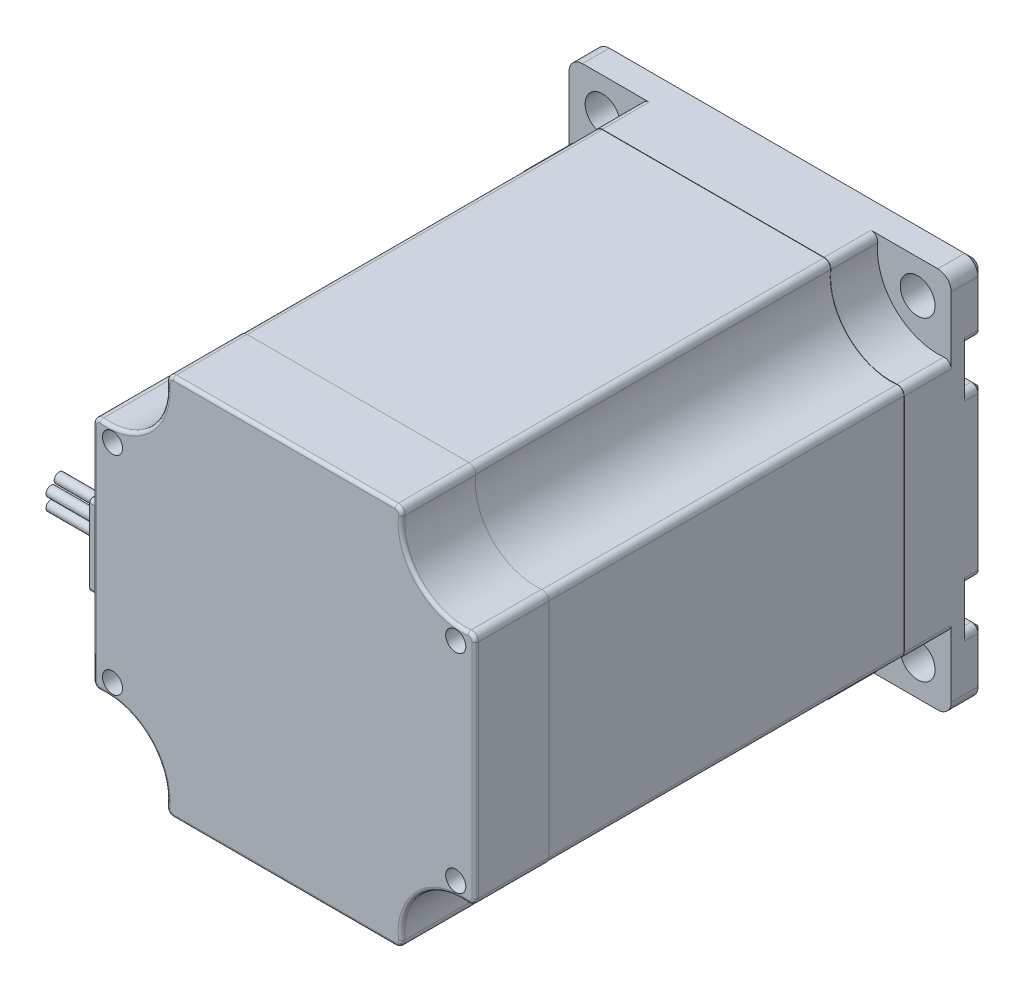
ISO-10303-21;
HEADER;
FILE_DESCRIPTION(('STEP AP214'),'2;1');
FILE_NAME('part.step','',(''),(''),'','','');
FILE_SCHEMA(('AUTOMOTIVE_DESIGN { 1 0 10303 214 1 1 1 1 }'));
ENDSEC;
DATA;
#1=APPLICATION_CONTEXT('core data for automotive mechanical design processes');
#2=APPLICATION_PROTOCOL_DEFINITION('international standard','automotive_design',2000,#1);
#3=PRODUCT_CONTEXT('',#1,'mechanical');
#4=PRODUCT('Part','Part','',(#3));
#5=PRODUCT_RELATED_PRODUCT_CATEGORY('part','',(#4));
#6=PRODUCT_DEFINITION_FORMATION('','',#4);
#7=PRODUCT_DEFINITION_CONTEXT('part definition',#1,'design');
#8=PRODUCT_DEFINITION('design','',#6,#7);
#9=PRODUCT_DEFINITION_SHAPE('','',#8);
#10=(LENGTH_UNIT() NAMED_UNIT(*) SI_UNIT(.MILLI.,.METRE.));
#11=(NAMED_UNIT(*) PLANE_ANGLE_UNIT() SI_UNIT($,.RADIAN.));
#12=(NAMED_UNIT(*) SI_UNIT($,.STERADIAN.) SOLID_ANGLE_UNIT());
#13=UNCERTAINTY_MEASURE_WITH_UNIT(LENGTH_MEASURE(1.E-05),#10,'distance_accuracy_value','');
#14=(GEOMETRIC_REPRESENTATION_CONTEXT(3) GLOBAL_UNCERTAINTY_ASSIGNED_CONTEXT((#13)) GLOBAL_UNIT_ASSIGNED_CONTEXT((#10,
#11,#12)) REPRESENTATION_CONTEXT('',''));
#15=CARTESIAN_POINT('',(0.,0.,0.));
#16=DIRECTION('',(0.,0.,1.));
#17=DIRECTION('',(1.,0.,0.));
#18=AXIS2_PLACEMENT_3D('',#15,#16,#17);
#19=CARTESIAN_POINT('',(0.,0.,12.3802561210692));
#20=DIRECTION('',(0.,0.,-1.));
#21=DIRECTION('',(-1.,0.,0.));
#22=AXIS2_PLACEMENT_3D('',#19,#20,#21);
#23=CYLINDRICAL_SURFACE('',#22,3.175);
#24=CARTESIAN_POINT('',(0.,0.,-0.610780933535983));
#25=DIRECTION('',(0.,0.,-1.));
#26=DIRECTION('',(-1.,0.,0.));
#27=AXIS2_PLACEMENT_3D('',#24,#25,#26);
#28=CIRCLE('',#27,3.175);
#29=CARTESIAN_POINT('',(-3.175,0.,-0.610780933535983));
#30=VERTEX_POINT('',#29);
#31=EDGE_CURVE('E1923',#30,#30,#28,.T.);
#32=ORIENTED_EDGE('',*,*,#31,.T.);
#33=EDGE_LOOP('',(#32));
#34=FACE_BOUND('',#33,.T.);
#35=DIRECTION('',(0.,0.,1.));
#36=VECTOR('',#35,1.);
#37=CARTESIAN_POINT('',(-2.31300670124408,2.175,-25.7328638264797));
#38=LINE('',#37,#36);
#39=CARTESIAN_POINT('',(-2.31300670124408,2.175,-20.5));
#40=VERTEX_POINT('',#39);
#41=CARTESIAN_POINT('',(-2.31300670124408,2.175,-6.));
#42=VERTEX_POINT('',#41);
#43=EDGE_CURVE('E727',#40,#42,#38,.T.);
#44=ORIENTED_EDGE('',*,*,#43,.F.);
#45=CARTESIAN_POINT('',(0.,0.,-20.5));
#46=DIRECTION('',(0.,0.,-1.));
#47=DIRECTION('',(-1.,0.,0.));
#48=AXIS2_PLACEMENT_3D('',#45,#46,#47);
#49=CIRCLE('',#48,3.175);
#50=CARTESIAN_POINT('',(2.31300670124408,2.175,-20.5));
#51=VERTEX_POINT('',#50);
#52=EDGE_CURVE('E4281',#40,#51,#49,.F.);
#53=ORIENTED_EDGE('',*,*,#52,.T.);
#54=DIRECTION('',(0.,0.,1.));
#55=VECTOR('',#54,1.);
#56=CARTESIAN_POINT('',(2.31300670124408,2.175,-25.7328638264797));
#57=LINE('',#56,#55);
#58=CARTESIAN_POINT('',(2.31300670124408,2.175,-6.));
#59=VERTEX_POINT('',#58);
#60=EDGE_CURVE('E745',#51,#59,#57,.T.);
#61=ORIENTED_EDGE('',*,*,#60,.T.);
#62=CARTESIAN_POINT('',(0.,0.,-6.));
#63=DIRECTION('',(0.,0.,-1.));
#64=DIRECTION('',(1.,0.,0.));
#65=AXIS2_PLACEMENT_3D('',#62,#63,#64);
#66=CIRCLE('',#65,3.175);
#67=EDGE_CURVE('E739',#42,#59,#66,.T.);
#68=ORIENTED_EDGE('',*,*,#67,.F.);
#69=EDGE_LOOP('',(#44,#53,#61,#68));
#70=FACE_BOUND('',#69,.T.);
#71=ADVANCED_FACE('F40',(#34,#70),#23,.T.);
#72=CARTESIAN_POINT('',(0.,0.,-21.));
#73=DIRECTION('',(0.,0.,-1.));
#74=DIRECTION('',(-1.,0.,0.));
#75=AXIS2_PLACEMENT_3D('',#72,#73,#74);
#76=PLANE('',#75);
#77=DIRECTION('',(-1.,0.,0.));
#78=VECTOR('',#77,1.);
#79=CARTESIAN_POINT('',(2.31300670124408,2.175,-21.));
#80=LINE('',#79,#78);
#81=CARTESIAN_POINT('',(1.89743148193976,2.175,-21.));
#82=VERTEX_POINT('',#81);
#83=CARTESIAN_POINT('',(-1.89743148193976,2.175,-21.));
#84=VERTEX_POINT('',#83);
#85=EDGE_CURVE('E744',#82,#84,#80,.T.);
#86=ORIENTED_EDGE('',*,*,#85,.F.);
#87=CARTESIAN_POINT('',(0.,0.,-21.));
#88=DIRECTION('',(0.,0.,-1.));
#89=DIRECTION('',(-1.,0.,0.));
#90=AXIS2_PLACEMENT_3D('',#87,#88,#89);
#91=CIRCLE('',#90,2.88632486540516);
#92=EDGE_CURVE('E1931',#82,#84,#91,.T.);
#93=ORIENTED_EDGE('',*,*,#92,.T.);
#94=EDGE_LOOP('',(#86,#93));
#95=FACE_BOUND('',#94,.T.);
#96=ADVANCED_FACE('F2024',(#95),#76,.T.);
#97=CARTESIAN_POINT('',(-26.5,-26.5,0.));
#98=DIRECTION('',(0.,0.,1.));
#99=DIRECTION('',(1.,0.,0.));
#100=AXIS2_PLACEMENT_3D('',#97,#98,#99);
#101=PLANE('',#100);
#102=CARTESIAN_POINT('',(0.,0.,0.));
#103=DIRECTION('',(0.,0.,1.));
#104=DIRECTION('',(1.,0.,0.));
#105=AXIS2_PLACEMENT_3D('',#102,#103,#104);
#106=CIRCLE('',#105,19.);
#107=CARTESIAN_POINT('',(19.,0.,0.));
#108=VERTEX_POINT('',#107);
#109=EDGE_CURVE('E1795',#108,#108,#106,.F.);
#110=ORIENTED_EDGE('',*,*,#109,.F.);
#111=EDGE_LOOP('',(#110));
#112=FACE_BOUND('',#111,.T.);
#113=DIRECTION('',(-1.,0.,0.));
#114=VECTOR('',#113,1.);
#115=CARTESIAN_POINT('',(-26.5,-11.4,0.));
#116=LINE('',#115,#114);
#117=CARTESIAN_POINT('',(-25.6,-11.4,0.));
#118=VERTEX_POINT('',#117);
#119=CARTESIAN_POINT('',(-27.5,-11.4,0.));
#120=VERTEX_POINT('',#119);
#121=EDGE_CURVE('E1701',#118,#120,#116,.T.);
#122=ORIENTED_EDGE('',*,*,#121,.T.);
#123=DIRECTION('',(0.,1.,0.));
#124=VECTOR('',#123,1.);
#125=CARTESIAN_POINT('',(-27.5,-26.5,0.));
#126=LINE('',#125,#124);
#127=CARTESIAN_POINT('',(-27.5,11.4,0.));
#128=VERTEX_POINT('',#127);
#129=EDGE_CURVE('E1704',#120,#128,#126,.T.);
#130=ORIENTED_EDGE('',*,*,#129,.T.);
#131=DIRECTION('',(1.,0.,0.));
#132=VECTOR('',#131,1.);
#133=CARTESIAN_POINT('',(-26.5,11.4,0.));
#134=LINE('',#133,#132);
#135=CARTESIAN_POINT('',(-25.6,11.4,0.));
#136=VERTEX_POINT('',#135);
#137=EDGE_CURVE('E1698',#128,#136,#134,.T.);
#138=ORIENTED_EDGE('',*,*,#137,.T.);
#139=CARTESIAN_POINT('',(-25.6,15.5,0.));
#140=DIRECTION('',(0.,0.,1.));
#141=DIRECTION('',(1.,0.,0.));
#142=AXIS2_PLACEMENT_3D('',#139,#140,#141);
#143=CIRCLE('',#142,4.09999999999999);
#144=CARTESIAN_POINT('',(-25.6,19.6,0.));
#145=VERTEX_POINT('',#144);
#146=EDGE_CURVE('E1692',#136,#145,#143,.T.);
#147=ORIENTED_EDGE('',*,*,#146,.T.);
#148=DIRECTION('',(-1.,0.,0.));
#149=VECTOR('',#148,1.);
#150=CARTESIAN_POINT('',(-26.5,19.6,0.));
#151=LINE('',#150,#149);
#152=CARTESIAN_POINT('',(-27.5,19.6,0.));
#153=VERTEX_POINT('',#152);
#154=EDGE_CURVE('E1686',#145,#153,#151,.T.);
#155=ORIENTED_EDGE('',*,*,#154,.T.);
#156=DIRECTION('',(0.,1.,0.));
#157=VECTOR('',#156,1.);
#158=CARTESIAN_POINT('',(-27.5,-26.5,0.));
#159=LINE('',#158,#157);
#160=CARTESIAN_POINT('',(-27.5,26.5,0.));
#161=VERTEX_POINT('',#160);
#162=EDGE_CURVE('E1680',#153,#161,#159,.T.);
#163=ORIENTED_EDGE('',*,*,#162,.T.);
#164=CARTESIAN_POINT('',(-26.5,26.5,0.));
#165=DIRECTION('',(0.,0.,1.));
#166=DIRECTION('',(1.,0.,0.));
#167=AXIS2_PLACEMENT_3D('',#164,#165,#166);
#168=CIRCLE('',#167,1.00000000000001);
#169=CARTESIAN_POINT('',(-26.5,27.5,0.));
#170=VERTEX_POINT('',#169);
#171=EDGE_CURVE('E1674',#161,#170,#168,.F.);
#172=ORIENTED_EDGE('',*,*,#171,.T.);
#173=DIRECTION('',(1.,0.,0.));
#174=VECTOR('',#173,1.);
#175=CARTESIAN_POINT('',(-26.5,27.5,0.));
#176=LINE('',#175,#174);
#177=CARTESIAN_POINT('',(26.5,27.5,0.));
#178=VERTEX_POINT('',#177);
#179=EDGE_CURVE('E1668',#170,#178,#176,.T.);
#180=ORIENTED_EDGE('',*,*,#179,.T.);
#181=CARTESIAN_POINT('',(26.5,26.5,0.));
#182=DIRECTION('',(0.,0.,1.));
#183=DIRECTION('',(1.,0.,0.));
#184=AXIS2_PLACEMENT_3D('',#181,#182,#183);
#185=CIRCLE('',#184,1.00000000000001);
#186=CARTESIAN_POINT('',(27.5,26.5,0.));
#187=VERTEX_POINT('',#186);
#188=EDGE_CURVE('E1662',#178,#187,#185,.F.);
#189=ORIENTED_EDGE('',*,*,#188,.T.);
#190=DIRECTION('',(0.,-1.,0.));
#191=VECTOR('',#190,1.);
#192=CARTESIAN_POINT('',(27.5,-26.5,0.));
#193=LINE('',#192,#191);
#194=CARTESIAN_POINT('',(27.5,19.6,0.));
#195=VERTEX_POINT('',#194);
#196=EDGE_CURVE('E1656',#187,#195,#193,.T.);
#197=ORIENTED_EDGE('',*,*,#196,.T.);
#198=DIRECTION('',(-1.,0.,0.));
#199=VECTOR('',#198,1.);
#200=CARTESIAN_POINT('',(25.6,19.6,0.));
#201=LINE('',#200,#199);
#202=CARTESIAN_POINT('',(25.6,19.6,0.));
#203=VERTEX_POINT('',#202);
#204=EDGE_CURVE('E1650',#195,#203,#201,.T.);
#205=ORIENTED_EDGE('',*,*,#204,.T.);
#206=CARTESIAN_POINT('',(25.6,15.5,0.));
#207=DIRECTION('',(0.,0.,1.));
#208=DIRECTION('',(1.,0.,0.));
#209=AXIS2_PLACEMENT_3D('',#206,#207,#208);
#210=CIRCLE('',#209,4.09999999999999);
#211=CARTESIAN_POINT('',(25.6,11.4,0.));
#212=VERTEX_POINT('',#211);
#213=EDGE_CURVE('E1644',#203,#212,#210,.T.);
#214=ORIENTED_EDGE('',*,*,#213,.T.);
#215=DIRECTION('',(1.,0.,0.));
#216=VECTOR('',#215,1.);
#217=CARTESIAN_POINT('',(27.5,11.4,0.));
#218=LINE('',#217,#216);
#219=CARTESIAN_POINT('',(27.5,11.4,0.));
#220=VERTEX_POINT('',#219);
#221=EDGE_CURVE('E1638',#212,#220,#218,.T.);
#222=ORIENTED_EDGE('',*,*,#221,.T.);
#223=DIRECTION('',(0.,-1.,0.));
#224=VECTOR('',#223,1.);
#225=CARTESIAN_POINT('',(27.5,-26.5,0.));
#226=LINE('',#225,#224);
#227=CARTESIAN_POINT('',(27.5,-11.4,0.));
#228=VERTEX_POINT('',#227);
#229=EDGE_CURVE('E1635',#220,#228,#226,.T.);
#230=ORIENTED_EDGE('',*,*,#229,.T.);
#231=DIRECTION('',(-1.,0.,0.));
#232=VECTOR('',#231,1.);
#233=CARTESIAN_POINT('',(-26.5,-11.4,0.));
#234=LINE('',#233,#232);
#235=CARTESIAN_POINT('',(25.6,-11.4,0.));
#236=VERTEX_POINT('',#235);
#237=EDGE_CURVE('E1641',#228,#236,#234,.T.);
#238=ORIENTED_EDGE('',*,*,#237,.T.);
#239=CARTESIAN_POINT('',(25.6,-15.5,0.));
#240=DIRECTION('',(0.,0.,1.));
#241=DIRECTION('',(1.,0.,0.));
#242=AXIS2_PLACEMENT_3D('',#239,#240,#241);
#243=CIRCLE('',#242,4.09999999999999);
#244=CARTESIAN_POINT('',(25.6,-19.6,0.));
#245=VERTEX_POINT('',#244);
#246=EDGE_CURVE('E1647',#236,#245,#243,.T.);
#247=ORIENTED_EDGE('',*,*,#246,.T.);
#248=DIRECTION('',(1.,0.,0.));
#249=VECTOR('',#248,1.);
#250=CARTESIAN_POINT('',(-26.5,-19.6,0.));
#251=LINE('',#250,#249);
#252=CARTESIAN_POINT('',(27.5,-19.6,0.));
#253=VERTEX_POINT('',#252);
#254=EDGE_CURVE('E1653',#245,#253,#251,.T.);
#255=ORIENTED_EDGE('',*,*,#254,.T.);
#256=DIRECTION('',(0.,-1.,0.));
#257=VECTOR('',#256,1.);
#258=CARTESIAN_POINT('',(27.5,-26.5,0.));
#259=LINE('',#258,#257);
#260=CARTESIAN_POINT('',(27.5,-26.5,0.));
#261=VERTEX_POINT('',#260);
#262=EDGE_CURVE('E1659',#253,#261,#259,.T.);
#263=ORIENTED_EDGE('',*,*,#262,.T.);
#264=CARTESIAN_POINT('',(26.5,-26.5,0.));
#265=DIRECTION('',(0.,0.,1.));
#266=DIRECTION('',(1.,0.,0.));
#267=AXIS2_PLACEMENT_3D('',#264,#265,#266);
#268=CIRCLE('',#267,1.00000000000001);
#269=CARTESIAN_POINT('',(26.5,-27.5,0.));
#270=VERTEX_POINT('',#269);
#271=EDGE_CURVE('E1665',#261,#270,#268,.F.);
#272=ORIENTED_EDGE('',*,*,#271,.T.);
#273=DIRECTION('',(-1.,0.,0.));
#274=VECTOR('',#273,1.);
#275=CARTESIAN_POINT('',(-26.5,-27.5,0.));
#276=LINE('',#275,#274);
#277=CARTESIAN_POINT('',(-26.5,-27.5,0.));
#278=VERTEX_POINT('',#277);
#279=EDGE_CURVE('E1671',#270,#278,#276,.T.);
#280=ORIENTED_EDGE('',*,*,#279,.T.);
#281=CARTESIAN_POINT('',(-26.5,-26.5,0.));
#282=DIRECTION('',(0.,0.,1.));
#283=DIRECTION('',(1.,0.,0.));
#284=AXIS2_PLACEMENT_3D('',#281,#282,#283);
#285=CIRCLE('',#284,1.00000000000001);
#286=CARTESIAN_POINT('',(-27.5,-26.5,0.));
#287=VERTEX_POINT('',#286);
#288=EDGE_CURVE('E1677',#278,#287,#285,.F.);
#289=ORIENTED_EDGE('',*,*,#288,.T.);
#290=DIRECTION('',(0.,1.,0.));
#291=VECTOR('',#290,1.);
#292=CARTESIAN_POINT('',(-27.5,-26.5,0.));
#293=LINE('',#292,#291);
#294=CARTESIAN_POINT('',(-27.5,-19.6,0.));
#295=VERTEX_POINT('',#294);
#296=EDGE_CURVE('E1683',#287,#295,#293,.T.);
#297=ORIENTED_EDGE('',*,*,#296,.T.);
#298=DIRECTION('',(1.,0.,0.));
#299=VECTOR('',#298,1.);
#300=CARTESIAN_POINT('',(-26.5,-19.6,0.));
#301=LINE('',#300,#299);
#302=CARTESIAN_POINT('',(-25.6,-19.6,0.));
#303=VERTEX_POINT('',#302);
#304=EDGE_CURVE('E1689',#295,#303,#301,.T.);
#305=ORIENTED_EDGE('',*,*,#304,.T.);
#306=CARTESIAN_POINT('',(-25.6,-15.5,0.));
#307=DIRECTION('',(0.,0.,1.));
#308=DIRECTION('',(1.,0.,0.));
#309=AXIS2_PLACEMENT_3D('',#306,#307,#308);
#310=CIRCLE('',#309,4.09999999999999);
#311=EDGE_CURVE('E1695',#303,#118,#310,.T.);
#312=ORIENTED_EDGE('',*,*,#311,.T.);
#313=EDGE_LOOP('',(#122,#130,#138,#147,#155,#163,#172,#180,#189,#197,#205,#214,#222,#230,#238,
#247,#255,#263,#272,#280,#289,#297,#305,#312));
#314=FACE_BOUND('',#313,.T.);
#315=CARTESIAN_POINT('',(-23.5,23.5,0.));
#316=DIRECTION('',(0.,0.,1.));
#317=DIRECTION('',(1.,0.,0.));
#318=AXIS2_PLACEMENT_3D('',#315,#316,#317);
#319=CIRCLE('',#318,2.6);
#320=CARTESIAN_POINT('',(-20.9,23.5,0.));
#321=VERTEX_POINT('',#320);
#322=EDGE_CURVE('E1365',#321,#321,#319,.T.);
#323=ORIENTED_EDGE('',*,*,#322,.T.);
#324=EDGE_LOOP('',(#323));
#325=FACE_BOUND('',#324,.T.);
#326=CARTESIAN_POINT('',(23.5,-23.5,0.));
#327=DIRECTION('',(0.,0.,1.));
#328=DIRECTION('',(1.,0.,0.));
#329=AXIS2_PLACEMENT_3D('',#326,#327,#328);
#330=CIRCLE('',#329,2.6);
#331=CARTESIAN_POINT('',(26.1,-23.5,0.));
#332=VERTEX_POINT('',#331);
#333=EDGE_CURVE('E1341',#332,#332,#330,.T.);
#334=ORIENTED_EDGE('',*,*,#333,.T.);
#335=EDGE_LOOP('',(#334));
#336=FACE_BOUND('',#335,.T.);
#337=CARTESIAN_POINT('',(-23.5,-23.5,0.));
#338=DIRECTION('',(0.,0.,1.));
#339=DIRECTION('',(1.,0.,0.));
#340=AXIS2_PLACEMENT_3D('',#337,#338,#339);
#341=CIRCLE('',#340,2.6);
#342=CARTESIAN_POINT('',(-20.9,-23.5,0.));
#343=VERTEX_POINT('',#342);
#344=EDGE_CURVE('E1358',#343,#343,#341,.T.);
#345=ORIENTED_EDGE('',*,*,#344,.T.);
#346=EDGE_LOOP('',(#345));
#347=FACE_BOUND('',#346,.T.);
#348=CARTESIAN_POINT('',(23.5,23.5,0.));
#349=DIRECTION('',(0.,0.,1.));
#350=DIRECTION('',(1.,0.,0.));
#351=AXIS2_PLACEMENT_3D('',#348,#349,#350);
#352=CIRCLE('',#351,2.6);
#353=CARTESIAN_POINT('',(26.1,23.5,0.));
#354=VERTEX_POINT('',#353);
#355=EDGE_CURVE('E1349',#354,#354,#352,.T.);
#356=ORIENTED_EDGE('',*,*,#355,.T.);
#357=EDGE_LOOP('',(#356));
#358=FACE_BOUND('',#357,.T.);
#359=ADVANCED_FACE('F2030',(#112,#314,#325,#336,#347,#358),#101,.F.);
#360=CARTESIAN_POINT('',(-28.5,26.5,76.));
#361=DIRECTION('',(1.,0.,0.));
#362=DIRECTION('',(0.,1.,0.));
#363=AXIS2_PLACEMENT_3D('',#360,#361,#362);
#364=PLANE('',#363);
#365=DIRECTION('',(0.,0.,-1.));
#366=VECTOR('',#365,1.);
#367=CARTESIAN_POINT('',(-28.5,11.4,76.));
#368=LINE('',#367,#366);
#369=CARTESIAN_POINT('',(-28.5,11.4,3.));
#370=VERTEX_POINT('',#369);
#371=CARTESIAN_POINT('',(-28.5,11.4,0.999999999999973));
#372=VERTEX_POINT('',#371);
#373=EDGE_CURVE('E856',#370,#372,#368,.T.);
#374=ORIENTED_EDGE('',*,*,#373,.T.);
#375=DIRECTION('',(0.,-1.,0.));
#376=VECTOR('',#375,1.);
#377=CARTESIAN_POINT('',(-28.5,26.5,0.999999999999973));
#378=LINE('',#377,#376);
#379=CARTESIAN_POINT('',(-28.5,-11.4,0.999999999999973));
#380=VERTEX_POINT('',#379);
#381=EDGE_CURVE('E1631',#372,#380,#378,.T.);
#382=ORIENTED_EDGE('',*,*,#381,.T.);
#383=DIRECTION('',(0.,0.,-1.));
#384=VECTOR('',#383,1.);
#385=CARTESIAN_POINT('',(-28.5,-11.4,76.));
#386=LINE('',#385,#384);
#387=CARTESIAN_POINT('',(-28.5,-11.4,3.));
#388=VERTEX_POINT('',#387);
#389=EDGE_CURVE('E809',#388,#380,#386,.T.);
#390=ORIENTED_EDGE('',*,*,#389,.F.);
#391=DIRECTION('',(0.,-1.,0.));
#392=VECTOR('',#391,1.);
#393=CARTESIAN_POINT('',(-28.5,26.5,3.));
#394=LINE('',#393,#392);
#395=CARTESIAN_POINT('',(-28.5,-19.6,3.));
#396=VERTEX_POINT('',#395);
#397=EDGE_CURVE('E844',#388,#396,#394,.T.);
#398=ORIENTED_EDGE('',*,*,#397,.T.);
#399=DIRECTION('',(0.,0.,-1.));
#400=VECTOR('',#399,1.);
#401=CARTESIAN_POINT('',(-28.5,-19.6,76.));
#402=LINE('',#401,#400);
#403=CARTESIAN_POINT('',(-28.5,-19.6,0.999999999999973));
#404=VERTEX_POINT('',#403);
#405=EDGE_CURVE('E841',#404,#396,#402,.F.);
#406=ORIENTED_EDGE('',*,*,#405,.F.);
#407=DIRECTION('',(0.,-1.,0.));
#408=VECTOR('',#407,1.);
#409=CARTESIAN_POINT('',(-28.5,26.5,0.999999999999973));
#410=LINE('',#409,#408);
#411=CARTESIAN_POINT('',(-28.5,-26.5,0.999999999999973));
#412=VERTEX_POINT('',#411);
#413=EDGE_CURVE('E1628',#404,#412,#410,.T.);
#414=ORIENTED_EDGE('',*,*,#413,.T.);
#415=DIRECTION('',(0.,0.,-1.));
#416=VECTOR('',#415,1.);
#417=CARTESIAN_POINT('',(-28.5,-26.5,76.));
#418=LINE('',#417,#416);
#419=CARTESIAN_POINT('',(-28.5,-26.5,5.));
#420=VERTEX_POINT('',#419);
#421=EDGE_CURVE('E1524',#420,#412,#418,.T.);
#422=ORIENTED_EDGE('',*,*,#421,.F.);
#423=DIRECTION('',(0.,-1.,0.));
#424=VECTOR('',#423,1.);
#425=CARTESIAN_POINT('',(-28.5,26.5,5.));
#426=LINE('',#425,#424);
#427=CARTESIAN_POINT('',(-28.4999999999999,-16.5501256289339,5.));
#428=VERTEX_POINT('',#427);
#429=EDGE_CURVE('E1559',#428,#420,#426,.T.);
#430=ORIENTED_EDGE('',*,*,#429,.F.);
#431=DIRECTION('',(0.,0.,1.));
#432=VECTOR('',#431,1.);
#433=CARTESIAN_POINT('',(-28.4999999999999,-16.5501256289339,5.));
#434=LINE('',#433,#432);
#435=CARTESIAN_POINT('',(-28.4999999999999,-16.5501256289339,12.));
#436=VERTEX_POINT('',#435);
#437=EDGE_CURVE('E1393',#428,#436,#434,.T.);
#438=ORIENTED_EDGE('',*,*,#437,.T.);
#439=DIRECTION('',(0.,-1.,0.));
#440=VECTOR('',#439,1.);
#441=CARTESIAN_POINT('',(-28.5,26.5,12.));
#442=LINE('',#441,#440);
#443=CARTESIAN_POINT('',(-28.5,16.5501256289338,12.));
#444=VERTEX_POINT('',#443);
#445=EDGE_CURVE('E1301',#444,#436,#442,.T.);
#446=ORIENTED_EDGE('',*,*,#445,.F.);
#447=DIRECTION('',(0.,0.,1.));
#448=VECTOR('',#447,1.);
#449=CARTESIAN_POINT('',(-28.5,16.5501256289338,5.));
#450=LINE('',#449,#448);
#451=CARTESIAN_POINT('',(-28.5,16.5501256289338,5.));
#452=VERTEX_POINT('',#451);
#453=EDGE_CURVE('E1499',#452,#444,#450,.T.);
#454=ORIENTED_EDGE('',*,*,#453,.F.);
#455=DIRECTION('',(0.,-1.,0.));
#456=VECTOR('',#455,1.);
#457=CARTESIAN_POINT('',(-28.5,26.5,5.));
#458=LINE('',#457,#456);
#459=CARTESIAN_POINT('',(-28.5,26.5,5.));
#460=VERTEX_POINT('',#459);
#461=EDGE_CURVE('E1556',#460,#452,#458,.T.);
#462=ORIENTED_EDGE('',*,*,#461,.F.);
#463=DIRECTION('',(0.,0.,-1.));
#464=VECTOR('',#463,1.);
#465=CARTESIAN_POINT('',(-28.5,26.5,76.));
#466=LINE('',#465,#464);
#467=CARTESIAN_POINT('',(-28.5,26.5,0.999999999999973));
#468=VERTEX_POINT('',#467);
#469=EDGE_CURVE('E1528',#460,#468,#466,.T.);
#470=ORIENTED_EDGE('',*,*,#469,.T.);
#471=DIRECTION('',(0.,-1.,0.));
#472=VECTOR('',#471,1.);
#473=CARTESIAN_POINT('',(-28.5,26.5,0.999999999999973));
#474=LINE('',#473,#472);
#475=CARTESIAN_POINT('',(-28.5,19.6,0.999999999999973));
#476=VERTEX_POINT('',#475);
#477=EDGE_CURVE('E1625',#468,#476,#474,.T.);
#478=ORIENTED_EDGE('',*,*,#477,.T.);
#479=DIRECTION('',(0.,0.,-1.));
#480=VECTOR('',#479,1.);
#481=CARTESIAN_POINT('',(-28.5,19.6,76.));
#482=LINE('',#481,#480);
#483=CARTESIAN_POINT('',(-28.5,19.6,3.));
#484=VERTEX_POINT('',#483);
#485=EDGE_CURVE('E888',#476,#484,#482,.F.);
#486=ORIENTED_EDGE('',*,*,#485,.T.);
#487=DIRECTION('',(0.,1.,0.));
#488=VECTOR('',#487,1.);
#489=CARTESIAN_POINT('',(-28.5,-26.5,3.));
#490=LINE('',#489,#488);
#491=EDGE_CURVE('E806',#370,#484,#490,.T.);
#492=ORIENTED_EDGE('',*,*,#491,.F.);
#493=EDGE_LOOP('',(#374,#382,#390,#398,#406,#414,#422,#430,#438,#446,#454,#462,#470,#478,#486,#492));
#494=FACE_BOUND('',#493,.T.);
#495=ADVANCED_FACE('F2400',(#494),#364,.F.);
#496=CARTESIAN_POINT('',(28.5,26.5,76.));
#497=DIRECTION('',(-1.,0.,0.));
#498=DIRECTION('',(0.,-1.,0.));
#499=AXIS2_PLACEMENT_3D('',#496,#497,#498);
#500=PLANE('',#499);
#501=DIRECTION('',(0.,0.,-1.));
#502=VECTOR('',#501,1.);
#503=CARTESIAN_POINT('',(28.5,-26.5,76.));
#504=LINE('',#503,#502);
#505=CARTESIAN_POINT('',(28.5,-26.5,5.));
#506=VERTEX_POINT('',#505);
#507=CARTESIAN_POINT('',(28.5,-26.5,0.999999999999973));
#508=VERTEX_POINT('',#507);
#509=EDGE_CURVE('E1544',#506,#508,#504,.T.);
#510=ORIENTED_EDGE('',*,*,#509,.T.);
#511=DIRECTION('',(0.,1.,0.));
#512=VECTOR('',#511,1.);
#513=CARTESIAN_POINT('',(28.5,26.5,0.999999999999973));
#514=LINE('',#513,#512);
#515=CARTESIAN_POINT('',(28.5,-19.6,0.999999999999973));
#516=VERTEX_POINT('',#515);
#517=EDGE_CURVE('E1762',#508,#516,#514,.T.);
#518=ORIENTED_EDGE('',*,*,#517,.T.);
#519=DIRECTION('',(0.,0.,-1.));
#520=VECTOR('',#519,1.);
#521=CARTESIAN_POINT('',(28.5,-19.6,76.));
#522=LINE('',#521,#520);
#523=CARTESIAN_POINT('',(28.5,-19.6,3.));
#524=VERTEX_POINT('',#523);
#525=EDGE_CURVE('E1587',#516,#524,#522,.F.);
#526=ORIENTED_EDGE('',*,*,#525,.T.);
#527=DIRECTION('',(0.,-1.,0.));
#528=VECTOR('',#527,1.);
#529=CARTESIAN_POINT('',(28.5,26.5,3.));
#530=LINE('',#529,#528);
#531=CARTESIAN_POINT('',(28.5,-11.4,3.));
#532=VERTEX_POINT('',#531);
#533=EDGE_CURVE('E1575',#532,#524,#530,.T.);
#534=ORIENTED_EDGE('',*,*,#533,.F.);
#535=DIRECTION('',(0.,0.,-1.));
#536=VECTOR('',#535,1.);
#537=CARTESIAN_POINT('',(28.5,-11.4,76.));
#538=LINE('',#537,#536);
#539=CARTESIAN_POINT('',(28.5,-11.4,0.999999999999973));
#540=VERTEX_POINT('',#539);
#541=EDGE_CURVE('E1583',#532,#540,#538,.T.);
#542=ORIENTED_EDGE('',*,*,#541,.T.);
#543=DIRECTION('',(0.,1.,0.));
#544=VECTOR('',#543,1.);
#545=CARTESIAN_POINT('',(28.5,26.5,0.999999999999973));
#546=LINE('',#545,#544);
#547=CARTESIAN_POINT('',(28.5,11.4,0.999999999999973));
#548=VERTEX_POINT('',#547);
#549=EDGE_CURVE('E1756',#540,#548,#546,.T.);
#550=ORIENTED_EDGE('',*,*,#549,.T.);
#551=DIRECTION('',(0.,0.,-1.));
#552=VECTOR('',#551,1.);
#553=CARTESIAN_POINT('',(28.5,11.4,3.));
#554=LINE('',#553,#552);
#555=CARTESIAN_POINT('',(28.5,11.4,3.));
#556=VERTEX_POINT('',#555);
#557=EDGE_CURVE('E1604',#548,#556,#554,.F.);
#558=ORIENTED_EDGE('',*,*,#557,.T.);
#559=DIRECTION('',(0.,-1.,0.));
#560=VECTOR('',#559,1.);
#561=CARTESIAN_POINT('',(28.5,26.5,3.));
#562=LINE('',#561,#560);
#563=CARTESIAN_POINT('',(28.5,19.6,3.));
#564=VERTEX_POINT('',#563);
#565=EDGE_CURVE('E1600',#564,#556,#562,.T.);
#566=ORIENTED_EDGE('',*,*,#565,.F.);
#567=DIRECTION('',(0.,0.,-1.));
#568=VECTOR('',#567,1.);
#569=CARTESIAN_POINT('',(28.5,19.6,0.));
#570=LINE('',#569,#568);
#571=CARTESIAN_POINT('',(28.5,19.6,0.999999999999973));
#572=VERTEX_POINT('',#571);
#573=EDGE_CURVE('E1607',#564,#572,#570,.T.);
#574=ORIENTED_EDGE('',*,*,#573,.T.);
#575=DIRECTION('',(0.,1.,0.));
#576=VECTOR('',#575,1.);
#577=CARTESIAN_POINT('',(28.5,26.5,0.999999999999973));
#578=LINE('',#577,#576);
#579=CARTESIAN_POINT('',(28.5,26.5,0.999999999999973));
#580=VERTEX_POINT('',#579);
#581=EDGE_CURVE('E1759',#572,#580,#578,.T.);
#582=ORIENTED_EDGE('',*,*,#581,.T.);
#583=DIRECTION('',(0.,0.,-1.));
#584=VECTOR('',#583,1.);
#585=CARTESIAN_POINT('',(28.5,26.5,76.));
#586=LINE('',#585,#584);
#587=CARTESIAN_POINT('',(28.5,26.5,5.));
#588=VERTEX_POINT('',#587);
#589=EDGE_CURVE('E1540',#588,#580,#586,.T.);
#590=ORIENTED_EDGE('',*,*,#589,.F.);
#591=DIRECTION('',(0.,1.,0.));
#592=VECTOR('',#591,1.);
#593=CARTESIAN_POINT('',(28.5,26.5,5.));
#594=LINE('',#593,#592);
#595=CARTESIAN_POINT('',(28.4999999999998,16.5501256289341,5.));
#596=VERTEX_POINT('',#595);
#597=EDGE_CURVE('E1477',#596,#588,#594,.T.);
#598=ORIENTED_EDGE('',*,*,#597,.F.);
#599=DIRECTION('',(0.,0.,1.));
#600=VECTOR('',#599,1.);
#601=CARTESIAN_POINT('',(28.4999999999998,16.5501256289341,5.));
#602=LINE('',#601,#600);
#603=CARTESIAN_POINT('',(28.5,16.5501256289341,12.));
#604=VERTEX_POINT('',#603);
#605=EDGE_CURVE('E1455',#596,#604,#602,.T.);
#606=ORIENTED_EDGE('',*,*,#605,.T.);
#607=DIRECTION('',(0.,1.,0.));
#608=VECTOR('',#607,1.);
#609=CARTESIAN_POINT('',(28.5,26.5,12.));
#610=LINE('',#609,#608);
#611=CARTESIAN_POINT('',(28.5,-16.5501256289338,12.));
#612=VERTEX_POINT('',#611);
#613=EDGE_CURVE('E1328',#612,#604,#610,.T.);
#614=ORIENTED_EDGE('',*,*,#613,.F.);
#615=DIRECTION('',(0.,0.,1.));
#616=VECTOR('',#615,1.);
#617=CARTESIAN_POINT('',(28.5,-16.5501256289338,5.));
#618=LINE('',#617,#616);
#619=CARTESIAN_POINT('',(28.5,-16.5501256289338,5.));
#620=VERTEX_POINT('',#619);
#621=EDGE_CURVE('E1378',#620,#612,#618,.T.);
#622=ORIENTED_EDGE('',*,*,#621,.F.);
#623=DIRECTION('',(0.,1.,0.));
#624=VECTOR('',#623,1.);
#625=CARTESIAN_POINT('',(28.5,26.5,5.));
#626=LINE('',#625,#624);
#627=EDGE_CURVE('E1565',#506,#620,#626,.T.);
#628=ORIENTED_EDGE('',*,*,#627,.F.);
#629=EDGE_LOOP('',(#510,#518,#526,#534,#542,#550,#558,#566,#574,#582,#590,#598,#606,#614,#622,#628));
#630=FACE_BOUND('',#629,.T.);
#631=ADVANCED_FACE('F2420',(#630),#500,.F.);
#632=CARTESIAN_POINT('',(-26.5,-28.5,76.));
#633=DIRECTION('',(0.,1.,0.));
#634=DIRECTION('',(0.,0.,1.));
#635=AXIS2_PLACEMENT_3D('',#632,#633,#634);
#636=PLANE('',#635);
#637=DIRECTION('',(0.,0.,-1.));
#638=VECTOR('',#637,1.);
#639=CARTESIAN_POINT('',(-26.5,-28.5,76.));
#640=LINE('',#639,#638);
#641=CARTESIAN_POINT('',(-26.5,-28.5,5.));
#642=VERTEX_POINT('',#641);
#643=CARTESIAN_POINT('',(-26.5,-28.5,0.999999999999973));
#644=VERTEX_POINT('',#643);
#645=EDGE_CURVE('E1552',#642,#644,#640,.T.);
#646=ORIENTED_EDGE('',*,*,#645,.T.);
#647=DIRECTION('',(1.,0.,0.));
#648=VECTOR('',#647,1.);
#649=CARTESIAN_POINT('',(-26.5,-28.5,0.999999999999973));
#650=LINE('',#649,#648);
#651=CARTESIAN_POINT('',(26.5,-28.5,0.999999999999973));
#652=VERTEX_POINT('',#651);
#653=EDGE_CURVE('E1744',#644,#652,#650,.T.);
#654=ORIENTED_EDGE('',*,*,#653,.T.);
#655=DIRECTION('',(0.,0.,-1.));
#656=VECTOR('',#655,1.);
#657=CARTESIAN_POINT('',(26.5,-28.5,76.));
#658=LINE('',#657,#656);
#659=CARTESIAN_POINT('',(26.5,-28.5,5.));
#660=VERTEX_POINT('',#659);
#661=EDGE_CURVE('E1548',#660,#652,#658,.T.);
#662=ORIENTED_EDGE('',*,*,#661,.F.);
#663=DIRECTION('',(1.,0.,0.));
#664=VECTOR('',#663,1.);
#665=CARTESIAN_POINT('',(-26.5,-28.5,5.));
#666=LINE('',#665,#664);
#667=CARTESIAN_POINT('',(16.5501256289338,-28.5,5.));
#668=VERTEX_POINT('',#667);
#669=EDGE_CURVE('E1483',#668,#660,#666,.T.);
#670=ORIENTED_EDGE('',*,*,#669,.F.);
#671=DIRECTION('',(0.,0.,1.));
#672=VECTOR('',#671,1.);
#673=CARTESIAN_POINT('',(16.5501256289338,-28.5,5.));
#674=LINE('',#673,#672);
#675=CARTESIAN_POINT('',(16.5501256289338,-28.5,12.));
#676=VERTEX_POINT('',#675);
#677=EDGE_CURVE('E1425',#668,#676,#674,.T.);
#678=ORIENTED_EDGE('',*,*,#677,.T.);
#679=DIRECTION('',(1.,0.,0.));
#680=VECTOR('',#679,1.);
#681=CARTESIAN_POINT('',(-26.5,-28.5,12.));
#682=LINE('',#681,#680);
#683=CARTESIAN_POINT('',(-16.5501256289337,-28.5000000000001,12.));
#684=VERTEX_POINT('',#683);
#685=EDGE_CURVE('E1304',#684,#676,#682,.T.);
#686=ORIENTED_EDGE('',*,*,#685,.F.);
#687=DIRECTION('',(0.,0.,1.));
#688=VECTOR('',#687,1.);
#689=CARTESIAN_POINT('',(-16.5501256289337,-28.5000000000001,5.));
#690=LINE('',#689,#688);
#691=CARTESIAN_POINT('',(-16.5501256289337,-28.5000000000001,5.));
#692=VERTEX_POINT('',#691);
#693=EDGE_CURVE('E1387',#692,#684,#690,.T.);
#694=ORIENTED_EDGE('',*,*,#693,.F.);
#695=DIRECTION('',(1.,0.,0.));
#696=VECTOR('',#695,1.);
#697=CARTESIAN_POINT('',(-26.5,-28.5,5.));
#698=LINE('',#697,#696);
#699=EDGE_CURVE('E1471',#642,#692,#698,.T.);
#700=ORIENTED_EDGE('',*,*,#699,.F.);
#701=EDGE_LOOP('',(#646,#654,#662,#670,#678,#686,#694,#700));
#702=FACE_BOUND('',#701,.T.);
#703=ADVANCED_FACE('F2428',(#702),#636,.F.);
#704=CARTESIAN_POINT('',(-26.5,28.5,76.));
#705=DIRECTION('',(0.,-1.,0.));
#706=DIRECTION('',(0.,0.,-1.));
#707=AXIS2_PLACEMENT_3D('',#704,#705,#706);
#708=PLANE('',#707);
#709=DIRECTION('',(0.,0.,-1.));
#710=VECTOR('',#709,1.);
#711=CARTESIAN_POINT('',(26.5,28.5,76.));
#712=LINE('',#711,#710);
#713=CARTESIAN_POINT('',(26.5,28.5,5.));
#714=VERTEX_POINT('',#713);
#715=CARTESIAN_POINT('',(26.5,28.5,0.999999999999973));
#716=VERTEX_POINT('',#715);
#717=EDGE_CURVE('E1536',#714,#716,#712,.T.);
#718=ORIENTED_EDGE('',*,*,#717,.T.);
#719=DIRECTION('',(-1.,0.,0.));
#720=VECTOR('',#719,1.);
#721=CARTESIAN_POINT('',(-26.5,28.5,0.999999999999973));
#722=LINE('',#721,#720);
#723=CARTESIAN_POINT('',(-26.5,28.5,0.999999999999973));
#724=VERTEX_POINT('',#723);
#725=EDGE_CURVE('E1747',#716,#724,#722,.T.);
#726=ORIENTED_EDGE('',*,*,#725,.T.);
#727=DIRECTION('',(0.,0.,-1.));
#728=VECTOR('',#727,1.);
#729=CARTESIAN_POINT('',(-26.5,28.5,76.));
#730=LINE('',#729,#728);
#731=CARTESIAN_POINT('',(-26.5,28.5,5.));
#732=VERTEX_POINT('',#731);
#733=EDGE_CURVE('E1532',#732,#724,#730,.T.);
#734=ORIENTED_EDGE('',*,*,#733,.F.);
#735=DIRECTION('',(-1.,0.,0.));
#736=VECTOR('',#735,1.);
#737=CARTESIAN_POINT('',(-26.5,28.5,5.));
#738=LINE('',#737,#736);
#739=CARTESIAN_POINT('',(-16.5501256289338,28.5,5.));
#740=VERTEX_POINT('',#739);
#741=EDGE_CURVE('E1521',#740,#732,#738,.T.);
#742=ORIENTED_EDGE('',*,*,#741,.F.);
#743=DIRECTION('',(0.,0.,1.));
#744=VECTOR('',#743,1.);
#745=CARTESIAN_POINT('',(-16.5501256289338,28.5,5.));
#746=LINE('',#745,#744);
#747=CARTESIAN_POINT('',(-16.5501256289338,28.5,12.));
#748=VERTEX_POINT('',#747);
#749=EDGE_CURVE('E1505',#740,#748,#746,.T.);
#750=ORIENTED_EDGE('',*,*,#749,.T.);
#751=DIRECTION('',(-1.,0.,0.));
#752=VECTOR('',#751,1.);
#753=CARTESIAN_POINT('',(-26.5,28.5,12.));
#754=LINE('',#753,#752);
#755=CARTESIAN_POINT('',(16.5501256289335,28.5,12.));
#756=VERTEX_POINT('',#755);
#757=EDGE_CURVE('E1325',#756,#748,#754,.T.);
#758=ORIENTED_EDGE('',*,*,#757,.F.);
#759=DIRECTION('',(0.,0.,1.));
#760=VECTOR('',#759,1.);
#761=CARTESIAN_POINT('',(16.5501256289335,28.5000000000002,5.));
#762=LINE('',#761,#760);
#763=CARTESIAN_POINT('',(16.5501256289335,28.5000000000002,5.));
#764=VERTEX_POINT('',#763);
#765=EDGE_CURVE('E1412',#764,#756,#762,.T.);
#766=ORIENTED_EDGE('',*,*,#765,.F.);
#767=DIRECTION('',(-1.,0.,0.));
#768=VECTOR('',#767,1.);
#769=CARTESIAN_POINT('',(-26.5,28.5,5.));
#770=LINE('',#769,#768);
#771=EDGE_CURVE('E1562',#714,#764,#770,.T.);
#772=ORIENTED_EDGE('',*,*,#771,.F.);
#773=EDGE_LOOP('',(#718,#726,#734,#742,#750,#758,#766,#772));
#774=FACE_BOUND('',#773,.T.);
#775=ADVANCED_FACE('F2412',(#774),#708,.F.);
#776=CARTESIAN_POINT('',(-27.5,16.5501256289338,5.));
#777=DIRECTION('',(0.,0.,1.));
#778=DIRECTION('',(1.,0.,0.));
#779=AXIS2_PLACEMENT_3D('',#776,#777,#778);
#780=CYLINDRICAL_SURFACE('',#779,1.);
#781=CARTESIAN_POINT('',(-27.5,16.5501256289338,12.));
#782=DIRECTION('',(0.,0.,1.));
#783=DIRECTION('',(1.,0.,0.));
#784=AXIS2_PLACEMENT_3D('',#781,#782,#783);
#785=CIRCLE('',#784,1.);
#786=CARTESIAN_POINT('',(-27.4,17.5451130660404,12.));
#787=VERTEX_POINT('',#786);
#788=EDGE_CURVE('E1310',#787,#444,#785,.T.);
#789=ORIENTED_EDGE('',*,*,#788,.F.);
#790=DIRECTION('',(0.,0.,1.));
#791=VECTOR('',#790,1.);
#792=CARTESIAN_POINT('',(-27.4,17.5451130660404,5.));
#793=LINE('',#792,#791);
#794=CARTESIAN_POINT('',(-27.4,17.5451130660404,5.));
#795=VERTEX_POINT('',#794);
#796=EDGE_CURVE('E1515',#795,#787,#793,.T.);
#797=ORIENTED_EDGE('',*,*,#796,.F.);
#798=CARTESIAN_POINT('',(-27.5,16.5501256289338,5.));
#799=DIRECTION('',(0.,0.,-1.));
#800=DIRECTION('',(1.,0.,0.));
#801=AXIS2_PLACEMENT_3D('',#798,#799,#800);
#802=CIRCLE('',#801,1.);
#803=EDGE_CURVE('E1486',#452,#795,#802,.T.);
#804=ORIENTED_EDGE('',*,*,#803,.F.);
#805=ORIENTED_EDGE('',*,*,#453,.T.);
#806=EDGE_LOOP('',(#789,#797,#804,#805));
#807=FACE_BOUND('',#806,.T.);
#808=ADVANCED_FACE('F2394',(#807),#780,.T.);
#809=CARTESIAN_POINT('',(-16.5501256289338,27.5,5.));
#810=DIRECTION('',(0.,0.,1.));
#811=DIRECTION('',(1.,0.,0.));
#812=AXIS2_PLACEMENT_3D('',#809,#810,#811);
#813=CYLINDRICAL_SURFACE('',#812,0.999999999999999);
#814=CARTESIAN_POINT('',(-16.5501256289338,27.5,12.));
#815=DIRECTION('',(0.,0.,1.));
#816=DIRECTION('',(1.,0.,0.));
#817=AXIS2_PLACEMENT_3D('',#814,#815,#816);
#818=CIRCLE('',#817,0.999999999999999);
#819=CARTESIAN_POINT('',(-17.5451130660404,27.4,12.));
#820=VERTEX_POINT('',#819);
#821=EDGE_CURVE('E1322',#748,#820,#818,.T.);
#822=ORIENTED_EDGE('',*,*,#821,.F.);
#823=ORIENTED_EDGE('',*,*,#749,.F.);
#824=CARTESIAN_POINT('',(-16.5501256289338,27.5,5.));
#825=DIRECTION('',(0.,0.,-1.));
#826=DIRECTION('',(-1.,0.,0.));
#827=AXIS2_PLACEMENT_3D('',#824,#825,#826);
#828=CIRCLE('',#827,0.999999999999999);
#829=CARTESIAN_POINT('',(-17.5451130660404,27.4,5.));
#830=VERTEX_POINT('',#829);
#831=EDGE_CURVE('E1494',#830,#740,#828,.T.);
#832=ORIENTED_EDGE('',*,*,#831,.F.);
#833=DIRECTION('',(0.,0.,1.));
#834=VECTOR('',#833,1.);
#835=CARTESIAN_POINT('',(-17.5451130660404,27.4,5.));
#836=LINE('',#835,#834);
#837=EDGE_CURVE('E1510',#830,#820,#836,.T.);
#838=ORIENTED_EDGE('',*,*,#837,.T.);
#839=EDGE_LOOP('',(#822,#823,#832,#838));
#840=FACE_BOUND('',#839,.T.);
#841=ADVANCED_FACE('F2387',(#840),#813,.T.);
#842=CARTESIAN_POINT('',(-26.5,26.5,5.));
#843=DIRECTION('',(0.,0.,1.));
#844=DIRECTION('',(1.,0.,0.));
#845=AXIS2_PLACEMENT_3D('',#842,#843,#844);
#846=CYLINDRICAL_SURFACE('',#845,9.);
#847=CARTESIAN_POINT('',(-26.5,26.5,12.));
#848=DIRECTION('',(0.,0.,1.));
#849=DIRECTION('',(1.,0.,0.));
#850=AXIS2_PLACEMENT_3D('',#847,#848,#849);
#851=CIRCLE('',#850,9.);
#852=EDGE_CURVE('E1319',#820,#787,#851,.F.);
#853=ORIENTED_EDGE('',*,*,#852,.F.);
#854=ORIENTED_EDGE('',*,*,#837,.F.);
#855=CARTESIAN_POINT('',(-26.5,26.5,5.));
#856=DIRECTION('',(0.,0.,1.));
#857=DIRECTION('',(-1.,0.,0.));
#858=AXIS2_PLACEMENT_3D('',#855,#856,#857);
#859=CIRCLE('',#858,9.);
#860=EDGE_CURVE('E1490',#795,#830,#859,.T.);
#861=ORIENTED_EDGE('',*,*,#860,.F.);
#862=ORIENTED_EDGE('',*,*,#796,.T.);
#863=EDGE_LOOP('',(#853,#854,#861,#862));
#864=FACE_BOUND('',#863,.T.);
#865=ADVANCED_FACE('F2390',(#864),#846,.F.);
#866=CARTESIAN_POINT('',(16.5501256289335,27.5000000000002,5.));
#867=DIRECTION('',(0.,0.,1.));
#868=DIRECTION('',(1.,0.,0.));
#869=AXIS2_PLACEMENT_3D('',#866,#867,#868);
#870=CYLINDRICAL_SURFACE('',#869,1.);
#871=CARTESIAN_POINT('',(16.5501256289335,27.5000000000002,12.));
#872=DIRECTION('',(0.,0.,1.));
#873=DIRECTION('',(1.,0.,0.));
#874=AXIS2_PLACEMENT_3D('',#871,#872,#873);
#875=CIRCLE('',#874,1.);
#876=CARTESIAN_POINT('',(17.5451130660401,27.4000000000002,12.));
#877=VERTEX_POINT('',#876);
#878=EDGE_CURVE('E1334',#877,#756,#875,.T.);
#879=ORIENTED_EDGE('',*,*,#878,.F.);
#880=DIRECTION('',(0.,0.,1.));
#881=VECTOR('',#880,1.);
#882=CARTESIAN_POINT('',(17.5451130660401,27.4000000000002,5.));
#883=LINE('',#882,#881);
#884=CARTESIAN_POINT('',(17.5451130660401,27.4000000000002,5.));
#885=VERTEX_POINT('',#884);
#886=EDGE_CURVE('E1465',#885,#877,#883,.T.);
#887=ORIENTED_EDGE('',*,*,#886,.F.);
#888=CARTESIAN_POINT('',(16.5501256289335,27.5000000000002,5.));
#889=DIRECTION('',(0.,0.,-1.));
#890=DIRECTION('',(0.,-1.,0.));
#891=AXIS2_PLACEMENT_3D('',#888,#889,#890);
#892=CIRCLE('',#891,1.);
#893=EDGE_CURVE('E1369',#764,#885,#892,.T.);
#894=ORIENTED_EDGE('',*,*,#893,.F.);
#895=ORIENTED_EDGE('',*,*,#765,.T.);
#896=EDGE_LOOP('',(#879,#887,#894,#895));
#897=FACE_BOUND('',#896,.T.);
#898=ADVANCED_FACE('F2378',(#897),#870,.T.);
#899=CARTESIAN_POINT('',(27.4999999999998,16.5501256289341,5.));
#900=DIRECTION('',(0.,0.,1.));
#901=DIRECTION('',(1.,0.,0.));
#902=AXIS2_PLACEMENT_3D('',#899,#900,#901);
#903=CYLINDRICAL_SURFACE('',#902,0.999999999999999);
#904=CARTESIAN_POINT('',(27.4999999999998,16.5501256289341,12.));
#905=DIRECTION('',(0.,0.,1.));
#906=DIRECTION('',(1.,0.,0.));
#907=AXIS2_PLACEMENT_3D('',#904,#905,#906);
#908=CIRCLE('',#907,0.999999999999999);
#909=CARTESIAN_POINT('',(27.3999999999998,17.5451130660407,12.));
#910=VERTEX_POINT('',#909);
#911=EDGE_CURVE('E1331',#604,#910,#908,.T.);
#912=ORIENTED_EDGE('',*,*,#911,.F.);
#913=ORIENTED_EDGE('',*,*,#605,.F.);
#914=CARTESIAN_POINT('',(27.4999999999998,16.5501256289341,5.));
#915=DIRECTION('',(0.,0.,-1.));
#916=DIRECTION('',(0.,1.,0.));
#917=AXIS2_PLACEMENT_3D('',#914,#915,#916);
#918=CIRCLE('',#917,0.999999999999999);
#919=CARTESIAN_POINT('',(27.3999999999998,17.5451130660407,5.));
#920=VERTEX_POINT('',#919);
#921=EDGE_CURVE('E1446',#920,#596,#918,.T.);
#922=ORIENTED_EDGE('',*,*,#921,.F.);
#923=DIRECTION('',(0.,0.,1.));
#924=VECTOR('',#923,1.);
#925=CARTESIAN_POINT('',(27.3999999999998,17.5451130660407,5.));
#926=LINE('',#925,#924);
#927=EDGE_CURVE('E1460',#920,#910,#926,.T.);
#928=ORIENTED_EDGE('',*,*,#927,.T.);
#929=EDGE_LOOP('',(#912,#913,#922,#928));
#930=FACE_BOUND('',#929,.T.);
#931=ADVANCED_FACE('F2369',(#930),#903,.T.);
#932=CARTESIAN_POINT('',(26.4999999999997,26.5000000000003,5.));
#933=DIRECTION('',(0.,0.,1.));
#934=DIRECTION('',(1.,0.,0.));
#935=AXIS2_PLACEMENT_3D('',#932,#933,#934);
#936=CYLINDRICAL_SURFACE('',#935,9.);
#937=CARTESIAN_POINT('',(26.4999999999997,26.5000000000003,12.));
#938=DIRECTION('',(0.,0.,1.));
#939=DIRECTION('',(1.,0.,0.));
#940=AXIS2_PLACEMENT_3D('',#937,#938,#939);
#941=CIRCLE('',#940,9.);
#942=EDGE_CURVE('E1337',#910,#877,#941,.F.);
#943=ORIENTED_EDGE('',*,*,#942,.F.);
#944=ORIENTED_EDGE('',*,*,#927,.F.);
#945=CARTESIAN_POINT('',(26.4999999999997,26.5000000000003,5.));
#946=DIRECTION('',(0.,0.,1.));
#947=DIRECTION('',(0.,1.,0.));
#948=AXIS2_PLACEMENT_3D('',#945,#946,#947);
#949=CIRCLE('',#948,9.);
#950=EDGE_CURVE('E1442',#885,#920,#949,.T.);
#951=ORIENTED_EDGE('',*,*,#950,.F.);
#952=ORIENTED_EDGE('',*,*,#886,.T.);
#953=EDGE_LOOP('',(#943,#944,#951,#952));
#954=FACE_BOUND('',#953,.T.);
#955=ADVANCED_FACE('F2374',(#954),#936,.F.);
#956=CARTESIAN_POINT('',(27.5,-16.5501256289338,5.));
#957=DIRECTION('',(0.,0.,1.));
#958=DIRECTION('',(1.,0.,0.));
#959=AXIS2_PLACEMENT_3D('',#956,#957,#958);
#960=CYLINDRICAL_SURFACE('',#959,1.);
#961=CARTESIAN_POINT('',(27.5,-16.5501256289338,12.));
#962=DIRECTION('',(0.,0.,1.));
#963=DIRECTION('',(1.,0.,0.));
#964=AXIS2_PLACEMENT_3D('',#961,#962,#963);
#965=CIRCLE('',#964,1.);
#966=CARTESIAN_POINT('',(27.4,-17.5451130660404,12.));
#967=VERTEX_POINT('',#966);
#968=EDGE_CURVE('E1316',#967,#612,#965,.T.);
#969=ORIENTED_EDGE('',*,*,#968,.F.);
#970=DIRECTION('',(0.,0.,1.));
#971=VECTOR('',#970,1.);
#972=CARTESIAN_POINT('',(27.4,-17.5451130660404,5.));
#973=LINE('',#972,#971);
#974=CARTESIAN_POINT('',(27.4,-17.5451130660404,5.));
#975=VERTEX_POINT('',#974);
#976=EDGE_CURVE('E1435',#975,#967,#973,.T.);
#977=ORIENTED_EDGE('',*,*,#976,.F.);
#978=CARTESIAN_POINT('',(27.5,-16.5501256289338,5.));
#979=DIRECTION('',(0.,0.,-1.));
#980=DIRECTION('',(-1.,0.,0.));
#981=AXIS2_PLACEMENT_3D('',#978,#979,#980);
#982=CIRCLE('',#981,1.);
#983=EDGE_CURVE('E1407',#620,#975,#982,.T.);
#984=ORIENTED_EDGE('',*,*,#983,.F.);
#985=ORIENTED_EDGE('',*,*,#621,.T.);
#986=EDGE_LOOP('',(#969,#977,#984,#985));
#987=FACE_BOUND('',#986,.T.);
#988=ADVANCED_FACE('F2358',(#987),#960,.T.);
#989=CARTESIAN_POINT('',(16.5501256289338,-27.5,5.));
#990=DIRECTION('',(0.,0.,1.));
#991=DIRECTION('',(1.,0.,0.));
#992=AXIS2_PLACEMENT_3D('',#989,#990,#991);
#993=CYLINDRICAL_SURFACE('',#992,0.999999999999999);
#994=CARTESIAN_POINT('',(16.5501256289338,-27.5,12.));
#995=DIRECTION('',(0.,0.,1.));
#996=DIRECTION('',(1.,0.,0.));
#997=AXIS2_PLACEMENT_3D('',#994,#995,#996);
#998=CIRCLE('',#997,0.999999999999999);
#999=CARTESIAN_POINT('',(17.5451130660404,-27.4,12.));
#1000=VERTEX_POINT('',#999);
#1001=EDGE_CURVE('E1307',#676,#1000,#998,.T.);
#1002=ORIENTED_EDGE('',*,*,#1001,.F.);
#1003=ORIENTED_EDGE('',*,*,#677,.F.);
#1004=CARTESIAN_POINT('',(16.5501256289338,-27.5,5.));
#1005=DIRECTION('',(0.,0.,-1.));
#1006=DIRECTION('',(1.,0.,0.));
#1007=AXIS2_PLACEMENT_3D('',#1004,#1005,#1006);
#1008=CIRCLE('',#1007,0.999999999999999);
#1009=CARTESIAN_POINT('',(17.5451130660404,-27.4,5.));
#1010=VERTEX_POINT('',#1009);
#1011=EDGE_CURVE('E1416',#1010,#668,#1008,.T.);
#1012=ORIENTED_EDGE('',*,*,#1011,.F.);
#1013=DIRECTION('',(0.,0.,1.));
#1014=VECTOR('',#1013,1.);
#1015=CARTESIAN_POINT('',(17.5451130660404,-27.4,5.));
#1016=LINE('',#1015,#1014);
#1017=EDGE_CURVE('E1430',#1010,#1000,#1016,.T.);
#1018=ORIENTED_EDGE('',*,*,#1017,.T.);
#1019=EDGE_LOOP('',(#1002,#1003,#1012,#1018));
#1020=FACE_BOUND('',#1019,.T.);
#1021=ADVANCED_FACE('F2348',(#1020),#993,.T.);
#1022=CARTESIAN_POINT('',(26.5,-26.5,5.));
#1023=DIRECTION('',(0.,0.,1.));
#1024=DIRECTION('',(1.,0.,0.));
#1025=AXIS2_PLACEMENT_3D('',#1022,#1023,#1024);
#1026=CYLINDRICAL_SURFACE('',#1025,9.);
#1027=CARTESIAN_POINT('',(26.5,-26.5,12.));
#1028=DIRECTION('',(0.,0.,1.));
#1029=DIRECTION('',(1.,0.,0.));
#1030=AXIS2_PLACEMENT_3D('',#1027,#1028,#1029);
#1031=CIRCLE('',#1030,9.);
#1032=EDGE_CURVE('E1313',#1000,#967,#1031,.F.);
#1033=ORIENTED_EDGE('',*,*,#1032,.F.);
#1034=ORIENTED_EDGE('',*,*,#1017,.F.);
#1035=CARTESIAN_POINT('',(26.5,-26.5,5.));
#1036=DIRECTION('',(0.,0.,1.));
#1037=DIRECTION('',(1.,0.,0.));
#1038=AXIS2_PLACEMENT_3D('',#1035,#1036,#1037);
#1039=CIRCLE('',#1038,9.);
#1040=EDGE_CURVE('E1411',#975,#1010,#1039,.T.);
#1041=ORIENTED_EDGE('',*,*,#1040,.F.);
#1042=ORIENTED_EDGE('',*,*,#976,.T.);
#1043=EDGE_LOOP('',(#1033,#1034,#1041,#1042));
#1044=FACE_BOUND('',#1043,.T.);
#1045=ADVANCED_FACE('F2353',(#1044),#1026,.F.);
#1046=CARTESIAN_POINT('',(-16.5501256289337,-27.5000000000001,5.));
#1047=DIRECTION('',(0.,0.,1.));
#1048=DIRECTION('',(1.,0.,0.));
#1049=AXIS2_PLACEMENT_3D('',#1046,#1047,#1048);
#1050=CYLINDRICAL_SURFACE('',#1049,1.);
#1051=CARTESIAN_POINT('',(-16.5501256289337,-27.5000000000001,12.));
#1052=DIRECTION('',(0.,0.,1.));
#1053=DIRECTION('',(1.,0.,0.));
#1054=AXIS2_PLACEMENT_3D('',#1051,#1052,#1053);
#1055=CIRCLE('',#1054,1.);
#1056=CARTESIAN_POINT('',(-17.5451130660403,-27.4000000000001,12.));
#1057=VERTEX_POINT('',#1056);
#1058=EDGE_CURVE('E1298',#1057,#684,#1055,.T.);
#1059=ORIENTED_EDGE('',*,*,#1058,.F.);
#1060=DIRECTION('',(0.,0.,1.));
#1061=VECTOR('',#1060,1.);
#1062=CARTESIAN_POINT('',(-17.5451130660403,-27.4000000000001,5.));
#1063=LINE('',#1062,#1061);
#1064=CARTESIAN_POINT('',(-17.5451130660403,-27.4000000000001,5.));
#1065=VERTEX_POINT('',#1064);
#1066=EDGE_CURVE('E1403',#1065,#1057,#1063,.T.);
#1067=ORIENTED_EDGE('',*,*,#1066,.F.);
#1068=CARTESIAN_POINT('',(-16.5501256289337,-27.5000000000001,5.));
#1069=DIRECTION('',(0.,0.,-1.));
#1070=DIRECTION('',(0.,1.,0.));
#1071=AXIS2_PLACEMENT_3D('',#1068,#1069,#1070);
#1072=CIRCLE('',#1071,1.);
#1073=EDGE_CURVE('E1373',#692,#1065,#1072,.T.);
#1074=ORIENTED_EDGE('',*,*,#1073,.F.);
#1075=ORIENTED_EDGE('',*,*,#693,.T.);
#1076=EDGE_LOOP('',(#1059,#1067,#1074,#1075));
#1077=FACE_BOUND('',#1076,.T.);
#1078=ADVANCED_FACE('F2337',(#1077),#1050,.T.);
#1079=CARTESIAN_POINT('',(-27.4999999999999,-16.5501256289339,5.));
#1080=DIRECTION('',(0.,0.,1.));
#1081=DIRECTION('',(1.,0.,0.));
#1082=AXIS2_PLACEMENT_3D('',#1079,#1080,#1081);
#1083=CYLINDRICAL_SURFACE('',#1082,0.999999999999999);
#1084=CARTESIAN_POINT('',(-27.4999999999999,-16.5501256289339,12.));
#1085=DIRECTION('',(0.,0.,1.));
#1086=DIRECTION('',(1.,0.,0.));
#1087=AXIS2_PLACEMENT_3D('',#1084,#1085,#1086);
#1088=CIRCLE('',#1087,0.999999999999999);
#1089=CARTESIAN_POINT('',(-27.3999999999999,-17.5451130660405,12.));
#1090=VERTEX_POINT('',#1089);
#1091=EDGE_CURVE('E1295',#436,#1090,#1088,.T.);
#1092=ORIENTED_EDGE('',*,*,#1091,.F.);
#1093=ORIENTED_EDGE('',*,*,#437,.F.);
#1094=CARTESIAN_POINT('',(-27.4999999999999,-16.5501256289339,5.));
#1095=DIRECTION('',(0.,0.,-1.));
#1096=DIRECTION('',(0.,-1.,0.));
#1097=AXIS2_PLACEMENT_3D('',#1094,#1095,#1096);
#1098=CIRCLE('',#1097,0.999999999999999);
#1099=CARTESIAN_POINT('',(-27.3999999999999,-17.5451130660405,5.));
#1100=VERTEX_POINT('',#1099);
#1101=EDGE_CURVE('E1382',#1100,#428,#1098,.T.);
#1102=ORIENTED_EDGE('',*,*,#1101,.F.);
#1103=DIRECTION('',(0.,0.,1.));
#1104=VECTOR('',#1103,1.);
#1105=CARTESIAN_POINT('',(-27.3999999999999,-17.5451130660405,5.));
#1106=LINE('',#1105,#1104);
#1107=EDGE_CURVE('E1398',#1100,#1090,#1106,.T.);
#1108=ORIENTED_EDGE('',*,*,#1107,.T.);
#1109=EDGE_LOOP('',(#1092,#1093,#1102,#1108));
#1110=FACE_BOUND('',#1109,.T.);
#1111=ADVANCED_FACE('F2328',(#1110),#1083,.T.);
#1112=CARTESIAN_POINT('',(-26.4999999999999,-26.5000000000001,5.));
#1113=DIRECTION('',(0.,0.,1.));
#1114=DIRECTION('',(1.,0.,0.));
#1115=AXIS2_PLACEMENT_3D('',#1112,#1113,#1114);
#1116=CYLINDRICAL_SURFACE('',#1115,9.);
#1117=CARTESIAN_POINT('',(-26.4999999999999,-26.5000000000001,12.));
#1118=DIRECTION('',(0.,0.,1.));
#1119=DIRECTION('',(1.,0.,0.));
#1120=AXIS2_PLACEMENT_3D('',#1117,#1118,#1119);
#1121=CIRCLE('',#1120,9.);
#1122=EDGE_CURVE('E1572',#1090,#1057,#1121,.F.);
#1123=ORIENTED_EDGE('',*,*,#1122,.F.);
#1124=ORIENTED_EDGE('',*,*,#1107,.F.);
#1125=CARTESIAN_POINT('',(-26.4999999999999,-26.5000000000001,5.));
#1126=DIRECTION('',(0.,0.,1.));
#1127=DIRECTION('',(0.,-1.,0.));
#1128=AXIS2_PLACEMENT_3D('',#1125,#1126,#1127);
#1129=CIRCLE('',#1128,9.);
#1130=EDGE_CURVE('E1377',#1065,#1100,#1129,.T.);
#1131=ORIENTED_EDGE('',*,*,#1130,.F.);
#1132=ORIENTED_EDGE('',*,*,#1066,.T.);
#1133=EDGE_LOOP('',(#1123,#1124,#1131,#1132));
#1134=FACE_BOUND('',#1133,.T.);
#1135=ADVANCED_FACE('F2332',(#1134),#1116,.F.);
#1136=CARTESIAN_POINT('',(-26.5,-26.5,76.));
#1137=DIRECTION('',(0.,0.,-1.));
#1138=DIRECTION('',(-1.,0.,0.));
#1139=AXIS2_PLACEMENT_3D('',#1136,#1137,#1138);
#1140=CYLINDRICAL_SURFACE('',#1139,2.);
#1141=ORIENTED_EDGE('',*,*,#421,.T.);
#1142=CARTESIAN_POINT('',(-26.5,-26.5,0.999999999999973));
#1143=DIRECTION('',(0.,0.,1.));
#1144=DIRECTION('',(1.,0.,0.));
#1145=AXIS2_PLACEMENT_3D('',#1142,#1143,#1144);
#1146=CIRCLE('',#1145,2.);
#1147=EDGE_CURVE('E1738',#412,#644,#1146,.T.);
#1148=ORIENTED_EDGE('',*,*,#1147,.T.);
#1149=ORIENTED_EDGE('',*,*,#645,.F.);
#1150=CARTESIAN_POINT('',(-26.5,-26.5,5.));
#1151=DIRECTION('',(0.,0.,1.));
#1152=DIRECTION('',(1.,0.,0.));
#1153=AXIS2_PLACEMENT_3D('',#1150,#1151,#1152);
#1154=CIRCLE('',#1153,2.);
#1155=EDGE_CURVE('E1391',#420,#642,#1154,.T.);
#1156=ORIENTED_EDGE('',*,*,#1155,.F.);
#1157=EDGE_LOOP('',(#1141,#1148,#1149,#1156));
#1158=FACE_BOUND('',#1157,.T.);
#1159=ADVANCED_FACE('F2423',(#1158),#1140,.T.);
#1160=CARTESIAN_POINT('',(26.5,-26.5,76.));
#1161=DIRECTION('',(0.,0.,-1.));
#1162=DIRECTION('',(-1.,0.,0.));
#1163=AXIS2_PLACEMENT_3D('',#1160,#1161,#1162);
#1164=CYLINDRICAL_SURFACE('',#1163,2.);
#1165=ORIENTED_EDGE('',*,*,#661,.T.);
#1166=CARTESIAN_POINT('',(26.5,-26.5,0.999999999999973));
#1167=DIRECTION('',(0.,0.,1.));
#1168=DIRECTION('',(1.,0.,0.));
#1169=AXIS2_PLACEMENT_3D('',#1166,#1167,#1168);
#1170=CIRCLE('',#1169,2.);
#1171=EDGE_CURVE('E1750',#652,#508,#1170,.T.);
#1172=ORIENTED_EDGE('',*,*,#1171,.T.);
#1173=ORIENTED_EDGE('',*,*,#509,.F.);
#1174=CARTESIAN_POINT('',(26.5,-26.5,5.));
#1175=DIRECTION('',(0.,0.,1.));
#1176=DIRECTION('',(1.,0.,0.));
#1177=AXIS2_PLACEMENT_3D('',#1174,#1175,#1176);
#1178=CIRCLE('',#1177,2.);
#1179=EDGE_CURVE('E1480',#660,#506,#1178,.T.);
#1180=ORIENTED_EDGE('',*,*,#1179,.F.);
#1181=EDGE_LOOP('',(#1165,#1172,#1173,#1180));
#1182=FACE_BOUND('',#1181,.T.);
#1183=ADVANCED_FACE('F2415',(#1182),#1164,.T.);
#1184=CARTESIAN_POINT('',(26.5,26.5,76.));
#1185=DIRECTION('',(0.,0.,-1.));
#1186=DIRECTION('',(-1.,0.,0.));
#1187=AXIS2_PLACEMENT_3D('',#1184,#1185,#1186);
#1188=CYLINDRICAL_SURFACE('',#1187,2.);
#1189=ORIENTED_EDGE('',*,*,#589,.T.);
#1190=CARTESIAN_POINT('',(26.5,26.5,0.999999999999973));
#1191=DIRECTION('',(0.,0.,1.));
#1192=DIRECTION('',(1.,0.,0.));
#1193=AXIS2_PLACEMENT_3D('',#1190,#1191,#1192);
#1194=CIRCLE('',#1193,2.);
#1195=EDGE_CURVE('E1753',#580,#716,#1194,.T.);
#1196=ORIENTED_EDGE('',*,*,#1195,.T.);
#1197=ORIENTED_EDGE('',*,*,#717,.F.);
#1198=CARTESIAN_POINT('',(26.5,26.5,5.));
#1199=DIRECTION('',(0.,0.,1.));
#1200=DIRECTION('',(1.,0.,0.));
#1201=AXIS2_PLACEMENT_3D('',#1198,#1199,#1200);
#1202=CIRCLE('',#1201,2.);
#1203=EDGE_CURVE('E1474',#588,#714,#1202,.T.);
#1204=ORIENTED_EDGE('',*,*,#1203,.F.);
#1205=EDGE_LOOP('',(#1189,#1196,#1197,#1204));
#1206=FACE_BOUND('',#1205,.T.);
#1207=ADVANCED_FACE('F2407',(#1206),#1188,.T.);
#1208=CARTESIAN_POINT('',(-26.5,26.5,76.));
#1209=DIRECTION('',(0.,0.,-1.));
#1210=DIRECTION('',(-1.,0.,0.));
#1211=AXIS2_PLACEMENT_3D('',#1208,#1209,#1210);
#1212=CYLINDRICAL_SURFACE('',#1211,2.);
#1213=ORIENTED_EDGE('',*,*,#733,.T.);
#1214=CARTESIAN_POINT('',(-26.5,26.5,0.999999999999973));
#1215=DIRECTION('',(0.,0.,1.));
#1216=DIRECTION('',(1.,0.,0.));
#1217=AXIS2_PLACEMENT_3D('',#1214,#1215,#1216);
#1218=CIRCLE('',#1217,2.);
#1219=EDGE_CURVE('E1741',#724,#468,#1218,.T.);
#1220=ORIENTED_EDGE('',*,*,#1219,.T.);
#1221=ORIENTED_EDGE('',*,*,#469,.F.);
#1222=CARTESIAN_POINT('',(-26.5,26.5,5.));
#1223=DIRECTION('',(0.,0.,1.));
#1224=DIRECTION('',(1.,0.,0.));
#1225=AXIS2_PLACEMENT_3D('',#1222,#1223,#1224);
#1226=CIRCLE('',#1225,2.);
#1227=EDGE_CURVE('E1503',#732,#460,#1226,.T.);
#1228=ORIENTED_EDGE('',*,*,#1227,.F.);
#1229=EDGE_LOOP('',(#1213,#1220,#1221,#1228));
#1230=FACE_BOUND('',#1229,.T.);
#1231=ADVANCED_FACE('F2381',(#1230),#1212,.T.);
#1232=CARTESIAN_POINT('',(-27.5,16.5501256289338,5.));
#1233=DIRECTION('',(0.,0.,1.));
#1234=DIRECTION('',(1.,0.,0.));
#1235=AXIS2_PLACEMENT_3D('',#1232,#1233,#1234);
#1236=PLANE('',#1235);
#1237=CARTESIAN_POINT('',(-23.5,23.5,5.));
#1238=DIRECTION('',(0.,0.,1.));
#1239=DIRECTION('',(1.,0.,0.));
#1240=AXIS2_PLACEMENT_3D('',#1237,#1238,#1239);
#1241=CIRCLE('',#1240,2.6);
#1242=CARTESIAN_POINT('',(-20.9,23.5,5.));
#1243=VERTEX_POINT('',#1242);
#1244=EDGE_CURVE('E1353',#1243,#1243,#1241,.T.);
#1245=ORIENTED_EDGE('',*,*,#1244,.F.);
#1246=EDGE_LOOP('',(#1245));
#1247=FACE_BOUND('',#1246,.T.);
#1248=ORIENTED_EDGE('',*,*,#741,.T.);
#1249=ORIENTED_EDGE('',*,*,#1227,.T.);
#1250=ORIENTED_EDGE('',*,*,#461,.T.);
#1251=ORIENTED_EDGE('',*,*,#803,.T.);
#1252=ORIENTED_EDGE('',*,*,#860,.T.);
#1253=ORIENTED_EDGE('',*,*,#831,.T.);
#1254=EDGE_LOOP('',(#1248,#1249,#1250,#1251,#1252,#1253));
#1255=FACE_BOUND('',#1254,.T.);
#1256=ADVANCED_FACE('F2361',(#1247,#1255),#1236,.T.);
#1257=CARTESIAN_POINT('',(16.5501256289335,27.5000000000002,5.));
#1258=DIRECTION('',(0.,0.,1.));
#1259=DIRECTION('',(0.,-1.,0.));
#1260=AXIS2_PLACEMENT_3D('',#1257,#1258,#1259);
#1261=PLANE('',#1260);
#1262=CARTESIAN_POINT('',(23.5,23.5,5.));
#1263=DIRECTION('',(0.,0.,1.));
#1264=DIRECTION('',(1.,0.,0.));
#1265=AXIS2_PLACEMENT_3D('',#1262,#1263,#1264);
#1266=CIRCLE('',#1265,2.6);
#1267=CARTESIAN_POINT('',(26.1,23.5,5.));
#1268=VERTEX_POINT('',#1267);
#1269=EDGE_CURVE('E1354',#1268,#1268,#1266,.T.);
#1270=ORIENTED_EDGE('',*,*,#1269,.F.);
#1271=EDGE_LOOP('',(#1270));
#1272=FACE_BOUND('',#1271,.T.);
#1273=ORIENTED_EDGE('',*,*,#597,.T.);
#1274=ORIENTED_EDGE('',*,*,#1203,.T.);
#1275=ORIENTED_EDGE('',*,*,#771,.T.);
#1276=ORIENTED_EDGE('',*,*,#893,.T.);
#1277=ORIENTED_EDGE('',*,*,#950,.T.);
#1278=ORIENTED_EDGE('',*,*,#921,.T.);
#1279=EDGE_LOOP('',(#1273,#1274,#1275,#1276,#1277,#1278));
#1280=FACE_BOUND('',#1279,.T.);
#1281=ADVANCED_FACE('F2340',(#1272,#1280),#1261,.T.);
#1282=CARTESIAN_POINT('',(27.5,-16.5501256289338,5.));
#1283=DIRECTION('',(0.,0.,1.));
#1284=DIRECTION('',(-1.,0.,0.));
#1285=AXIS2_PLACEMENT_3D('',#1282,#1283,#1284);
#1286=PLANE('',#1285);
#1287=CARTESIAN_POINT('',(23.5,-23.5,5.));
#1288=DIRECTION('',(0.,0.,1.));
#1289=DIRECTION('',(1.,0.,0.));
#1290=AXIS2_PLACEMENT_3D('',#1287,#1288,#1289);
#1291=CIRCLE('',#1290,2.6);
#1292=CARTESIAN_POINT('',(26.1,-23.5,5.));
#1293=VERTEX_POINT('',#1292);
#1294=EDGE_CURVE('E1340',#1293,#1293,#1291,.T.);
#1295=ORIENTED_EDGE('',*,*,#1294,.F.);
#1296=EDGE_LOOP('',(#1295));
#1297=FACE_BOUND('',#1296,.T.);
#1298=ORIENTED_EDGE('',*,*,#669,.T.);
#1299=ORIENTED_EDGE('',*,*,#1179,.T.);
#1300=ORIENTED_EDGE('',*,*,#627,.T.);
#1301=ORIENTED_EDGE('',*,*,#983,.T.);
#1302=ORIENTED_EDGE('',*,*,#1040,.T.);
#1303=ORIENTED_EDGE('',*,*,#1011,.T.);
#1304=EDGE_LOOP('',(#1298,#1299,#1300,#1301,#1302,#1303));
#1305=FACE_BOUND('',#1304,.T.);
#1306=ADVANCED_FACE('F2320',(#1297,#1305),#1286,.T.);
#1307=CARTESIAN_POINT('',(-16.5501256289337,-27.5000000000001,5.));
#1308=DIRECTION('',(0.,0.,1.));
#1309=DIRECTION('',(0.,1.,0.));
#1310=AXIS2_PLACEMENT_3D('',#1307,#1308,#1309);
#1311=PLANE('',#1310);
#1312=CARTESIAN_POINT('',(-23.5,-23.5,5.));
#1313=DIRECTION('',(0.,0.,1.));
#1314=DIRECTION('',(1.,0.,0.));
#1315=AXIS2_PLACEMENT_3D('',#1312,#1313,#1314);
#1316=CIRCLE('',#1315,2.6);
#1317=CARTESIAN_POINT('',(-20.9,-23.5,5.));
#1318=VERTEX_POINT('',#1317);
#1319=EDGE_CURVE('E1345',#1318,#1318,#1316,.T.);
#1320=ORIENTED_EDGE('',*,*,#1319,.F.);
#1321=EDGE_LOOP('',(#1320));
#1322=FACE_BOUND('',#1321,.T.);
#1323=ORIENTED_EDGE('',*,*,#699,.T.);
#1324=ORIENTED_EDGE('',*,*,#1073,.T.);
#1325=ORIENTED_EDGE('',*,*,#1130,.T.);
#1326=ORIENTED_EDGE('',*,*,#1101,.T.);
#1327=ORIENTED_EDGE('',*,*,#429,.T.);
#1328=ORIENTED_EDGE('',*,*,#1155,.T.);
#1329=EDGE_LOOP('',(#1323,#1324,#1325,#1326,#1327,#1328));
#1330=FACE_BOUND('',#1329,.T.);
#1331=ADVANCED_FACE('F2313',(#1322,#1330),#1311,.T.);
#1332=CARTESIAN_POINT('',(-23.5,-23.5,0.));
#1333=DIRECTION('',(0.,0.,1.));
#1334=DIRECTION('',(1.,0.,0.));
#1335=AXIS2_PLACEMENT_3D('',#1332,#1333,#1334);
#1336=CYLINDRICAL_SURFACE('',#1335,2.6);
#1337=ORIENTED_EDGE('',*,*,#344,.F.);
#1338=EDGE_LOOP('',(#1337));
#1339=FACE_BOUND('',#1338,.T.);
#1340=ORIENTED_EDGE('',*,*,#1319,.T.);
#1341=EDGE_LOOP('',(#1340));
#1342=FACE_BOUND('',#1341,.T.);
#1343=ADVANCED_FACE('F2306',(#1339,#1342),#1336,.F.);
#1344=CARTESIAN_POINT('',(23.5,-23.5,0.));
#1345=DIRECTION('',(0.,0.,1.));
#1346=DIRECTION('',(1.,0.,0.));
#1347=AXIS2_PLACEMENT_3D('',#1344,#1345,#1346);
#1348=CYLINDRICAL_SURFACE('',#1347,2.6);
#1349=ORIENTED_EDGE('',*,*,#333,.F.);
#1350=EDGE_LOOP('',(#1349));
#1351=FACE_BOUND('',#1350,.T.);
#1352=ORIENTED_EDGE('',*,*,#1294,.T.);
#1353=EDGE_LOOP('',(#1352));
#1354=FACE_BOUND('',#1353,.T.);
#1355=ADVANCED_FACE('F2302',(#1351,#1354),#1348,.F.);
#1356=CARTESIAN_POINT('',(23.5,23.5,0.));
#1357=DIRECTION('',(0.,0.,1.));
#1358=DIRECTION('',(1.,0.,0.));
#1359=AXIS2_PLACEMENT_3D('',#1356,#1357,#1358);
#1360=CYLINDRICAL_SURFACE('',#1359,2.6);
#1361=ORIENTED_EDGE('',*,*,#355,.F.);
#1362=EDGE_LOOP('',(#1361));
#1363=FACE_BOUND('',#1362,.T.);
#1364=ORIENTED_EDGE('',*,*,#1269,.T.);
#1365=EDGE_LOOP('',(#1364));
#1366=FACE_BOUND('',#1365,.T.);
#1367=ADVANCED_FACE('F2305',(#1363,#1366),#1360,.F.);
#1368=CARTESIAN_POINT('',(-23.5,23.5,0.));
#1369=DIRECTION('',(0.,0.,1.));
#1370=DIRECTION('',(1.,0.,0.));
#1371=AXIS2_PLACEMENT_3D('',#1368,#1369,#1370);
#1372=CYLINDRICAL_SURFACE('',#1371,2.6);
#1373=ORIENTED_EDGE('',*,*,#322,.F.);
#1374=EDGE_LOOP('',(#1373));
#1375=FACE_BOUND('',#1374,.T.);
#1376=ORIENTED_EDGE('',*,*,#1244,.T.);
#1377=EDGE_LOOP('',(#1376));
#1378=FACE_BOUND('',#1377,.T.);
#1379=ADVANCED_FACE('F2297',(#1375,#1378),#1372,.F.);
#1380=CARTESIAN_POINT('',(0.,0.,12.));
#1381=DIRECTION('',(0.,0.,1.));
#1382=DIRECTION('',(1.,0.,0.));
#1383=AXIS2_PLACEMENT_3D('',#1380,#1381,#1382);
#1384=PLANE('',#1383);
#1385=CARTESIAN_POINT('',(-27.4999999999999,-16.5501256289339,12.));
#1386=DIRECTION('',(0.,0.,1.));
#1387=DIRECTION('',(1.,0.,0.));
#1388=AXIS2_PLACEMENT_3D('',#1385,#1386,#1387);
#1389=CIRCLE('',#1388,0.95);
#1390=CARTESIAN_POINT('',(-28.4499999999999,-16.5501256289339,12.));
#1391=VERTEX_POINT('',#1390);
#1392=CARTESIAN_POINT('',(-27.4049999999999,-17.4953636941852,12.));
#1393=VERTEX_POINT('',#1392);
#1394=EDGE_CURVE('E1121',#1391,#1393,#1389,.T.);
#1395=ORIENTED_EDGE('',*,*,#1394,.F.);
#1396=DIRECTION('',(0.,-1.,0.));
#1397=VECTOR('',#1396,1.);
#1398=CARTESIAN_POINT('',(-28.45,16.5501256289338,12.));
#1399=LINE('',#1398,#1397);
#1400=CARTESIAN_POINT('',(-28.45,16.5501256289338,12.));
#1401=VERTEX_POINT('',#1400);
#1402=EDGE_CURVE('E1117',#1401,#1391,#1399,.T.);
#1403=ORIENTED_EDGE('',*,*,#1402,.F.);
#1404=CARTESIAN_POINT('',(-27.5,16.5501256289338,12.));
#1405=DIRECTION('',(0.,0.,1.));
#1406=DIRECTION('',(1.,0.,0.));
#1407=AXIS2_PLACEMENT_3D('',#1404,#1405,#1406);
#1408=CIRCLE('',#1407,0.949999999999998);
#1409=CARTESIAN_POINT('',(-27.405,17.4953636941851,12.));
#1410=VERTEX_POINT('',#1409);
#1411=EDGE_CURVE('E1113',#1410,#1401,#1408,.T.);
#1412=ORIENTED_EDGE('',*,*,#1411,.F.);
#1413=CARTESIAN_POINT('',(-26.5,26.5,12.));
#1414=DIRECTION('',(0.,0.,-1.));
#1415=DIRECTION('',(1.,0.,0.));
#1416=AXIS2_PLACEMENT_3D('',#1413,#1414,#1415);
#1417=CIRCLE('',#1416,9.05);
#1418=CARTESIAN_POINT('',(-17.4953636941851,27.405,12.));
#1419=VERTEX_POINT('',#1418);
#1420=EDGE_CURVE('E1109',#1419,#1410,#1417,.T.);
#1421=ORIENTED_EDGE('',*,*,#1420,.F.);
#1422=CARTESIAN_POINT('',(-16.5501256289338,27.5,12.));
#1423=DIRECTION('',(0.,0.,1.));
#1424=DIRECTION('',(1.,0.,0.));
#1425=AXIS2_PLACEMENT_3D('',#1422,#1423,#1424);
#1426=CIRCLE('',#1425,0.949999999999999);
#1427=CARTESIAN_POINT('',(-16.5501256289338,28.45,12.));
#1428=VERTEX_POINT('',#1427);
#1429=EDGE_CURVE('E1105',#1428,#1419,#1426,.T.);
#1430=ORIENTED_EDGE('',*,*,#1429,.F.);
#1431=DIRECTION('',(-1.,0.,0.));
#1432=VECTOR('',#1431,1.);
#1433=CARTESIAN_POINT('',(16.5501256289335,28.4500000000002,12.));
#1434=LINE('',#1433,#1432);
#1435=CARTESIAN_POINT('',(16.5501256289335,28.4500000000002,12.));
#1436=VERTEX_POINT('',#1435);
#1437=EDGE_CURVE('E1101',#1436,#1428,#1434,.T.);
#1438=ORIENTED_EDGE('',*,*,#1437,.F.);
#1439=CARTESIAN_POINT('',(16.5501256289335,27.5000000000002,12.));
#1440=DIRECTION('',(0.,0.,1.));
#1441=DIRECTION('',(1.,0.,0.));
#1442=AXIS2_PLACEMENT_3D('',#1439,#1440,#1441);
#1443=CIRCLE('',#1442,0.949999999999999);
#1444=CARTESIAN_POINT('',(17.4953636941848,27.4050000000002,12.));
#1445=VERTEX_POINT('',#1444);
#1446=EDGE_CURVE('E1097',#1445,#1436,#1443,.T.);
#1447=ORIENTED_EDGE('',*,*,#1446,.F.);
#1448=CARTESIAN_POINT('',(26.4999999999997,26.5000000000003,12.));
#1449=DIRECTION('',(0.,0.,-1.));
#1450=DIRECTION('',(1.,0.,0.));
#1451=AXIS2_PLACEMENT_3D('',#1448,#1449,#1450);
#1452=CIRCLE('',#1451,9.05);
#1453=CARTESIAN_POINT('',(27.4049999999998,17.4953636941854,12.));
#1454=VERTEX_POINT('',#1453);
#1455=EDGE_CURVE('E1093',#1454,#1445,#1452,.T.);
#1456=ORIENTED_EDGE('',*,*,#1455,.F.);
#1457=CARTESIAN_POINT('',(27.4999999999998,16.5501256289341,12.));
#1458=DIRECTION('',(0.,0.,1.));
#1459=DIRECTION('',(1.,0.,0.));
#1460=AXIS2_PLACEMENT_3D('',#1457,#1458,#1459);
#1461=CIRCLE('',#1460,0.95);
#1462=CARTESIAN_POINT('',(28.4499999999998,16.5501256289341,12.));
#1463=VERTEX_POINT('',#1462);
#1464=EDGE_CURVE('E1089',#1463,#1454,#1461,.T.);
#1465=ORIENTED_EDGE('',*,*,#1464,.F.);
#1466=DIRECTION('',(0.,1.,0.));
#1467=VECTOR('',#1466,1.);
#1468=CARTESIAN_POINT('',(28.45,-16.5501256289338,12.));
#1469=LINE('',#1468,#1467);
#1470=CARTESIAN_POINT('',(28.45,-16.5501256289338,12.));
#1471=VERTEX_POINT('',#1470);
#1472=EDGE_CURVE('E1085',#1471,#1463,#1469,.T.);
#1473=ORIENTED_EDGE('',*,*,#1472,.F.);
#1474=CARTESIAN_POINT('',(27.5,-16.5501256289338,12.));
#1475=DIRECTION('',(0.,0.,1.));
#1476=DIRECTION('',(1.,0.,0.));
#1477=AXIS2_PLACEMENT_3D('',#1474,#1475,#1476);
#1478=CIRCLE('',#1477,0.949999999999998);
#1479=CARTESIAN_POINT('',(27.405,-17.4953636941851,12.));
#1480=VERTEX_POINT('',#1479);
#1481=EDGE_CURVE('E1081',#1480,#1471,#1478,.T.);
#1482=ORIENTED_EDGE('',*,*,#1481,.F.);
#1483=CARTESIAN_POINT('',(26.5,-26.5,12.));
#1484=DIRECTION('',(0.,0.,-1.));
#1485=DIRECTION('',(1.,0.,0.));
#1486=AXIS2_PLACEMENT_3D('',#1483,#1484,#1485);
#1487=CIRCLE('',#1486,9.05);
#1488=CARTESIAN_POINT('',(17.4953636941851,-27.405,12.));
#1489=VERTEX_POINT('',#1488);
#1490=EDGE_CURVE('E1077',#1489,#1480,#1487,.T.);
#1491=ORIENTED_EDGE('',*,*,#1490,.F.);
#1492=CARTESIAN_POINT('',(16.5501256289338,-27.5,12.));
#1493=DIRECTION('',(0.,0.,1.));
#1494=DIRECTION('',(1.,0.,0.));
#1495=AXIS2_PLACEMENT_3D('',#1492,#1493,#1494);
#1496=CIRCLE('',#1495,0.949999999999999);
#1497=CARTESIAN_POINT('',(16.5501256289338,-28.45,12.));
#1498=VERTEX_POINT('',#1497);
#1499=EDGE_CURVE('E1073',#1498,#1489,#1496,.T.);
#1500=ORIENTED_EDGE('',*,*,#1499,.F.);
#1501=DIRECTION('',(1.,0.,0.));
#1502=VECTOR('',#1501,1.);
#1503=CARTESIAN_POINT('',(-16.5501256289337,-28.4500000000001,12.));
#1504=LINE('',#1503,#1502);
#1505=CARTESIAN_POINT('',(-16.5501256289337,-28.4500000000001,12.));
#1506=VERTEX_POINT('',#1505);
#1507=EDGE_CURVE('E1069',#1506,#1498,#1504,.T.);
#1508=ORIENTED_EDGE('',*,*,#1507,.F.);
#1509=CARTESIAN_POINT('',(-16.5501256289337,-27.5000000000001,12.));
#1510=DIRECTION('',(0.,0.,1.));
#1511=DIRECTION('',(1.,0.,0.));
#1512=AXIS2_PLACEMENT_3D('',#1509,#1510,#1511);
#1513=CIRCLE('',#1512,0.950000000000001);
#1514=CARTESIAN_POINT('',(-17.495363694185,-27.4050000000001,12.));
#1515=VERTEX_POINT('',#1514);
#1516=EDGE_CURVE('E1064',#1515,#1506,#1513,.T.);
#1517=ORIENTED_EDGE('',*,*,#1516,.F.);
#1518=CARTESIAN_POINT('',(-26.4999999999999,-26.5000000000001,12.));
#1519=DIRECTION('',(0.,0.,-1.));
#1520=DIRECTION('',(1.,0.,0.));
#1521=AXIS2_PLACEMENT_3D('',#1518,#1519,#1520);
#1522=CIRCLE('',#1521,9.05);
#1523=EDGE_CURVE('E1060',#1393,#1515,#1522,.T.);
#1524=ORIENTED_EDGE('',*,*,#1523,.F.);
#1525=EDGE_LOOP('',(#1395,#1403,#1412,#1421,#1430,#1438,#1447,#1456,#1465,#1473,#1482,#1491,
#1500,#1508,#1517,#1524));
#1526=FACE_BOUND('',#1525,.T.);
#1527=ORIENTED_EDGE('',*,*,#942,.T.);
#1528=ORIENTED_EDGE('',*,*,#878,.T.);
#1529=ORIENTED_EDGE('',*,*,#757,.T.);
#1530=ORIENTED_EDGE('',*,*,#821,.T.);
#1531=ORIENTED_EDGE('',*,*,#852,.T.);
#1532=ORIENTED_EDGE('',*,*,#788,.T.);
#1533=ORIENTED_EDGE('',*,*,#445,.T.);
#1534=ORIENTED_EDGE('',*,*,#1091,.T.);
#1535=ORIENTED_EDGE('',*,*,#1122,.T.);
#1536=ORIENTED_EDGE('',*,*,#1058,.T.);
#1537=ORIENTED_EDGE('',*,*,#685,.T.);
#1538=ORIENTED_EDGE('',*,*,#1001,.T.);
#1539=ORIENTED_EDGE('',*,*,#1032,.T.);
#1540=ORIENTED_EDGE('',*,*,#968,.T.);
#1541=ORIENTED_EDGE('',*,*,#613,.T.);
#1542=ORIENTED_EDGE('',*,*,#911,.T.);
#1543=EDGE_LOOP('',(#1527,#1528,#1529,#1530,#1531,#1532,#1533,#1534,#1535,#1536,#1537,#1538,
#1539,#1540,#1541,#1542));
#1544=FACE_BOUND('',#1543,.T.);
#1545=ADVANCED_FACE('F2294',(#1526,#1544),#1384,.T.);
#1546=CARTESIAN_POINT('',(0.,0.,65.));
#1547=DIRECTION('',(0.,0.,1.));
#1548=DIRECTION('',(1.,0.,0.));
#1549=AXIS2_PLACEMENT_3D('',#1546,#1547,#1548);
#1550=PLANE('',#1549);
#1551=CARTESIAN_POINT('',(-26.4999999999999,-26.5000000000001,65.));
#1552=DIRECTION('',(0.,0.,-1.));
#1553=DIRECTION('',(1.,0.,0.));
#1554=AXIS2_PLACEMENT_3D('',#1551,#1552,#1553);
#1555=CIRCLE('',#1554,9.05);
#1556=CARTESIAN_POINT('',(-27.4049999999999,-17.4953636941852,65.));
#1557=VERTEX_POINT('',#1556);
#1558=CARTESIAN_POINT('',(-17.495363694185,-27.4050000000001,65.));
#1559=VERTEX_POINT('',#1558);
#1560=EDGE_CURVE('E1059',#1557,#1559,#1555,.T.);
#1561=ORIENTED_EDGE('',*,*,#1560,.T.);
#1562=CARTESIAN_POINT('',(-16.5501256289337,-27.5000000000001,65.));
#1563=DIRECTION('',(0.,0.,1.));
#1564=DIRECTION('',(1.,0.,0.));
#1565=AXIS2_PLACEMENT_3D('',#1562,#1563,#1564);
#1566=CIRCLE('',#1565,0.950000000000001);
#1567=CARTESIAN_POINT('',(-16.5501256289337,-28.4500000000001,65.));
#1568=VERTEX_POINT('',#1567);
#1569=EDGE_CURVE('E1128',#1559,#1568,#1566,.T.);
#1570=ORIENTED_EDGE('',*,*,#1569,.T.);
#1571=DIRECTION('',(1.,0.,0.));
#1572=VECTOR('',#1571,1.);
#1573=CARTESIAN_POINT('',(-16.5501256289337,-28.4500000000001,65.));
#1574=LINE('',#1573,#1572);
#1575=CARTESIAN_POINT('',(16.5501256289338,-28.45,65.));
#1576=VERTEX_POINT('',#1575);
#1577=EDGE_CURVE('E1132',#1568,#1576,#1574,.T.);
#1578=ORIENTED_EDGE('',*,*,#1577,.T.);
#1579=CARTESIAN_POINT('',(16.5501256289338,-27.5,65.));
#1580=DIRECTION('',(0.,0.,1.));
#1581=DIRECTION('',(1.,0.,0.));
#1582=AXIS2_PLACEMENT_3D('',#1579,#1580,#1581);
#1583=CIRCLE('',#1582,0.949999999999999);
#1584=CARTESIAN_POINT('',(17.4953636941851,-27.405,65.));
#1585=VERTEX_POINT('',#1584);
#1586=EDGE_CURVE('E1136',#1576,#1585,#1583,.T.);
#1587=ORIENTED_EDGE('',*,*,#1586,.T.);
#1588=CARTESIAN_POINT('',(26.5,-26.5,65.));
#1589=DIRECTION('',(0.,0.,-1.));
#1590=DIRECTION('',(1.,0.,0.));
#1591=AXIS2_PLACEMENT_3D('',#1588,#1589,#1590);
#1592=CIRCLE('',#1591,9.05);
#1593=CARTESIAN_POINT('',(27.405,-17.4953636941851,65.));
#1594=VERTEX_POINT('',#1593);
#1595=EDGE_CURVE('E1140',#1585,#1594,#1592,.T.);
#1596=ORIENTED_EDGE('',*,*,#1595,.T.);
#1597=CARTESIAN_POINT('',(27.5,-16.5501256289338,65.));
#1598=DIRECTION('',(0.,0.,1.));
#1599=DIRECTION('',(1.,0.,0.));
#1600=AXIS2_PLACEMENT_3D('',#1597,#1598,#1599);
#1601=CIRCLE('',#1600,0.949999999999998);
#1602=CARTESIAN_POINT('',(28.45,-16.5501256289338,65.));
#1603=VERTEX_POINT('',#1602);
#1604=EDGE_CURVE('E1144',#1594,#1603,#1601,.T.);
#1605=ORIENTED_EDGE('',*,*,#1604,.T.);
#1606=DIRECTION('',(0.,1.,0.));
#1607=VECTOR('',#1606,1.);
#1608=CARTESIAN_POINT('',(28.45,-16.5501256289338,65.));
#1609=LINE('',#1608,#1607);
#1610=CARTESIAN_POINT('',(28.4499999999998,16.5501256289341,65.));
#1611=VERTEX_POINT('',#1610);
#1612=EDGE_CURVE('E1148',#1603,#1611,#1609,.T.);
#1613=ORIENTED_EDGE('',*,*,#1612,.T.);
#1614=CARTESIAN_POINT('',(27.4999999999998,16.5501256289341,65.));
#1615=DIRECTION('',(0.,0.,1.));
#1616=DIRECTION('',(1.,0.,0.));
#1617=AXIS2_PLACEMENT_3D('',#1614,#1615,#1616);
#1618=CIRCLE('',#1617,0.95);
#1619=CARTESIAN_POINT('',(27.4049999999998,17.4953636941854,65.));
#1620=VERTEX_POINT('',#1619);
#1621=EDGE_CURVE('E1152',#1611,#1620,#1618,.T.);
#1622=ORIENTED_EDGE('',*,*,#1621,.T.);
#1623=CARTESIAN_POINT('',(26.4999999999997,26.5000000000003,65.));
#1624=DIRECTION('',(0.,0.,-1.));
#1625=DIRECTION('',(1.,0.,0.));
#1626=AXIS2_PLACEMENT_3D('',#1623,#1624,#1625);
#1627=CIRCLE('',#1626,9.05);
#1628=CARTESIAN_POINT('',(17.4953636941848,27.4050000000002,65.));
#1629=VERTEX_POINT('',#1628);
#1630=EDGE_CURVE('E1156',#1620,#1629,#1627,.T.);
#1631=ORIENTED_EDGE('',*,*,#1630,.T.);
#1632=CARTESIAN_POINT('',(16.5501256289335,27.5000000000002,65.));
#1633=DIRECTION('',(0.,0.,1.));
#1634=DIRECTION('',(1.,0.,0.));
#1635=AXIS2_PLACEMENT_3D('',#1632,#1633,#1634);
#1636=CIRCLE('',#1635,0.949999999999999);
#1637=CARTESIAN_POINT('',(16.5501256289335,28.4500000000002,65.));
#1638=VERTEX_POINT('',#1637);
#1639=EDGE_CURVE('E1160',#1629,#1638,#1636,.T.);
#1640=ORIENTED_EDGE('',*,*,#1639,.T.);
#1641=DIRECTION('',(-1.,0.,0.));
#1642=VECTOR('',#1641,1.);
#1643=CARTESIAN_POINT('',(16.5501256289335,28.4500000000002,65.));
#1644=LINE('',#1643,#1642);
#1645=CARTESIAN_POINT('',(-16.5501256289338,28.45,65.));
#1646=VERTEX_POINT('',#1645);
#1647=EDGE_CURVE('E1164',#1638,#1646,#1644,.T.);
#1648=ORIENTED_EDGE('',*,*,#1647,.T.);
#1649=CARTESIAN_POINT('',(-16.5501256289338,27.5,65.));
#1650=DIRECTION('',(0.,0.,1.));
#1651=DIRECTION('',(1.,0.,0.));
#1652=AXIS2_PLACEMENT_3D('',#1649,#1650,#1651);
#1653=CIRCLE('',#1652,0.949999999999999);
#1654=CARTESIAN_POINT('',(-17.4953636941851,27.405,65.));
#1655=VERTEX_POINT('',#1654);
#1656=EDGE_CURVE('E1168',#1646,#1655,#1653,.T.);
#1657=ORIENTED_EDGE('',*,*,#1656,.T.);
#1658=CARTESIAN_POINT('',(-26.5,26.5,65.));
#1659=DIRECTION('',(0.,0.,-1.));
#1660=DIRECTION('',(1.,0.,0.));
#1661=AXIS2_PLACEMENT_3D('',#1658,#1659,#1660);
#1662=CIRCLE('',#1661,9.05);
#1663=CARTESIAN_POINT('',(-27.405,17.4953636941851,65.));
#1664=VERTEX_POINT('',#1663);
#1665=EDGE_CURVE('E1172',#1655,#1664,#1662,.T.);
#1666=ORIENTED_EDGE('',*,*,#1665,.T.);
#1667=CARTESIAN_POINT('',(-27.5,16.5501256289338,65.));
#1668=DIRECTION('',(0.,0.,1.));
#1669=DIRECTION('',(1.,0.,0.));
#1670=AXIS2_PLACEMENT_3D('',#1667,#1668,#1669);
#1671=CIRCLE('',#1670,0.949999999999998);
#1672=CARTESIAN_POINT('',(-28.45,16.5501256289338,65.));
#1673=VERTEX_POINT('',#1672);
#1674=EDGE_CURVE('E1176',#1664,#1673,#1671,.T.);
#1675=ORIENTED_EDGE('',*,*,#1674,.T.);
#1676=DIRECTION('',(0.,-1.,0.));
#1677=VECTOR('',#1676,1.);
#1678=CARTESIAN_POINT('',(-28.45,16.5501256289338,65.));
#1679=LINE('',#1678,#1677);
#1680=CARTESIAN_POINT('',(-28.4499999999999,-16.5501256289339,65.));
#1681=VERTEX_POINT('',#1680);
#1682=EDGE_CURVE('E1180',#1673,#1681,#1679,.T.);
#1683=ORIENTED_EDGE('',*,*,#1682,.T.);
#1684=CARTESIAN_POINT('',(-27.4999999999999,-16.5501256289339,65.));
#1685=DIRECTION('',(0.,0.,1.));
#1686=DIRECTION('',(1.,0.,0.));
#1687=AXIS2_PLACEMENT_3D('',#1684,#1685,#1686);
#1688=CIRCLE('',#1687,0.95);
#1689=EDGE_CURVE('E1065',#1681,#1557,#1688,.T.);
#1690=ORIENTED_EDGE('',*,*,#1689,.T.);
#1691=EDGE_LOOP('',(#1561,#1570,#1578,#1587,#1596,#1605,#1613,#1622,#1631,#1640,#1648,#1657,
#1666,#1675,#1683,#1690));
#1692=FACE_BOUND('',#1691,.T.);
#1693=CARTESIAN_POINT('',(27.4999999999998,16.5501256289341,65.));
#1694=DIRECTION('',(0.,0.,1.));
#1695=DIRECTION('',(1.,0.,0.));
#1696=AXIS2_PLACEMENT_3D('',#1693,#1694,#1695);
#1697=CIRCLE('',#1696,0.999999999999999);
#1698=CARTESIAN_POINT('',(28.5,16.5501256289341,65.));
#1699=VERTEX_POINT('',#1698);
#1700=CARTESIAN_POINT('',(27.3999999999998,17.5451130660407,65.));
#1701=VERTEX_POINT('',#1700);
#1702=EDGE_CURVE('E1283',#1699,#1701,#1697,.T.);
#1703=ORIENTED_EDGE('',*,*,#1702,.F.);
#1704=DIRECTION('',(0.,1.,0.));
#1705=VECTOR('',#1704,1.);
#1706=CARTESIAN_POINT('',(28.5,26.5,65.));
#1707=LINE('',#1706,#1705);
#1708=CARTESIAN_POINT('',(28.5,-16.5501256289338,65.));
#1709=VERTEX_POINT('',#1708);
#1710=EDGE_CURVE('E1279',#1709,#1699,#1707,.T.);
#1711=ORIENTED_EDGE('',*,*,#1710,.F.);
#1712=CARTESIAN_POINT('',(27.5,-16.5501256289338,65.));
#1713=DIRECTION('',(0.,0.,1.));
#1714=DIRECTION('',(1.,0.,0.));
#1715=AXIS2_PLACEMENT_3D('',#1712,#1713,#1714);
#1716=CIRCLE('',#1715,1.);
#1717=CARTESIAN_POINT('',(27.4,-17.5451130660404,65.));
#1718=VERTEX_POINT('',#1717);
#1719=EDGE_CURVE('E1263',#1718,#1709,#1716,.T.);
#1720=ORIENTED_EDGE('',*,*,#1719,.F.);
#1721=CARTESIAN_POINT('',(26.5,-26.5,65.));
#1722=DIRECTION('',(0.,0.,1.));
#1723=DIRECTION('',(1.,0.,0.));
#1724=AXIS2_PLACEMENT_3D('',#1721,#1722,#1723);
#1725=CIRCLE('',#1724,9.);
#1726=CARTESIAN_POINT('',(17.5451130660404,-27.4,65.));
#1727=VERTEX_POINT('',#1726);
#1728=EDGE_CURVE('E1259',#1727,#1718,#1725,.F.);
#1729=ORIENTED_EDGE('',*,*,#1728,.F.);
#1730=CARTESIAN_POINT('',(16.5501256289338,-27.5,65.));
#1731=DIRECTION('',(0.,0.,1.));
#1732=DIRECTION('',(1.,0.,0.));
#1733=AXIS2_PLACEMENT_3D('',#1730,#1731,#1732);
#1734=CIRCLE('',#1733,0.999999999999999);
#1735=CARTESIAN_POINT('',(16.5501256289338,-28.5,65.));
#1736=VERTEX_POINT('',#1735);
#1737=EDGE_CURVE('E1251',#1736,#1727,#1734,.T.);
#1738=ORIENTED_EDGE('',*,*,#1737,.F.);
#1739=DIRECTION('',(1.,0.,0.));
#1740=VECTOR('',#1739,1.);
#1741=CARTESIAN_POINT('',(-26.5,-28.5,65.));
#1742=LINE('',#1741,#1740);
#1743=CARTESIAN_POINT('',(-16.5501256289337,-28.5000000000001,65.));
#1744=VERTEX_POINT('',#1743);
#1745=EDGE_CURVE('E1247',#1744,#1736,#1742,.T.);
#1746=ORIENTED_EDGE('',*,*,#1745,.F.);
#1747=CARTESIAN_POINT('',(-16.5501256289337,-27.5000000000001,65.));
#1748=DIRECTION('',(0.,0.,1.));
#1749=DIRECTION('',(1.,0.,0.));
#1750=AXIS2_PLACEMENT_3D('',#1747,#1748,#1749);
#1751=CIRCLE('',#1750,1.);
#1752=CARTESIAN_POINT('',(-17.5451130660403,-27.4000000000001,65.));
#1753=VERTEX_POINT('',#1752);
#1754=EDGE_CURVE('E1239',#1753,#1744,#1751,.T.);
#1755=ORIENTED_EDGE('',*,*,#1754,.F.);
#1756=CARTESIAN_POINT('',(-26.4999999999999,-26.5000000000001,65.));
#1757=DIRECTION('',(0.,0.,1.));
#1758=DIRECTION('',(1.,0.,0.));
#1759=AXIS2_PLACEMENT_3D('',#1756,#1757,#1758);
#1760=CIRCLE('',#1759,9.);
#1761=CARTESIAN_POINT('',(-27.3999999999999,-17.5451130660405,65.));
#1762=VERTEX_POINT('',#1761);
#1763=EDGE_CURVE('E1568',#1762,#1753,#1760,.F.);
#1764=ORIENTED_EDGE('',*,*,#1763,.F.);
#1765=CARTESIAN_POINT('',(-27.4999999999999,-16.5501256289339,65.));
#1766=DIRECTION('',(0.,0.,1.));
#1767=DIRECTION('',(1.,0.,0.));
#1768=AXIS2_PLACEMENT_3D('',#1765,#1766,#1767);
#1769=CIRCLE('',#1768,0.999999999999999);
#1770=CARTESIAN_POINT('',(-28.4999999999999,-16.5501256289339,65.));
#1771=VERTEX_POINT('',#1770);
#1772=EDGE_CURVE('E1190',#1771,#1762,#1769,.T.);
#1773=ORIENTED_EDGE('',*,*,#1772,.F.);
#1774=DIRECTION('',(0.,-1.,0.));
#1775=VECTOR('',#1774,1.);
#1776=CARTESIAN_POINT('',(-28.5,26.5,65.));
#1777=LINE('',#1776,#1775);
#1778=CARTESIAN_POINT('',(-28.5,16.5501256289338,65.));
#1779=VERTEX_POINT('',#1778);
#1780=EDGE_CURVE('E1243',#1779,#1771,#1777,.T.);
#1781=ORIENTED_EDGE('',*,*,#1780,.F.);
#1782=CARTESIAN_POINT('',(-27.5,16.5501256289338,65.));
#1783=DIRECTION('',(0.,0.,1.));
#1784=DIRECTION('',(1.,0.,0.));
#1785=AXIS2_PLACEMENT_3D('',#1782,#1783,#1784);
#1786=CIRCLE('',#1785,1.);
#1787=CARTESIAN_POINT('',(-27.4,17.5451130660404,65.));
#1788=VERTEX_POINT('',#1787);
#1789=EDGE_CURVE('E1255',#1788,#1779,#1786,.T.);
#1790=ORIENTED_EDGE('',*,*,#1789,.F.);
#1791=CARTESIAN_POINT('',(-26.5,26.5,65.));
#1792=DIRECTION('',(0.,0.,1.));
#1793=DIRECTION('',(1.,0.,0.));
#1794=AXIS2_PLACEMENT_3D('',#1791,#1792,#1793);
#1795=CIRCLE('',#1794,9.);
#1796=CARTESIAN_POINT('',(-17.5451130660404,27.4,65.));
#1797=VERTEX_POINT('',#1796);
#1798=EDGE_CURVE('E1267',#1797,#1788,#1795,.F.);
#1799=ORIENTED_EDGE('',*,*,#1798,.F.);
#1800=CARTESIAN_POINT('',(-16.5501256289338,27.5,65.));
#1801=DIRECTION('',(0.,0.,1.));
#1802=DIRECTION('',(1.,0.,0.));
#1803=AXIS2_PLACEMENT_3D('',#1800,#1801,#1802);
#1804=CIRCLE('',#1803,0.999999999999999);
#1805=CARTESIAN_POINT('',(-16.5501256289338,28.5,65.));
#1806=VERTEX_POINT('',#1805);
#1807=EDGE_CURVE('E1271',#1806,#1797,#1804,.T.);
#1808=ORIENTED_EDGE('',*,*,#1807,.F.);
#1809=DIRECTION('',(-1.,0.,0.));
#1810=VECTOR('',#1809,1.);
#1811=CARTESIAN_POINT('',(-26.5,28.5,65.));
#1812=LINE('',#1811,#1810);
#1813=CARTESIAN_POINT('',(16.5501256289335,28.5,65.));
#1814=VERTEX_POINT('',#1813);
#1815=EDGE_CURVE('E1275',#1814,#1806,#1812,.T.);
#1816=ORIENTED_EDGE('',*,*,#1815,.F.);
#1817=CARTESIAN_POINT('',(16.5501256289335,27.5000000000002,65.));
#1818=DIRECTION('',(0.,0.,1.));
#1819=DIRECTION('',(1.,0.,0.));
#1820=AXIS2_PLACEMENT_3D('',#1817,#1818,#1819);
#1821=CIRCLE('',#1820,1.);
#1822=CARTESIAN_POINT('',(17.5451130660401,27.4000000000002,65.));
#1823=VERTEX_POINT('',#1822);
#1824=EDGE_CURVE('E1287',#1823,#1814,#1821,.T.);
#1825=ORIENTED_EDGE('',*,*,#1824,.F.);
#1826=CARTESIAN_POINT('',(26.4999999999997,26.5000000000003,65.));
#1827=DIRECTION('',(0.,0.,1.));
#1828=DIRECTION('',(1.,0.,0.));
#1829=AXIS2_PLACEMENT_3D('',#1826,#1827,#1828);
#1830=CIRCLE('',#1829,9.);
#1831=EDGE_CURVE('E1291',#1701,#1823,#1830,.F.);
#1832=ORIENTED_EDGE('',*,*,#1831,.F.);
#1833=EDGE_LOOP('',(#1703,#1711,#1720,#1729,#1738,#1746,#1755,#1764,#1773,#1781,#1790,#1799,
#1808,#1816,#1825,#1832));
#1834=FACE_BOUND('',#1833,.T.);
#1835=ADVANCED_FACE('F2292',(#1692,#1834),#1550,.F.);
#1836=CARTESIAN_POINT('',(-26.4999999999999,-26.5000000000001,12.));
#1837=DIRECTION('',(0.,0.,1.));
#1838=DIRECTION('',(1.,0.,0.));
#1839=AXIS2_PLACEMENT_3D('',#1836,#1837,#1838);
#1840=CYLINDRICAL_SURFACE('',#1839,9.05);
#1841=ORIENTED_EDGE('',*,*,#1560,.F.);
#1842=DIRECTION('',(0.,0.,1.));
#1843=VECTOR('',#1842,1.);
#1844=CARTESIAN_POINT('',(-27.4049999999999,-17.4953636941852,12.));
#1845=LINE('',#1844,#1843);
#1846=EDGE_CURVE('E1187',#1393,#1557,#1845,.T.);
#1847=ORIENTED_EDGE('',*,*,#1846,.F.);
#1848=ORIENTED_EDGE('',*,*,#1523,.T.);
#1849=DIRECTION('',(0.,0.,1.));
#1850=VECTOR('',#1849,1.);
#1851=CARTESIAN_POINT('',(-17.495363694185,-27.4050000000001,12.));
#1852=LINE('',#1851,#1850);
#1853=EDGE_CURVE('E1125',#1515,#1559,#1852,.T.);
#1854=ORIENTED_EDGE('',*,*,#1853,.T.);
#1855=EDGE_LOOP('',(#1841,#1847,#1848,#1854));
#1856=FACE_BOUND('',#1855,.T.);
#1857=ADVANCED_FACE('F2232',(#1856),#1840,.F.);
#1858=CARTESIAN_POINT('',(-27.4999999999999,-16.5501256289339,12.));
#1859=DIRECTION('',(0.,0.,1.));
#1860=DIRECTION('',(1.,0.,0.));
#1861=AXIS2_PLACEMENT_3D('',#1858,#1859,#1860);
#1862=CYLINDRICAL_SURFACE('',#1861,0.95);
#1863=ORIENTED_EDGE('',*,*,#1689,.F.);
#1864=DIRECTION('',(0.,0.,1.));
#1865=VECTOR('',#1864,1.);
#1866=CARTESIAN_POINT('',(-28.4499999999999,-16.5501256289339,12.));
#1867=LINE('',#1866,#1865);
#1868=EDGE_CURVE('E1191',#1391,#1681,#1867,.T.);
#1869=ORIENTED_EDGE('',*,*,#1868,.F.);
#1870=ORIENTED_EDGE('',*,*,#1394,.T.);
#1871=ORIENTED_EDGE('',*,*,#1846,.T.);
#1872=EDGE_LOOP('',(#1863,#1869,#1870,#1871));
#1873=FACE_BOUND('',#1872,.T.);
#1874=ADVANCED_FACE('F2228',(#1873),#1862,.T.);
#1875=CARTESIAN_POINT('',(-28.45,16.5501256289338,12.));
#1876=DIRECTION('',(-1.,0.,0.));
#1877=DIRECTION('',(0.,-1.,0.));
#1878=AXIS2_PLACEMENT_3D('',#1875,#1876,#1877);
#1879=PLANE('',#1878);
#1880=ORIENTED_EDGE('',*,*,#1682,.F.);
#1881=DIRECTION('',(0.,0.,1.));
#1882=VECTOR('',#1881,1.);
#1883=CARTESIAN_POINT('',(-28.45,16.5501256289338,12.));
#1884=LINE('',#1883,#1882);
#1885=EDGE_CURVE('E1194',#1401,#1673,#1884,.T.);
#1886=ORIENTED_EDGE('',*,*,#1885,.F.);
#1887=ORIENTED_EDGE('',*,*,#1402,.T.);
#1888=ORIENTED_EDGE('',*,*,#1868,.T.);
#1889=EDGE_LOOP('',(#1880,#1886,#1887,#1888));
#1890=FACE_BOUND('',#1889,.T.);
#1891=ADVANCED_FACE('F2231',(#1890),#1879,.T.);
#1892=CARTESIAN_POINT('',(-27.5,16.5501256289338,12.));
#1893=DIRECTION('',(0.,0.,1.));
#1894=DIRECTION('',(1.,0.,0.));
#1895=AXIS2_PLACEMENT_3D('',#1892,#1893,#1894);
#1896=CYLINDRICAL_SURFACE('',#1895,0.949999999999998);
#1897=ORIENTED_EDGE('',*,*,#1674,.F.);
#1898=DIRECTION('',(0.,0.,1.));
#1899=VECTOR('',#1898,1.);
#1900=CARTESIAN_POINT('',(-27.405,17.4953636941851,12.));
#1901=LINE('',#1900,#1899);
#1902=EDGE_CURVE('E1197',#1410,#1664,#1901,.T.);
#1903=ORIENTED_EDGE('',*,*,#1902,.F.);
#1904=ORIENTED_EDGE('',*,*,#1411,.T.);
#1905=ORIENTED_EDGE('',*,*,#1885,.T.);
#1906=EDGE_LOOP('',(#1897,#1903,#1904,#1905));
#1907=FACE_BOUND('',#1906,.T.);
#1908=ADVANCED_FACE('F2236',(#1907),#1896,.T.);
#1909=CARTESIAN_POINT('',(-26.5,26.5,12.));
#1910=DIRECTION('',(0.,0.,1.));
#1911=DIRECTION('',(1.,0.,0.));
#1912=AXIS2_PLACEMENT_3D('',#1909,#1910,#1911);
#1913=CYLINDRICAL_SURFACE('',#1912,9.05);
#1914=ORIENTED_EDGE('',*,*,#1665,.F.);
#1915=DIRECTION('',(0.,0.,1.));
#1916=VECTOR('',#1915,1.);
#1917=CARTESIAN_POINT('',(-17.4953636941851,27.405,12.));
#1918=LINE('',#1917,#1916);
#1919=EDGE_CURVE('E1200',#1419,#1655,#1918,.T.);
#1920=ORIENTED_EDGE('',*,*,#1919,.F.);
#1921=ORIENTED_EDGE('',*,*,#1420,.T.);
#1922=ORIENTED_EDGE('',*,*,#1902,.T.);
#1923=EDGE_LOOP('',(#1914,#1920,#1921,#1922));
#1924=FACE_BOUND('',#1923,.T.);
#1925=ADVANCED_FACE('F2240',(#1924),#1913,.F.);
#1926=CARTESIAN_POINT('',(-16.5501256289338,27.5,12.));
#1927=DIRECTION('',(0.,0.,1.));
#1928=DIRECTION('',(1.,0.,0.));
#1929=AXIS2_PLACEMENT_3D('',#1926,#1927,#1928);
#1930=CYLINDRICAL_SURFACE('',#1929,0.949999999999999);
#1931=ORIENTED_EDGE('',*,*,#1656,.F.);
#1932=DIRECTION('',(0.,0.,1.));
#1933=VECTOR('',#1932,1.);
#1934=CARTESIAN_POINT('',(-16.5501256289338,28.45,12.));
#1935=LINE('',#1934,#1933);
#1936=EDGE_CURVE('E1203',#1428,#1646,#1935,.T.);
#1937=ORIENTED_EDGE('',*,*,#1936,.F.);
#1938=ORIENTED_EDGE('',*,*,#1429,.T.);
#1939=ORIENTED_EDGE('',*,*,#1919,.T.);
#1940=EDGE_LOOP('',(#1931,#1937,#1938,#1939));
#1941=FACE_BOUND('',#1940,.T.);
#1942=ADVANCED_FACE('F2244',(#1941),#1930,.T.);
#1943=CARTESIAN_POINT('',(16.5501256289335,28.4500000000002,12.));
#1944=DIRECTION('',(0.,1.,0.));
#1945=DIRECTION('',(-1.,0.,0.));
#1946=AXIS2_PLACEMENT_3D('',#1943,#1944,#1945);
#1947=PLANE('',#1946);
#1948=ORIENTED_EDGE('',*,*,#1647,.F.);
#1949=DIRECTION('',(0.,0.,1.));
#1950=VECTOR('',#1949,1.);
#1951=CARTESIAN_POINT('',(16.5501256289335,28.4500000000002,12.));
#1952=LINE('',#1951,#1950);
#1953=EDGE_CURVE('E1206',#1436,#1638,#1952,.T.);
#1954=ORIENTED_EDGE('',*,*,#1953,.F.);
#1955=ORIENTED_EDGE('',*,*,#1437,.T.);
#1956=ORIENTED_EDGE('',*,*,#1936,.T.);
#1957=EDGE_LOOP('',(#1948,#1954,#1955,#1956));
#1958=FACE_BOUND('',#1957,.T.);
#1959=ADVANCED_FACE('F2248',(#1958),#1947,.T.);
#1960=CARTESIAN_POINT('',(16.5501256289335,27.5000000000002,12.));
#1961=DIRECTION('',(0.,0.,1.));
#1962=DIRECTION('',(1.,0.,0.));
#1963=AXIS2_PLACEMENT_3D('',#1960,#1961,#1962);
#1964=CYLINDRICAL_SURFACE('',#1963,0.949999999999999);
#1965=ORIENTED_EDGE('',*,*,#1639,.F.);
#1966=DIRECTION('',(0.,0.,1.));
#1967=VECTOR('',#1966,1.);
#1968=CARTESIAN_POINT('',(17.4953636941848,27.4050000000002,12.));
#1969=LINE('',#1968,#1967);
#1970=EDGE_CURVE('E1209',#1445,#1629,#1969,.T.);
#1971=ORIENTED_EDGE('',*,*,#1970,.F.);
#1972=ORIENTED_EDGE('',*,*,#1446,.T.);
#1973=ORIENTED_EDGE('',*,*,#1953,.T.);
#1974=EDGE_LOOP('',(#1965,#1971,#1972,#1973));
#1975=FACE_BOUND('',#1974,.T.);
#1976=ADVANCED_FACE('F2252',(#1975),#1964,.T.);
#1977=CARTESIAN_POINT('',(26.4999999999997,26.5000000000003,12.));
#1978=DIRECTION('',(0.,0.,1.));
#1979=DIRECTION('',(1.,0.,0.));
#1980=AXIS2_PLACEMENT_3D('',#1977,#1978,#1979);
#1981=CYLINDRICAL_SURFACE('',#1980,9.05);
#1982=ORIENTED_EDGE('',*,*,#1630,.F.);
#1983=DIRECTION('',(0.,0.,1.));
#1984=VECTOR('',#1983,1.);
#1985=CARTESIAN_POINT('',(27.4049999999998,17.4953636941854,12.));
#1986=LINE('',#1985,#1984);
#1987=EDGE_CURVE('E1212',#1454,#1620,#1986,.T.);
#1988=ORIENTED_EDGE('',*,*,#1987,.F.);
#1989=ORIENTED_EDGE('',*,*,#1455,.T.);
#1990=ORIENTED_EDGE('',*,*,#1970,.T.);
#1991=EDGE_LOOP('',(#1982,#1988,#1989,#1990));
#1992=FACE_BOUND('',#1991,.T.);
#1993=ADVANCED_FACE('F2256',(#1992),#1981,.F.);
#1994=CARTESIAN_POINT('',(27.4999999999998,16.5501256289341,12.));
#1995=DIRECTION('',(0.,0.,1.));
#1996=DIRECTION('',(1.,0.,0.));
#1997=AXIS2_PLACEMENT_3D('',#1994,#1995,#1996);
#1998=CYLINDRICAL_SURFACE('',#1997,0.95);
#1999=ORIENTED_EDGE('',*,*,#1621,.F.);
#2000=DIRECTION('',(0.,0.,1.));
#2001=VECTOR('',#2000,1.);
#2002=CARTESIAN_POINT('',(28.4499999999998,16.5501256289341,12.));
#2003=LINE('',#2002,#2001);
#2004=EDGE_CURVE('E1215',#1463,#1611,#2003,.T.);
#2005=ORIENTED_EDGE('',*,*,#2004,.F.);
#2006=ORIENTED_EDGE('',*,*,#1464,.T.);
#2007=ORIENTED_EDGE('',*,*,#1987,.T.);
#2008=EDGE_LOOP('',(#1999,#2005,#2006,#2007));
#2009=FACE_BOUND('',#2008,.T.);
#2010=ADVANCED_FACE('F2260',(#2009),#1998,.T.);
#2011=CARTESIAN_POINT('',(28.45,-16.5501256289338,12.));
#2012=DIRECTION('',(1.,0.,0.));
#2013=DIRECTION('',(0.,1.,0.));
#2014=AXIS2_PLACEMENT_3D('',#2011,#2012,#2013);
#2015=PLANE('',#2014);
#2016=ORIENTED_EDGE('',*,*,#1612,.F.);
#2017=DIRECTION('',(0.,0.,1.));
#2018=VECTOR('',#2017,1.);
#2019=CARTESIAN_POINT('',(28.45,-16.5501256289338,12.));
#2020=LINE('',#2019,#2018);
#2021=EDGE_CURVE('E1218',#1471,#1603,#2020,.T.);
#2022=ORIENTED_EDGE('',*,*,#2021,.F.);
#2023=ORIENTED_EDGE('',*,*,#1472,.T.);
#2024=ORIENTED_EDGE('',*,*,#2004,.T.);
#2025=EDGE_LOOP('',(#2016,#2022,#2023,#2024));
#2026=FACE_BOUND('',#2025,.T.);
#2027=ADVANCED_FACE('F2264',(#2026),#2015,.T.);
#2028=CARTESIAN_POINT('',(27.5,-16.5501256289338,12.));
#2029=DIRECTION('',(0.,0.,1.));
#2030=DIRECTION('',(1.,0.,0.));
#2031=AXIS2_PLACEMENT_3D('',#2028,#2029,#2030);
#2032=CYLINDRICAL_SURFACE('',#2031,0.949999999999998);
#2033=ORIENTED_EDGE('',*,*,#1604,.F.);
#2034=DIRECTION('',(0.,0.,1.));
#2035=VECTOR('',#2034,1.);
#2036=CARTESIAN_POINT('',(27.405,-17.4953636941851,12.));
#2037=LINE('',#2036,#2035);
#2038=EDGE_CURVE('E1221',#1480,#1594,#2037,.T.);
#2039=ORIENTED_EDGE('',*,*,#2038,.F.);
#2040=ORIENTED_EDGE('',*,*,#1481,.T.);
#2041=ORIENTED_EDGE('',*,*,#2021,.T.);
#2042=EDGE_LOOP('',(#2033,#2039,#2040,#2041));
#2043=FACE_BOUND('',#2042,.T.);
#2044=ADVANCED_FACE('F2268',(#2043),#2032,.T.);
#2045=CARTESIAN_POINT('',(26.5,-26.5,12.));
#2046=DIRECTION('',(0.,0.,1.));
#2047=DIRECTION('',(1.,0.,0.));
#2048=AXIS2_PLACEMENT_3D('',#2045,#2046,#2047);
#2049=CYLINDRICAL_SURFACE('',#2048,9.05);
#2050=ORIENTED_EDGE('',*,*,#1595,.F.);
#2051=DIRECTION('',(0.,0.,1.));
#2052=VECTOR('',#2051,1.);
#2053=CARTESIAN_POINT('',(17.4953636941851,-27.405,12.));
#2054=LINE('',#2053,#2052);
#2055=EDGE_CURVE('E1224',#1489,#1585,#2054,.T.);
#2056=ORIENTED_EDGE('',*,*,#2055,.F.);
#2057=ORIENTED_EDGE('',*,*,#1490,.T.);
#2058=ORIENTED_EDGE('',*,*,#2038,.T.);
#2059=EDGE_LOOP('',(#2050,#2056,#2057,#2058));
#2060=FACE_BOUND('',#2059,.T.);
#2061=ADVANCED_FACE('F2272',(#2060),#2049,.F.);
#2062=CARTESIAN_POINT('',(16.5501256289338,-27.5,12.));
#2063=DIRECTION('',(0.,0.,1.));
#2064=DIRECTION('',(1.,0.,0.));
#2065=AXIS2_PLACEMENT_3D('',#2062,#2063,#2064);
#2066=CYLINDRICAL_SURFACE('',#2065,0.949999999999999);
#2067=ORIENTED_EDGE('',*,*,#1586,.F.);
#2068=DIRECTION('',(0.,0.,1.));
#2069=VECTOR('',#2068,1.);
#2070=CARTESIAN_POINT('',(16.5501256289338,-28.45,12.));
#2071=LINE('',#2070,#2069);
#2072=EDGE_CURVE('E1227',#1498,#1576,#2071,.T.);
#2073=ORIENTED_EDGE('',*,*,#2072,.F.);
#2074=ORIENTED_EDGE('',*,*,#1499,.T.);
#2075=ORIENTED_EDGE('',*,*,#2055,.T.);
#2076=EDGE_LOOP('',(#2067,#2073,#2074,#2075));
#2077=FACE_BOUND('',#2076,.T.);
#2078=ADVANCED_FACE('F2276',(#2077),#2066,.T.);
#2079=CARTESIAN_POINT('',(-16.5501256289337,-28.4500000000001,12.));
#2080=DIRECTION('',(0.,-1.,0.));
#2081=DIRECTION('',(1.,0.,0.));
#2082=AXIS2_PLACEMENT_3D('',#2079,#2080,#2081);
#2083=PLANE('',#2082);
#2084=ORIENTED_EDGE('',*,*,#1577,.F.);
#2085=DIRECTION('',(0.,0.,1.));
#2086=VECTOR('',#2085,1.);
#2087=CARTESIAN_POINT('',(-16.5501256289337,-28.4500000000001,12.));
#2088=LINE('',#2087,#2086);
#2089=EDGE_CURVE('E1230',#1506,#1568,#2088,.T.);
#2090=ORIENTED_EDGE('',*,*,#2089,.F.);
#2091=ORIENTED_EDGE('',*,*,#1507,.T.);
#2092=ORIENTED_EDGE('',*,*,#2072,.T.);
#2093=EDGE_LOOP('',(#2084,#2090,#2091,#2092));
#2094=FACE_BOUND('',#2093,.T.);
#2095=ADVANCED_FACE('F2280',(#2094),#2083,.T.);
#2096=CARTESIAN_POINT('',(-16.5501256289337,-27.5000000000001,12.));
#2097=DIRECTION('',(0.,0.,1.));
#2098=DIRECTION('',(1.,0.,0.));
#2099=AXIS2_PLACEMENT_3D('',#2096,#2097,#2098);
#2100=CYLINDRICAL_SURFACE('',#2099,0.950000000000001);
#2101=ORIENTED_EDGE('',*,*,#1569,.F.);
#2102=ORIENTED_EDGE('',*,*,#1853,.F.);
#2103=ORIENTED_EDGE('',*,*,#1516,.T.);
#2104=ORIENTED_EDGE('',*,*,#2089,.T.);
#2105=EDGE_LOOP('',(#2101,#2102,#2103,#2104));
#2106=FACE_BOUND('',#2105,.T.);
#2107=ADVANCED_FACE('F2284',(#2106),#2100,.T.);
#2108=CARTESIAN_POINT('',(-26.5,-26.5,76.));
#2109=DIRECTION('',(0.,0.,1.));
#2110=DIRECTION('',(1.,0.,0.));
#2111=AXIS2_PLACEMENT_3D('',#2108,#2109,#2110);
#2112=PLANE('',#2111);
#2113=CARTESIAN_POINT('',(26.4999999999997,26.5000000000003,76.));
#2114=DIRECTION('',(0.,0.,1.));
#2115=DIRECTION('',(1.,0.,0.));
#2116=AXIS2_PLACEMENT_3D('',#2113,#2114,#2115);
#2117=CIRCLE('',#2116,9.5);
#2118=CARTESIAN_POINT('',(27.4499999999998,17.0476193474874,76.));
#2119=VERTEX_POINT('',#2118);
#2120=CARTESIAN_POINT('',(17.0476193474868,27.4500000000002,76.));
#2121=VERTEX_POINT('',#2120);
#2122=EDGE_CURVE('E4171',#2119,#2121,#2117,.F.);
#2123=ORIENTED_EDGE('',*,*,#2122,.T.);
#2124=CARTESIAN_POINT('',(16.5501256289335,27.5000000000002,76.));
#2125=DIRECTION('',(0.,0.,1.));
#2126=DIRECTION('',(1.,0.,0.));
#2127=AXIS2_PLACEMENT_3D('',#2124,#2125,#2126);
#2128=CIRCLE('',#2127,0.500000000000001);
#2129=CARTESIAN_POINT('',(16.5501256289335,28.,76.));
#2130=VERTEX_POINT('',#2129);
#2131=EDGE_CURVE('E4174',#2121,#2130,#2128,.T.);
#2132=ORIENTED_EDGE('',*,*,#2131,.T.);
#2133=DIRECTION('',(-1.,0.,0.));
#2134=VECTOR('',#2133,1.);
#2135=CARTESIAN_POINT('',(-16.5501256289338,28.,76.));
#2136=LINE('',#2135,#2134);
#2137=CARTESIAN_POINT('',(-16.5501256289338,28.,76.));
#2138=VERTEX_POINT('',#2137);
#2139=EDGE_CURVE('E4280',#2130,#2138,#2136,.T.);
#2140=ORIENTED_EDGE('',*,*,#2139,.T.);
#2141=CARTESIAN_POINT('',(-16.5501256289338,27.5,76.));
#2142=DIRECTION('',(0.,0.,1.));
#2143=DIRECTION('',(1.,0.,0.));
#2144=AXIS2_PLACEMENT_3D('',#2141,#2142,#2143);
#2145=CIRCLE('',#2144,0.499999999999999);
#2146=CARTESIAN_POINT('',(-17.0476193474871,27.45,76.));
#2147=VERTEX_POINT('',#2146);
#2148=EDGE_CURVE('E4289',#2138,#2147,#2145,.T.);
#2149=ORIENTED_EDGE('',*,*,#2148,.T.);
#2150=CARTESIAN_POINT('',(-26.5,26.5,76.));
#2151=DIRECTION('',(0.,0.,1.));
#2152=DIRECTION('',(1.,0.,0.));
#2153=AXIS2_PLACEMENT_3D('',#2150,#2151,#2152);
#2154=CIRCLE('',#2153,9.5);
#2155=CARTESIAN_POINT('',(-27.45,17.0476193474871,76.));
#2156=VERTEX_POINT('',#2155);
#2157=EDGE_CURVE('E4292',#2147,#2156,#2154,.F.);
#2158=ORIENTED_EDGE('',*,*,#2157,.T.);
#2159=CARTESIAN_POINT('',(-27.5,16.5501256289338,76.));
#2160=DIRECTION('',(0.,0.,1.));
#2161=DIRECTION('',(1.,0.,0.));
#2162=AXIS2_PLACEMENT_3D('',#2159,#2160,#2161);
#2163=CIRCLE('',#2162,0.500000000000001);
#2164=CARTESIAN_POINT('',(-28.,16.5501256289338,76.));
#2165=VERTEX_POINT('',#2164);
#2166=EDGE_CURVE('E4295',#2156,#2165,#2163,.T.);
#2167=ORIENTED_EDGE('',*,*,#2166,.T.);
#2168=DIRECTION('',(0.,-1.,0.));
#2169=VECTOR('',#2168,1.);
#2170=CARTESIAN_POINT('',(-28.,-16.5501256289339,76.));
#2171=LINE('',#2170,#2169);
#2172=CARTESIAN_POINT('',(-28.,-16.5501256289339,76.));
#2173=VERTEX_POINT('',#2172);
#2174=EDGE_CURVE('E4298',#2165,#2173,#2171,.T.);
#2175=ORIENTED_EDGE('',*,*,#2174,.T.);
#2176=CARTESIAN_POINT('',(-27.4999999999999,-16.5501256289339,76.));
#2177=DIRECTION('',(0.,0.,1.));
#2178=DIRECTION('',(1.,0.,0.));
#2179=AXIS2_PLACEMENT_3D('',#2176,#2177,#2178);
#2180=CIRCLE('',#2179,0.499999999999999);
#2181=CARTESIAN_POINT('',(-27.4499999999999,-17.0476193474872,76.));
#2182=VERTEX_POINT('',#2181);
#2183=EDGE_CURVE('E4153',#2173,#2182,#2180,.T.);
#2184=ORIENTED_EDGE('',*,*,#2183,.T.);
#2185=CARTESIAN_POINT('',(-26.4999999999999,-26.5000000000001,76.));
#2186=DIRECTION('',(0.,0.,1.));
#2187=DIRECTION('',(1.,0.,0.));
#2188=AXIS2_PLACEMENT_3D('',#2185,#2186,#2187);
#2189=CIRCLE('',#2188,9.5);
#2190=CARTESIAN_POINT('',(-17.047619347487,-27.4500000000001,76.));
#2191=VERTEX_POINT('',#2190);
#2192=EDGE_CURVE('E4141',#2182,#2191,#2189,.F.);
#2193=ORIENTED_EDGE('',*,*,#2192,.T.);
#2194=CARTESIAN_POINT('',(-16.5501256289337,-27.5000000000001,76.));
#2195=DIRECTION('',(0.,0.,1.));
#2196=DIRECTION('',(1.,0.,0.));
#2197=AXIS2_PLACEMENT_3D('',#2194,#2195,#2196);
#2198=CIRCLE('',#2197,0.500000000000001);
#2199=CARTESIAN_POINT('',(-16.5501256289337,-28.0000000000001,76.));
#2200=VERTEX_POINT('',#2199);
#2201=EDGE_CURVE('E4145',#2191,#2200,#2198,.T.);
#2202=ORIENTED_EDGE('',*,*,#2201,.T.);
#2203=DIRECTION('',(1.,0.,0.));
#2204=VECTOR('',#2203,1.);
#2205=CARTESIAN_POINT('',(16.5501256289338,-28.,76.));
#2206=LINE('',#2205,#2204);
#2207=CARTESIAN_POINT('',(16.5501256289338,-28.,76.));
#2208=VERTEX_POINT('',#2207);
#2209=EDGE_CURVE('E4147',#2200,#2208,#2206,.T.);
#2210=ORIENTED_EDGE('',*,*,#2209,.T.);
#2211=CARTESIAN_POINT('',(16.5501256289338,-27.5,76.));
#2212=DIRECTION('',(0.,0.,1.));
#2213=DIRECTION('',(1.,0.,0.));
#2214=AXIS2_PLACEMENT_3D('',#2211,#2212,#2213);
#2215=CIRCLE('',#2214,0.499999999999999);
#2216=CARTESIAN_POINT('',(17.0476193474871,-27.45,76.));
#2217=VERTEX_POINT('',#2216);
#2218=EDGE_CURVE('E4122',#2208,#2217,#2215,.T.);
#2219=ORIENTED_EDGE('',*,*,#2218,.T.);
#2220=CARTESIAN_POINT('',(26.5,-26.5,76.));
#2221=DIRECTION('',(0.,0.,1.));
#2222=DIRECTION('',(1.,0.,0.));
#2223=AXIS2_PLACEMENT_3D('',#2220,#2221,#2222);
#2224=CIRCLE('',#2223,9.5);
#2225=CARTESIAN_POINT('',(27.45,-17.0476193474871,76.));
#2226=VERTEX_POINT('',#2225);
#2227=EDGE_CURVE('E4159',#2217,#2226,#2224,.F.);
#2228=ORIENTED_EDGE('',*,*,#2227,.T.);
#2229=CARTESIAN_POINT('',(27.5,-16.5501256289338,76.));
#2230=DIRECTION('',(0.,0.,1.));
#2231=DIRECTION('',(1.,0.,0.));
#2232=AXIS2_PLACEMENT_3D('',#2229,#2230,#2231);
#2233=CIRCLE('',#2232,0.500000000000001);
#2234=CARTESIAN_POINT('',(28.,-16.5501256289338,76.));
#2235=VERTEX_POINT('',#2234);
#2236=EDGE_CURVE('E4162',#2226,#2235,#2233,.T.);
#2237=ORIENTED_EDGE('',*,*,#2236,.T.);
#2238=DIRECTION('',(0.,1.,0.));
#2239=VECTOR('',#2238,1.);
#2240=CARTESIAN_POINT('',(28.,16.5501256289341,76.));
#2241=LINE('',#2240,#2239);
#2242=CARTESIAN_POINT('',(28.,16.5501256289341,76.));
#2243=VERTEX_POINT('',#2242);
#2244=EDGE_CURVE('E4165',#2235,#2243,#2241,.T.);
#2245=ORIENTED_EDGE('',*,*,#2244,.T.);
#2246=CARTESIAN_POINT('',(27.4999999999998,16.5501256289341,76.));
#2247=DIRECTION('',(0.,0.,1.));
#2248=DIRECTION('',(1.,0.,0.));
#2249=AXIS2_PLACEMENT_3D('',#2246,#2247,#2248);
#2250=CIRCLE('',#2249,0.499999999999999);
#2251=EDGE_CURVE('E4168',#2243,#2119,#2250,.T.);
#2252=ORIENTED_EDGE('',*,*,#2251,.T.);
#2253=EDGE_LOOP('',(#2123,#2132,#2140,#2149,#2158,#2167,#2175,#2184,#2193,#2202,#2210,#2219,
#2228,#2237,#2245,#2252));
#2254=FACE_BOUND('',#2253,.T.);
#2255=CARTESIAN_POINT('',(-25.6,-15.5,76.));
#2256=DIRECTION('',(0.,0.,1.));
#2257=DIRECTION('',(1.,0.,0.));
#2258=AXIS2_PLACEMENT_3D('',#2255,#2256,#2257);
#2259=CIRCLE('',#2258,1.5);
#2260=CARTESIAN_POINT('',(-24.1,-15.5,76.));
#2261=VERTEX_POINT('',#2260);
#2262=EDGE_CURVE('E783',#2261,#2261,#2259,.F.);
#2263=ORIENTED_EDGE('',*,*,#2262,.T.);
#2264=EDGE_LOOP('',(#2263));
#2265=FACE_BOUND('',#2264,.T.);
#2266=CARTESIAN_POINT('',(-25.6,15.5,76.));
#2267=DIRECTION('',(0.,0.,1.));
#2268=DIRECTION('',(1.,0.,0.));
#2269=AXIS2_PLACEMENT_3D('',#2266,#2267,#2268);
#2270=CIRCLE('',#2269,1.5);
#2271=CARTESIAN_POINT('',(-24.1,15.5,76.));
#2272=VERTEX_POINT('',#2271);
#2273=EDGE_CURVE('E774',#2272,#2272,#2270,.F.);
#2274=ORIENTED_EDGE('',*,*,#2273,.T.);
#2275=EDGE_LOOP('',(#2274));
#2276=FACE_BOUND('',#2275,.T.);
#2277=CARTESIAN_POINT('',(25.6,15.5,76.));
#2278=DIRECTION('',(0.,0.,1.));
#2279=DIRECTION('',(1.,0.,0.));
#2280=AXIS2_PLACEMENT_3D('',#2277,#2278,#2279);
#2281=CIRCLE('',#2280,1.5);
#2282=CARTESIAN_POINT('',(27.1,15.5,76.));
#2283=VERTEX_POINT('',#2282);
#2284=EDGE_CURVE('E773',#2283,#2283,#2281,.F.);
#2285=ORIENTED_EDGE('',*,*,#2284,.T.);
#2286=EDGE_LOOP('',(#2285));
#2287=FACE_BOUND('',#2286,.T.);
#2288=CARTESIAN_POINT('',(25.6,-15.5,76.));
#2289=DIRECTION('',(0.,0.,1.));
#2290=DIRECTION('',(1.,0.,0.));
#2291=AXIS2_PLACEMENT_3D('',#2288,#2289,#2290);
#2292=CIRCLE('',#2291,1.5);
#2293=CARTESIAN_POINT('',(27.1,-15.5,76.));
#2294=VERTEX_POINT('',#2293);
#2295=EDGE_CURVE('E796',#2294,#2294,#2292,.F.);
#2296=ORIENTED_EDGE('',*,*,#2295,.T.);
#2297=EDGE_LOOP('',(#2296));
#2298=FACE_BOUND('',#2297,.T.);
#2299=ADVANCED_FACE('F2288',(#2254,#2265,#2276,#2287,#2298),#2112,.T.);
#2300=CARTESIAN_POINT('',(-17.5451130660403,-27.4000000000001,75.5));
#2301=VERTEX_POINT('',#2300);
#2302=EDGE_CURVE('E1386',#1753,#2301,#1063,.T.);
#2303=ORIENTED_EDGE('',*,*,#2302,.T.);
#2304=CARTESIAN_POINT('',(-26.4999999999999,-26.5000000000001,75.5));
#2305=DIRECTION('',(0.,0.,1.));
#2306=DIRECTION('',(1.,0.,0.));
#2307=AXIS2_PLACEMENT_3D('',#2304,#2305,#2306);
#2308=CIRCLE('',#2307,9.);
#2309=CARTESIAN_POINT('',(-27.3999999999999,-17.5451130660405,75.5));
#2310=VERTEX_POINT('',#2309);
#2311=EDGE_CURVE('E4142',#2301,#2310,#2308,.T.);
#2312=ORIENTED_EDGE('',*,*,#2311,.T.);
#2313=EDGE_CURVE('E1402',#1762,#2310,#1106,.T.);
#2314=ORIENTED_EDGE('',*,*,#2313,.F.);
#2315=ORIENTED_EDGE('',*,*,#1763,.T.);
#2316=EDGE_LOOP('',(#2303,#2312,#2314,#2315));
#2317=FACE_BOUND('',#2316,.T.);
#2318=ADVANCED_FACE('F2326',(#2317),#1116,.F.);
#2319=ORIENTED_EDGE('',*,*,#2313,.T.);
#2320=CARTESIAN_POINT('',(-27.4999999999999,-16.5501256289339,75.5));
#2321=DIRECTION('',(0.,0.,1.));
#2322=DIRECTION('',(1.,0.,0.));
#2323=AXIS2_PLACEMENT_3D('',#2320,#2321,#2322);
#2324=CIRCLE('',#2323,0.999999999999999);
#2325=CARTESIAN_POINT('',(-28.4999999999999,-16.5501256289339,75.5));
#2326=VERTEX_POINT('',#2325);
#2327=EDGE_CURVE('E4198',#2310,#2326,#2324,.F.);
#2328=ORIENTED_EDGE('',*,*,#2327,.T.);
#2329=EDGE_CURVE('E1397',#1771,#2326,#434,.T.);
#2330=ORIENTED_EDGE('',*,*,#2329,.F.);
#2331=ORIENTED_EDGE('',*,*,#1772,.T.);
#2332=EDGE_LOOP('',(#2319,#2328,#2330,#2331));
#2333=FACE_BOUND('',#2332,.T.);
#2334=ADVANCED_FACE('F2322',(#2333),#1083,.T.);
#2335=CARTESIAN_POINT('',(-16.5501256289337,-28.5000000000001,75.5));
#2336=VERTEX_POINT('',#2335);
#2337=EDGE_CURVE('E1392',#1744,#2336,#690,.T.);
#2338=ORIENTED_EDGE('',*,*,#2337,.T.);
#2339=CARTESIAN_POINT('',(-16.5501256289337,-27.5000000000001,75.5));
#2340=DIRECTION('',(0.,0.,1.));
#2341=DIRECTION('',(1.,0.,0.));
#2342=AXIS2_PLACEMENT_3D('',#2339,#2340,#2341);
#2343=CIRCLE('',#2342,1.);
#2344=EDGE_CURVE('E4116',#2336,#2301,#2343,.F.);
#2345=ORIENTED_EDGE('',*,*,#2344,.T.);
#2346=ORIENTED_EDGE('',*,*,#2302,.F.);
#2347=ORIENTED_EDGE('',*,*,#1754,.T.);
#2348=EDGE_LOOP('',(#2338,#2345,#2346,#2347));
#2349=FACE_BOUND('',#2348,.T.);
#2350=ADVANCED_FACE('F2325',(#2349),#1050,.T.);
#2351=CARTESIAN_POINT('',(-27.4,17.5451130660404,75.5));
#2352=VERTEX_POINT('',#2351);
#2353=EDGE_CURVE('E1498',#1788,#2352,#793,.T.);
#2354=ORIENTED_EDGE('',*,*,#2353,.T.);
#2355=CARTESIAN_POINT('',(-26.5,26.5,75.5));
#2356=DIRECTION('',(0.,0.,1.));
#2357=DIRECTION('',(1.,0.,0.));
#2358=AXIS2_PLACEMENT_3D('',#2355,#2356,#2357);
#2359=CIRCLE('',#2358,9.);
#2360=CARTESIAN_POINT('',(-17.5451130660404,27.4,75.5));
#2361=VERTEX_POINT('',#2360);
#2362=EDGE_CURVE('E65',#2352,#2361,#2359,.T.);
#2363=ORIENTED_EDGE('',*,*,#2362,.T.);
#2364=EDGE_CURVE('E1514',#1797,#2361,#836,.T.);
#2365=ORIENTED_EDGE('',*,*,#2364,.F.);
#2366=ORIENTED_EDGE('',*,*,#1798,.T.);
#2367=EDGE_LOOP('',(#2354,#2363,#2365,#2366));
#2368=FACE_BOUND('',#2367,.T.);
#2369=ADVANCED_FACE('F2335',(#2368),#846,.F.);
#2370=ORIENTED_EDGE('',*,*,#2364,.T.);
#2371=CARTESIAN_POINT('',(-16.5501256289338,27.5,75.5));
#2372=DIRECTION('',(0.,0.,1.));
#2373=DIRECTION('',(1.,0.,0.));
#2374=AXIS2_PLACEMENT_3D('',#2371,#2372,#2373);
#2375=CIRCLE('',#2374,0.999999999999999);
#2376=CARTESIAN_POINT('',(-16.5501256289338,28.5,75.5));
#2377=VERTEX_POINT('',#2376);
#2378=EDGE_CURVE('E50',#2361,#2377,#2375,.F.);
#2379=ORIENTED_EDGE('',*,*,#2378,.T.);
#2380=EDGE_CURVE('E1509',#1806,#2377,#746,.T.);
#2381=ORIENTED_EDGE('',*,*,#2380,.F.);
#2382=ORIENTED_EDGE('',*,*,#1807,.T.);
#2383=EDGE_LOOP('',(#2370,#2379,#2381,#2382));
#2384=FACE_BOUND('',#2383,.T.);
#2385=ADVANCED_FACE('F2383',(#2384),#813,.T.);
#2386=CARTESIAN_POINT('',(-28.5,16.5501256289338,75.5));
#2387=VERTEX_POINT('',#2386);
#2388=EDGE_CURVE('E1504',#1779,#2387,#450,.T.);
#2389=ORIENTED_EDGE('',*,*,#2388,.T.);
#2390=CARTESIAN_POINT('',(-27.5,16.5501256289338,75.5));
#2391=DIRECTION('',(0.,0.,1.));
#2392=DIRECTION('',(1.,0.,0.));
#2393=AXIS2_PLACEMENT_3D('',#2390,#2391,#2392);
#2394=CIRCLE('',#2393,1.);
#2395=EDGE_CURVE('E4207',#2387,#2352,#2394,.F.);
#2396=ORIENTED_EDGE('',*,*,#2395,.T.);
#2397=ORIENTED_EDGE('',*,*,#2353,.F.);
#2398=ORIENTED_EDGE('',*,*,#1789,.T.);
#2399=EDGE_LOOP('',(#2389,#2396,#2397,#2398));
#2400=FACE_BOUND('',#2399,.T.);
#2401=ADVANCED_FACE('F2386',(#2400),#780,.T.);
#2402=ORIENTED_EDGE('',*,*,#2329,.T.);
#2403=DIRECTION('',(0.,-1.,0.));
#2404=VECTOR('',#2403,1.);
#2405=CARTESIAN_POINT('',(-28.5,16.5501256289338,75.5));
#2406=LINE('',#2405,#2404);
#2407=CARTESIAN_POINT('',(-28.5,-5.5,75.5));
#2408=VERTEX_POINT('',#2407);
#2409=EDGE_CURVE('E4204',#2326,#2408,#2406,.F.);
#2410=ORIENTED_EDGE('',*,*,#2409,.T.);
#2411=CARTESIAN_POINT('',(-28.5,-5.5,75.));
#2412=DIRECTION('',(-1.,0.,0.));
#2413=DIRECTION('',(0.,-1.,0.));
#2414=AXIS2_PLACEMENT_3D('',#2411,#2412,#2413);
#2415=CIRCLE('',#2414,0.5);
#2416=CARTESIAN_POINT('',(-28.5,-6.,75.));
#2417=VERTEX_POINT('',#2416);
#2418=EDGE_CURVE('E1005',#2417,#2408,#2415,.T.);
#2419=ORIENTED_EDGE('',*,*,#2418,.F.);
#2420=DIRECTION('',(0.,0.,1.));
#2421=VECTOR('',#2420,1.);
#2422=CARTESIAN_POINT('',(-28.5,-6.,65.6));
#2423=LINE('',#2422,#2421);
#2424=CARTESIAN_POINT('',(-28.5,-6.00000000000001,65.6));
#2425=VERTEX_POINT('',#2424);
#2426=EDGE_CURVE('E1001',#2425,#2417,#2423,.T.);
#2427=ORIENTED_EDGE('',*,*,#2426,.F.);
#2428=CARTESIAN_POINT('',(-28.5,-5.5,65.6));
#2429=DIRECTION('',(-1.,0.,0.));
#2430=DIRECTION('',(0.,-1.,0.));
#2431=AXIS2_PLACEMENT_3D('',#2428,#2429,#2430);
#2432=CIRCLE('',#2431,0.5);
#2433=CARTESIAN_POINT('',(-28.5,-5.5,65.1));
#2434=VERTEX_POINT('',#2433);
#2435=EDGE_CURVE('E970',#2434,#2425,#2432,.T.);
#2436=ORIENTED_EDGE('',*,*,#2435,.F.);
#2437=DIRECTION('',(0.,-1.,0.));
#2438=VECTOR('',#2437,1.);
#2439=CARTESIAN_POINT('',(-28.5,5.49999999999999,65.1));
#2440=LINE('',#2439,#2438);
#2441=CARTESIAN_POINT('',(-28.5,5.49999999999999,65.1));
#2442=VERTEX_POINT('',#2441);
#2443=EDGE_CURVE('E976',#2442,#2434,#2440,.T.);
#2444=ORIENTED_EDGE('',*,*,#2443,.F.);
#2445=CARTESIAN_POINT('',(-28.5,5.5,65.6));
#2446=DIRECTION('',(-1.,0.,0.));
#2447=DIRECTION('',(0.,-1.,0.));
#2448=AXIS2_PLACEMENT_3D('',#2445,#2446,#2447);
#2449=CIRCLE('',#2448,0.5);
#2450=CARTESIAN_POINT('',(-28.5,6.,65.6));
#2451=VERTEX_POINT('',#2450);
#2452=EDGE_CURVE('E1021',#2451,#2442,#2449,.T.);
#2453=ORIENTED_EDGE('',*,*,#2452,.F.);
#2454=DIRECTION('',(0.,0.,-1.));
#2455=VECTOR('',#2454,1.);
#2456=CARTESIAN_POINT('',(-28.5,6.,65.6));
#2457=LINE('',#2456,#2455);
#2458=CARTESIAN_POINT('',(-28.5,6.,75.));
#2459=VERTEX_POINT('',#2458);
#2460=EDGE_CURVE('E1017',#2459,#2451,#2457,.T.);
#2461=ORIENTED_EDGE('',*,*,#2460,.F.);
#2462=CARTESIAN_POINT('',(-28.5,5.5,75.));
#2463=DIRECTION('',(-1.,0.,0.));
#2464=DIRECTION('',(0.,1.,0.));
#2465=AXIS2_PLACEMENT_3D('',#2462,#2463,#2464);
#2466=CIRCLE('',#2465,0.5);
#2467=CARTESIAN_POINT('',(-28.5,5.49999999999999,75.5));
#2468=VERTEX_POINT('',#2467);
#2469=EDGE_CURVE('E1013',#2468,#2459,#2466,.T.);
#2470=ORIENTED_EDGE('',*,*,#2469,.F.);
#2471=DIRECTION('',(0.,-1.,0.));
#2472=VECTOR('',#2471,1.);
#2473=CARTESIAN_POINT('',(-28.5,16.5501256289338,75.5));
#2474=LINE('',#2473,#2472);
#2475=EDGE_CURVE('E4201',#2468,#2387,#2474,.F.);
#2476=ORIENTED_EDGE('',*,*,#2475,.T.);
#2477=ORIENTED_EDGE('',*,*,#2388,.F.);
#2478=ORIENTED_EDGE('',*,*,#1780,.T.);
#2479=EDGE_LOOP('',(#2402,#2410,#2419,#2427,#2436,#2444,#2453,#2461,#2470,#2476,#2477,#2478));
#2480=FACE_BOUND('',#2479,.T.);
#2481=ADVANCED_FACE('F2372',(#2480),#364,.F.);
#2482=CARTESIAN_POINT('',(17.5451130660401,27.4000000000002,75.5));
#2483=VERTEX_POINT('',#2482);
#2484=EDGE_CURVE('E1450',#1823,#2483,#883,.T.);
#2485=ORIENTED_EDGE('',*,*,#2484,.T.);
#2486=CARTESIAN_POINT('',(26.4999999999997,26.5000000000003,75.5));
#2487=DIRECTION('',(0.,0.,1.));
#2488=DIRECTION('',(1.,0.,0.));
#2489=AXIS2_PLACEMENT_3D('',#2486,#2487,#2488);
#2490=CIRCLE('',#2489,9.);
#2491=CARTESIAN_POINT('',(27.3999999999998,17.5451130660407,75.5));
#2492=VERTEX_POINT('',#2491);
#2493=EDGE_CURVE('E4178',#2483,#2492,#2490,.T.);
#2494=ORIENTED_EDGE('',*,*,#2493,.T.);
#2495=EDGE_CURVE('E1464',#1701,#2492,#926,.T.);
#2496=ORIENTED_EDGE('',*,*,#2495,.F.);
#2497=ORIENTED_EDGE('',*,*,#1831,.T.);
#2498=EDGE_LOOP('',(#2485,#2494,#2496,#2497));
#2499=FACE_BOUND('',#2498,.T.);
#2500=ADVANCED_FACE('F2367',(#2499),#936,.F.);
#2501=ORIENTED_EDGE('',*,*,#2495,.T.);
#2502=CARTESIAN_POINT('',(27.4999999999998,16.5501256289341,75.5));
#2503=DIRECTION('',(0.,0.,1.));
#2504=DIRECTION('',(1.,0.,0.));
#2505=AXIS2_PLACEMENT_3D('',#2502,#2503,#2504);
#2506=CIRCLE('',#2505,0.999999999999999);
#2507=CARTESIAN_POINT('',(28.4999999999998,16.5501256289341,75.5));
#2508=VERTEX_POINT('',#2507);
#2509=EDGE_CURVE('E4181',#2492,#2508,#2506,.F.);
#2510=ORIENTED_EDGE('',*,*,#2509,.T.);
#2511=EDGE_CURVE('E1459',#1699,#2508,#602,.T.);
#2512=ORIENTED_EDGE('',*,*,#2511,.F.);
#2513=ORIENTED_EDGE('',*,*,#1702,.T.);
#2514=EDGE_LOOP('',(#2501,#2510,#2512,#2513));
#2515=FACE_BOUND('',#2514,.T.);
#2516=ADVANCED_FACE('F2363',(#2515),#903,.T.);
#2517=CARTESIAN_POINT('',(16.5501256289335,28.5000000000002,75.5));
#2518=VERTEX_POINT('',#2517);
#2519=EDGE_CURVE('E1454',#1814,#2518,#762,.T.);
#2520=ORIENTED_EDGE('',*,*,#2519,.T.);
#2521=CARTESIAN_POINT('',(16.5501256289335,27.5000000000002,75.5));
#2522=DIRECTION('',(0.,0.,1.));
#2523=DIRECTION('',(1.,0.,0.));
#2524=AXIS2_PLACEMENT_3D('',#2521,#2522,#2523);
#2525=CIRCLE('',#2524,1.);
#2526=EDGE_CURVE('E4277',#2518,#2483,#2525,.F.);
#2527=ORIENTED_EDGE('',*,*,#2526,.T.);
#2528=ORIENTED_EDGE('',*,*,#2484,.F.);
#2529=ORIENTED_EDGE('',*,*,#1824,.T.);
#2530=EDGE_LOOP('',(#2520,#2527,#2528,#2529));
#2531=FACE_BOUND('',#2530,.T.);
#2532=ADVANCED_FACE('F2366',(#2531),#870,.T.);
#2533=ORIENTED_EDGE('',*,*,#2380,.T.);
#2534=DIRECTION('',(-1.,0.,0.));
#2535=VECTOR('',#2534,1.);
#2536=CARTESIAN_POINT('',(16.5501256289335,28.5,75.5));
#2537=LINE('',#2536,#2535);
#2538=EDGE_CURVE('E11',#2377,#2518,#2537,.F.);
#2539=ORIENTED_EDGE('',*,*,#2538,.T.);
#2540=ORIENTED_EDGE('',*,*,#2519,.F.);
#2541=ORIENTED_EDGE('',*,*,#1815,.T.);
#2542=EDGE_LOOP('',(#2533,#2539,#2540,#2541));
#2543=FACE_BOUND('',#2542,.T.);
#2544=ADVANCED_FACE('F2351',(#2543),#708,.F.);
#2545=CARTESIAN_POINT('',(27.4,-17.5451130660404,75.5));
#2546=VERTEX_POINT('',#2545);
#2547=EDGE_CURVE('E1420',#1718,#2546,#973,.T.);
#2548=ORIENTED_EDGE('',*,*,#2547,.T.);
#2549=CARTESIAN_POINT('',(26.5,-26.5,75.5));
#2550=DIRECTION('',(0.,0.,1.));
#2551=DIRECTION('',(1.,0.,0.));
#2552=AXIS2_PLACEMENT_3D('',#2549,#2550,#2551);
#2553=CIRCLE('',#2552,9.);
#2554=CARTESIAN_POINT('',(17.5451130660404,-27.4,75.5));
#2555=VERTEX_POINT('',#2554);
#2556=EDGE_CURVE('E4190',#2546,#2555,#2553,.T.);
#2557=ORIENTED_EDGE('',*,*,#2556,.T.);
#2558=EDGE_CURVE('E1434',#1727,#2555,#1016,.T.);
#2559=ORIENTED_EDGE('',*,*,#2558,.F.);
#2560=ORIENTED_EDGE('',*,*,#1728,.T.);
#2561=EDGE_LOOP('',(#2548,#2557,#2559,#2560));
#2562=FACE_BOUND('',#2561,.T.);
#2563=ADVANCED_FACE('F2346',(#2562),#1026,.F.);
#2564=ORIENTED_EDGE('',*,*,#2558,.T.);
#2565=CARTESIAN_POINT('',(16.5501256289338,-27.5,75.5));
#2566=DIRECTION('',(0.,0.,1.));
#2567=DIRECTION('',(1.,0.,0.));
#2568=AXIS2_PLACEMENT_3D('',#2565,#2566,#2567);
#2569=CIRCLE('',#2568,0.999999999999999);
#2570=CARTESIAN_POINT('',(16.5501256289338,-28.5,75.5));
#2571=VERTEX_POINT('',#2570);
#2572=EDGE_CURVE('E4117',#2555,#2571,#2569,.F.);
#2573=ORIENTED_EDGE('',*,*,#2572,.T.);
#2574=EDGE_CURVE('E1429',#1736,#2571,#674,.T.);
#2575=ORIENTED_EDGE('',*,*,#2574,.F.);
#2576=ORIENTED_EDGE('',*,*,#1737,.T.);
#2577=EDGE_LOOP('',(#2564,#2573,#2575,#2576));
#2578=FACE_BOUND('',#2577,.T.);
#2579=ADVANCED_FACE('F2342',(#2578),#993,.T.);
#2580=CARTESIAN_POINT('',(28.5,-16.5501256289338,75.5));
#2581=VERTEX_POINT('',#2580);
#2582=EDGE_CURVE('E1424',#1709,#2581,#618,.T.);
#2583=ORIENTED_EDGE('',*,*,#2582,.T.);
#2584=CARTESIAN_POINT('',(27.5,-16.5501256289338,75.5));
#2585=DIRECTION('',(0.,0.,1.));
#2586=DIRECTION('',(1.,0.,0.));
#2587=AXIS2_PLACEMENT_3D('',#2584,#2585,#2586);
#2588=CIRCLE('',#2587,1.);
#2589=EDGE_CURVE('E4187',#2581,#2546,#2588,.F.);
#2590=ORIENTED_EDGE('',*,*,#2589,.T.);
#2591=ORIENTED_EDGE('',*,*,#2547,.F.);
#2592=ORIENTED_EDGE('',*,*,#1719,.T.);
#2593=EDGE_LOOP('',(#2583,#2590,#2591,#2592));
#2594=FACE_BOUND('',#2593,.T.);
#2595=ADVANCED_FACE('F2345',(#2594),#960,.T.);
#2596=ORIENTED_EDGE('',*,*,#2511,.T.);
#2597=DIRECTION('',(0.,1.,0.));
#2598=VECTOR('',#2597,1.);
#2599=CARTESIAN_POINT('',(28.5,-16.5501256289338,75.5));
#2600=LINE('',#2599,#2598);
#2601=EDGE_CURVE('E4184',#2508,#2581,#2600,.F.);
#2602=ORIENTED_EDGE('',*,*,#2601,.T.);
#2603=ORIENTED_EDGE('',*,*,#2582,.F.);
#2604=ORIENTED_EDGE('',*,*,#1710,.T.);
#2605=EDGE_LOOP('',(#2596,#2602,#2603,#2604));
#2606=FACE_BOUND('',#2605,.T.);
#2607=ADVANCED_FACE('F2356',(#2606),#500,.F.);
#2608=ORIENTED_EDGE('',*,*,#2574,.T.);
#2609=DIRECTION('',(1.,0.,0.));
#2610=VECTOR('',#2609,1.);
#2611=CARTESIAN_POINT('',(-16.5501256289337,-28.5,75.5));
#2612=LINE('',#2611,#2610);
#2613=EDGE_CURVE('E4104',#2571,#2336,#2612,.F.);
#2614=ORIENTED_EDGE('',*,*,#2613,.T.);
#2615=ORIENTED_EDGE('',*,*,#2337,.F.);
#2616=ORIENTED_EDGE('',*,*,#1745,.T.);
#2617=EDGE_LOOP('',(#2608,#2614,#2615,#2616));
#2618=FACE_BOUND('',#2617,.T.);
#2619=ADVANCED_FACE('F2196',(#2618),#636,.F.);
#2620=CARTESIAN_POINT('',(-29.5,-5.5,65.6));
#2621=DIRECTION('',(-1.,0.,0.));
#2622=DIRECTION('',(0.,-1.,0.));
#2623=AXIS2_PLACEMENT_3D('',#2620,#2621,#2622);
#2624=PLANE('',#2623);
#2625=CARTESIAN_POINT('',(-29.5,-5.5,65.6));
#2626=DIRECTION('',(-1.,0.,0.));
#2627=DIRECTION('',(0.,-1.,0.));
#2628=AXIS2_PLACEMENT_3D('',#2625,#2626,#2627);
#2629=CIRCLE('',#2628,0.5);
#2630=CARTESIAN_POINT('',(-29.5,-5.5,65.1));
#2631=VERTEX_POINT('',#2630);
#2632=CARTESIAN_POINT('',(-29.5,-6.,65.6));
#2633=VERTEX_POINT('',#2632);
#2634=EDGE_CURVE('E971',#2631,#2633,#2629,.T.);
#2635=ORIENTED_EDGE('',*,*,#2634,.T.);
#2636=DIRECTION('',(0.,0.,1.));
#2637=VECTOR('',#2636,1.);
#2638=CARTESIAN_POINT('',(-29.5,-6.,65.6));
#2639=LINE('',#2638,#2637);
#2640=CARTESIAN_POINT('',(-29.5,-6.,75.));
#2641=VERTEX_POINT('',#2640);
#2642=EDGE_CURVE('E975',#2633,#2641,#2639,.T.);
#2643=ORIENTED_EDGE('',*,*,#2642,.T.);
#2644=CARTESIAN_POINT('',(-29.5,-5.5,75.));
#2645=DIRECTION('',(-1.,0.,0.));
#2646=DIRECTION('',(0.,-1.,0.));
#2647=AXIS2_PLACEMENT_3D('',#2644,#2645,#2646);
#2648=CIRCLE('',#2647,0.5);
#2649=CARTESIAN_POINT('',(-29.5,-5.5,75.5));
#2650=VERTEX_POINT('',#2649);
#2651=EDGE_CURVE('E979',#2641,#2650,#2648,.T.);
#2652=ORIENTED_EDGE('',*,*,#2651,.T.);
#2653=DIRECTION('',(0.,1.,0.));
#2654=VECTOR('',#2653,1.);
#2655=CARTESIAN_POINT('',(-29.5,5.49999999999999,75.5));
#2656=LINE('',#2655,#2654);
#2657=CARTESIAN_POINT('',(-29.5,5.49999999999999,75.5));
#2658=VERTEX_POINT('',#2657);
#2659=EDGE_CURVE('E982',#2650,#2658,#2656,.T.);
#2660=ORIENTED_EDGE('',*,*,#2659,.T.);
#2661=CARTESIAN_POINT('',(-29.5,5.5,75.));
#2662=DIRECTION('',(-1.,0.,0.));
#2663=DIRECTION('',(0.,1.,0.));
#2664=AXIS2_PLACEMENT_3D('',#2661,#2662,#2663);
#2665=CIRCLE('',#2664,0.5);
#2666=CARTESIAN_POINT('',(-29.5,6.,75.));
#2667=VERTEX_POINT('',#2666);
#2668=EDGE_CURVE('E985',#2658,#2667,#2665,.T.);
#2669=ORIENTED_EDGE('',*,*,#2668,.T.);
#2670=DIRECTION('',(0.,0.,-1.));
#2671=VECTOR('',#2670,1.);
#2672=CARTESIAN_POINT('',(-29.5,6.,65.6));
#2673=LINE('',#2672,#2671);
#2674=CARTESIAN_POINT('',(-29.5,6.,65.6));
#2675=VERTEX_POINT('',#2674);
#2676=EDGE_CURVE('E988',#2667,#2675,#2673,.T.);
#2677=ORIENTED_EDGE('',*,*,#2676,.T.);
#2678=CARTESIAN_POINT('',(-29.5,5.5,65.6));
#2679=DIRECTION('',(-1.,0.,0.));
#2680=DIRECTION('',(0.,-1.,0.));
#2681=AXIS2_PLACEMENT_3D('',#2678,#2679,#2680);
#2682=CIRCLE('',#2681,0.5);
#2683=CARTESIAN_POINT('',(-29.5,5.49999999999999,65.1));
#2684=VERTEX_POINT('',#2683);
#2685=EDGE_CURVE('E991',#2675,#2684,#2682,.T.);
#2686=ORIENTED_EDGE('',*,*,#2685,.T.);
#2687=DIRECTION('',(0.,-1.,0.));
#2688=VECTOR('',#2687,1.);
#2689=CARTESIAN_POINT('',(-29.5,5.49999999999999,65.1));
#2690=LINE('',#2689,#2688);
#2691=EDGE_CURVE('E994',#2684,#2631,#2690,.T.);
#2692=ORIENTED_EDGE('',*,*,#2691,.T.);
#2693=EDGE_LOOP('',(#2635,#2643,#2652,#2660,#2669,#2677,#2686,#2692));
#2694=FACE_BOUND('',#2693,.T.);
#2695=CARTESIAN_POINT('',(-29.5,0.,70.3));
#2696=DIRECTION('',(-1.,0.,0.));
#2697=DIRECTION('',(0.,-1.,0.));
#2698=AXIS2_PLACEMENT_3D('',#2695,#2696,#2697);
#2699=CIRCLE('',#2698,3.00000000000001);
#2700=CARTESIAN_POINT('',(-29.5,-3.00000000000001,70.3));
#2701=VERTEX_POINT('',#2700);
#2702=EDGE_CURVE('E966',#2701,#2701,#2699,.T.);
#2703=ORIENTED_EDGE('',*,*,#2702,.F.);
#2704=EDGE_LOOP('',(#2703));
#2705=FACE_BOUND('',#2704,.T.);
#2706=ADVANCED_FACE('F2192',(#2694,#2705),#2624,.T.);
#2707=CARTESIAN_POINT('',(-29.5,-5.5,65.6));
#2708=DIRECTION('',(1.,0.,0.));
#2709=DIRECTION('',(0.,1.,0.));
#2710=AXIS2_PLACEMENT_3D('',#2707,#2708,#2709);
#2711=CYLINDRICAL_SURFACE('',#2710,0.5);
#2712=ORIENTED_EDGE('',*,*,#2435,.T.);
#2713=DIRECTION('',(1.,0.,0.));
#2714=VECTOR('',#2713,1.);
#2715=CARTESIAN_POINT('',(-29.5,-6.,65.6));
#2716=LINE('',#2715,#2714);
#2717=EDGE_CURVE('E1055',#2633,#2425,#2716,.T.);
#2718=ORIENTED_EDGE('',*,*,#2717,.F.);
#2719=ORIENTED_EDGE('',*,*,#2634,.F.);
#2720=DIRECTION('',(1.,0.,0.));
#2721=VECTOR('',#2720,1.);
#2722=CARTESIAN_POINT('',(-29.5,-5.5,65.1));
#2723=LINE('',#2722,#2721);
#2724=EDGE_CURVE('E997',#2631,#2434,#2723,.T.);
#2725=ORIENTED_EDGE('',*,*,#2724,.T.);
#2726=EDGE_LOOP('',(#2712,#2718,#2719,#2725));
#2727=FACE_BOUND('',#2726,.T.);
#2728=ADVANCED_FACE('F2195',(#2727),#2711,.T.);
#2729=CARTESIAN_POINT('',(-29.5,-6.,65.6));
#2730=DIRECTION('',(0.,1.,0.));
#2731=DIRECTION('',(-1.,0.,0.));
#2732=AXIS2_PLACEMENT_3D('',#2729,#2730,#2731);
#2733=PLANE('',#2732);
#2734=ORIENTED_EDGE('',*,*,#2426,.T.);
#2735=DIRECTION('',(1.,0.,0.));
#2736=VECTOR('',#2735,1.);
#2737=CARTESIAN_POINT('',(-29.5,-6.,75.));
#2738=LINE('',#2737,#2736);
#2739=EDGE_CURVE('E1051',#2641,#2417,#2738,.T.);
#2740=ORIENTED_EDGE('',*,*,#2739,.F.);
#2741=ORIENTED_EDGE('',*,*,#2642,.F.);
#2742=ORIENTED_EDGE('',*,*,#2717,.T.);
#2743=EDGE_LOOP('',(#2734,#2740,#2741,#2742));
#2744=FACE_BOUND('',#2743,.T.);
#2745=ADVANCED_FACE('F2220',(#2744),#2733,.F.);
#2746=CARTESIAN_POINT('',(-29.5,-5.5,75.));
#2747=DIRECTION('',(1.,0.,0.));
#2748=DIRECTION('',(0.,1.,0.));
#2749=AXIS2_PLACEMENT_3D('',#2746,#2747,#2748);
#2750=CYLINDRICAL_SURFACE('',#2749,0.5);
#2751=ORIENTED_EDGE('',*,*,#2418,.T.);
#2752=DIRECTION('',(1.,0.,0.));
#2753=VECTOR('',#2752,1.);
#2754=CARTESIAN_POINT('',(-29.5,-5.5,75.5));
#2755=LINE('',#2754,#2753);
#2756=EDGE_CURVE('E1047',#2650,#2408,#2755,.T.);
#2757=ORIENTED_EDGE('',*,*,#2756,.F.);
#2758=ORIENTED_EDGE('',*,*,#2651,.F.);
#2759=ORIENTED_EDGE('',*,*,#2739,.T.);
#2760=EDGE_LOOP('',(#2751,#2757,#2758,#2759));
#2761=FACE_BOUND('',#2760,.T.);
#2762=ADVANCED_FACE('F2216',(#2761),#2750,.T.);
#2763=CARTESIAN_POINT('',(-29.5,5.49999999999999,75.5));
#2764=DIRECTION('',(0.,0.,-1.));
#2765=DIRECTION('',(-1.,0.,0.));
#2766=AXIS2_PLACEMENT_3D('',#2763,#2764,#2765);
#2767=PLANE('',#2766);
#2768=DIRECTION('',(0.,1.,0.));
#2769=VECTOR('',#2768,1.);
#2770=CARTESIAN_POINT('',(-28.5,5.49999999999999,75.5));
#2771=LINE('',#2770,#2769);
#2772=EDGE_CURVE('E1009',#2408,#2468,#2771,.T.);
#2773=ORIENTED_EDGE('',*,*,#2772,.T.);
#2774=DIRECTION('',(1.,0.,0.));
#2775=VECTOR('',#2774,1.);
#2776=CARTESIAN_POINT('',(-29.5,5.49999999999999,75.5));
#2777=LINE('',#2776,#2775);
#2778=EDGE_CURVE('E1043',#2658,#2468,#2777,.T.);
#2779=ORIENTED_EDGE('',*,*,#2778,.F.);
#2780=ORIENTED_EDGE('',*,*,#2659,.F.);
#2781=ORIENTED_EDGE('',*,*,#2756,.T.);
#2782=EDGE_LOOP('',(#2773,#2779,#2780,#2781));
#2783=FACE_BOUND('',#2782,.T.);
#2784=ADVANCED_FACE('F2212',(#2783),#2767,.F.);
#2785=CARTESIAN_POINT('',(-29.5,5.5,75.));
#2786=DIRECTION('',(1.,0.,0.));
#2787=DIRECTION('',(0.,1.,0.));
#2788=AXIS2_PLACEMENT_3D('',#2785,#2786,#2787);
#2789=CYLINDRICAL_SURFACE('',#2788,0.5);
#2790=ORIENTED_EDGE('',*,*,#2469,.T.);
#2791=DIRECTION('',(1.,0.,0.));
#2792=VECTOR('',#2791,1.);
#2793=CARTESIAN_POINT('',(-29.5,6.,75.));
#2794=LINE('',#2793,#2792);
#2795=EDGE_CURVE('E1039',#2667,#2459,#2794,.T.);
#2796=ORIENTED_EDGE('',*,*,#2795,.F.);
#2797=ORIENTED_EDGE('',*,*,#2668,.F.);
#2798=ORIENTED_EDGE('',*,*,#2778,.T.);
#2799=EDGE_LOOP('',(#2790,#2796,#2797,#2798));
#2800=FACE_BOUND('',#2799,.T.);
#2801=ADVANCED_FACE('F2208',(#2800),#2789,.T.);
#2802=CARTESIAN_POINT('',(-29.5,6.,65.6));
#2803=DIRECTION('',(0.,-1.,0.));
#2804=DIRECTION('',(1.,0.,0.));
#2805=AXIS2_PLACEMENT_3D('',#2802,#2803,#2804);
#2806=PLANE('',#2805);
#2807=ORIENTED_EDGE('',*,*,#2460,.T.);
#2808=DIRECTION('',(1.,0.,0.));
#2809=VECTOR('',#2808,1.);
#2810=CARTESIAN_POINT('',(-29.5,6.,65.6));
#2811=LINE('',#2810,#2809);
#2812=EDGE_CURVE('E1035',#2675,#2451,#2811,.T.);
#2813=ORIENTED_EDGE('',*,*,#2812,.F.);
#2814=ORIENTED_EDGE('',*,*,#2676,.F.);
#2815=ORIENTED_EDGE('',*,*,#2795,.T.);
#2816=EDGE_LOOP('',(#2807,#2813,#2814,#2815));
#2817=FACE_BOUND('',#2816,.T.);
#2818=ADVANCED_FACE('F2204',(#2817),#2806,.F.);
#2819=CARTESIAN_POINT('',(-29.5,5.5,65.6));
#2820=DIRECTION('',(1.,0.,0.));
#2821=DIRECTION('',(0.,1.,0.));
#2822=AXIS2_PLACEMENT_3D('',#2819,#2820,#2821);
#2823=CYLINDRICAL_SURFACE('',#2822,0.5);
#2824=ORIENTED_EDGE('',*,*,#2452,.T.);
#2825=DIRECTION('',(1.,0.,0.));
#2826=VECTOR('',#2825,1.);
#2827=CARTESIAN_POINT('',(-29.5,5.49999999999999,65.1));
#2828=LINE('',#2827,#2826);
#2829=EDGE_CURVE('E1031',#2684,#2442,#2828,.T.);
#2830=ORIENTED_EDGE('',*,*,#2829,.F.);
#2831=ORIENTED_EDGE('',*,*,#2685,.F.);
#2832=ORIENTED_EDGE('',*,*,#2812,.T.);
#2833=EDGE_LOOP('',(#2824,#2830,#2831,#2832));
#2834=FACE_BOUND('',#2833,.T.);
#2835=ADVANCED_FACE('F2200',(#2834),#2823,.T.);
#2836=CARTESIAN_POINT('',(-29.5,5.49999999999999,65.1));
#2837=DIRECTION('',(0.,0.,1.));
#2838=DIRECTION('',(1.,0.,0.));
#2839=AXIS2_PLACEMENT_3D('',#2836,#2837,#2838);
#2840=PLANE('',#2839);
#2841=ORIENTED_EDGE('',*,*,#2443,.T.);
#2842=ORIENTED_EDGE('',*,*,#2724,.F.);
#2843=ORIENTED_EDGE('',*,*,#2691,.F.);
#2844=ORIENTED_EDGE('',*,*,#2829,.T.);
#2845=EDGE_LOOP('',(#2841,#2842,#2843,#2844));
#2846=FACE_BOUND('',#2845,.T.);
#2847=ADVANCED_FACE('F2190',(#2846),#2840,.F.);
#2848=CARTESIAN_POINT('',(-29.5,0.,70.3));
#2849=DIRECTION('',(1.,0.,0.));
#2850=DIRECTION('',(0.,1.,0.));
#2851=AXIS2_PLACEMENT_3D('',#2848,#2849,#2850);
#2852=CYLINDRICAL_SURFACE('',#2851,3.00000000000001);
#2853=ORIENTED_EDGE('',*,*,#2702,.T.);
#2854=EDGE_LOOP('',(#2853));
#2855=FACE_BOUND('',#2854,.T.);
#2856=CARTESIAN_POINT('',(-23.5,0.,70.3));
#2857=DIRECTION('',(-1.,0.,0.));
#2858=DIRECTION('',(0.,-1.,0.));
#2859=AXIS2_PLACEMENT_3D('',#2856,#2857,#2858);
#2860=CIRCLE('',#2859,3.00000000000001);
#2861=CARTESIAN_POINT('',(-23.5,-3.00000000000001,70.3));
#2862=VERTEX_POINT('',#2861);
#2863=EDGE_CURVE('E959',#2862,#2862,#2860,.T.);
#2864=ORIENTED_EDGE('',*,*,#2863,.F.);
#2865=EDGE_LOOP('',(#2864));
#2866=FACE_BOUND('',#2865,.T.);
#2867=ADVANCED_FACE('F2186',(#2855,#2866),#2852,.F.);
#2868=CARTESIAN_POINT('',(-23.5,0.,70.3));
#2869=DIRECTION('',(-1.,0.,0.));
#2870=DIRECTION('',(0.,-1.,0.));
#2871=AXIS2_PLACEMENT_3D('',#2868,#2869,#2870);
#2872=PLANE('',#2871);
#2873=CARTESIAN_POINT('',(-23.5,0.919194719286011,72.2712194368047));
#2874=DIRECTION('',(-1.,0.,0.));
#2875=DIRECTION('',(0.,-1.,0.));
#2876=AXIS2_PLACEMENT_3D('',#2873,#2874,#2875);
#2877=CIRCLE('',#2876,0.749999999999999);
#2878=CARTESIAN_POINT('',(-23.5,0.169194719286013,72.2712194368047));
#2879=VERTEX_POINT('',#2878);
#2880=EDGE_CURVE('E927',#2879,#2879,#2877,.T.);
#2881=ORIENTED_EDGE('',*,*,#2880,.F.);
#2882=EDGE_LOOP('',(#2881));
#2883=FACE_BOUND('',#2882,.T.);
#2884=CARTESIAN_POINT('',(-23.5,-0.919194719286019,72.2712194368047));
#2885=DIRECTION('',(-1.,0.,0.));
#2886=DIRECTION('',(0.,-1.,0.));
#2887=AXIS2_PLACEMENT_3D('',#2884,#2885,#2886);
#2888=CIRCLE('',#2887,0.749999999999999);
#2889=CARTESIAN_POINT('',(-23.5,-1.66919471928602,72.2712194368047));
#2890=VERTEX_POINT('',#2889);
#2891=EDGE_CURVE('E935',#2890,#2890,#2888,.T.);
#2892=ORIENTED_EDGE('',*,*,#2891,.F.);
#2893=EDGE_LOOP('',(#2892));
#2894=FACE_BOUND('',#2893,.T.);
#2895=CARTESIAN_POINT('',(-23.5,2.04159863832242,71.05));
#2896=DIRECTION('',(-1.,0.,0.));
#2897=DIRECTION('',(0.,-1.,0.));
#2898=AXIS2_PLACEMENT_3D('',#2895,#2896,#2897);
#2899=CIRCLE('',#2898,0.749999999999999);
#2900=CARTESIAN_POINT('',(-23.5,1.29159863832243,71.05));
#2901=VERTEX_POINT('',#2900);
#2902=EDGE_CURVE('E943',#2901,#2901,#2899,.T.);
#2903=ORIENTED_EDGE('',*,*,#2902,.F.);
#2904=EDGE_LOOP('',(#2903));
#2905=FACE_BOUND('',#2904,.T.);
#2906=CARTESIAN_POINT('',(-23.5,-2.04159863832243,71.05));
#2907=DIRECTION('',(-1.,0.,0.));
#2908=DIRECTION('',(0.,-1.,0.));
#2909=AXIS2_PLACEMENT_3D('',#2906,#2907,#2908);
#2910=CIRCLE('',#2909,0.749999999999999);
#2911=CARTESIAN_POINT('',(-23.5,-2.79159863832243,71.05));
#2912=VERTEX_POINT('',#2911);
#2913=EDGE_CURVE('E951',#2912,#2912,#2910,.T.);
#2914=ORIENTED_EDGE('',*,*,#2913,.F.);
#2915=EDGE_LOOP('',(#2914));
#2916=FACE_BOUND('',#2915,.T.);
#2917=ORIENTED_EDGE('',*,*,#2863,.T.);
#2918=EDGE_LOOP('',(#2917));
#2919=FACE_BOUND('',#2918,.T.);
#2920=ADVANCED_FACE('F2182',(#2883,#2894,#2905,#2916,#2919),#2872,.T.);
#2921=CARTESIAN_POINT('',(-38.5,-2.04159863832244,71.05));
#2922=DIRECTION('',(1.,0.,0.));
#2923=DIRECTION('',(0.,1.,0.));
#2924=AXIS2_PLACEMENT_3D('',#2921,#2922,#2923);
#2925=CYLINDRICAL_SURFACE('',#2924,0.749999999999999);
#2926=CARTESIAN_POINT('',(-38.5,-2.04159863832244,71.05));
#2927=DIRECTION('',(-1.,0.,0.));
#2928=DIRECTION('',(0.,-1.,0.));
#2929=AXIS2_PLACEMENT_3D('',#2926,#2927,#2928);
#2930=CIRCLE('',#2929,0.749999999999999);
#2931=CARTESIAN_POINT('',(-38.5,-2.79159863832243,71.05));
#2932=VERTEX_POINT('',#2931);
#2933=EDGE_CURVE('E955',#2932,#2932,#2930,.T.);
#2934=ORIENTED_EDGE('',*,*,#2933,.F.);
#2935=EDGE_LOOP('',(#2934));
#2936=FACE_BOUND('',#2935,.T.);
#2937=ORIENTED_EDGE('',*,*,#2913,.T.);
#2938=EDGE_LOOP('',(#2937));
#2939=FACE_BOUND('',#2938,.T.);
#2940=ADVANCED_FACE('F2178',(#2936,#2939),#2925,.T.);
#2941=CARTESIAN_POINT('',(-38.5,-2.04159863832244,71.05));
#2942=DIRECTION('',(-1.,0.,0.));
#2943=DIRECTION('',(0.,-1.,0.));
#2944=AXIS2_PLACEMENT_3D('',#2941,#2942,#2943);
#2945=PLANE('',#2944);
#2946=ORIENTED_EDGE('',*,*,#2933,.T.);
#2947=EDGE_LOOP('',(#2946));
#2948=FACE_BOUND('',#2947,.T.);
#2949=ADVANCED_FACE('F2174',(#2948),#2945,.T.);
#2950=CARTESIAN_POINT('',(-38.5,2.04159863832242,71.05));
#2951=DIRECTION('',(1.,0.,0.));
#2952=DIRECTION('',(0.,1.,0.));
#2953=AXIS2_PLACEMENT_3D('',#2950,#2951,#2952);
#2954=CYLINDRICAL_SURFACE('',#2953,0.749999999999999);
#2955=CARTESIAN_POINT('',(-38.5,2.04159863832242,71.05));
#2956=DIRECTION('',(-1.,0.,0.));
#2957=DIRECTION('',(0.,-1.,0.));
#2958=AXIS2_PLACEMENT_3D('',#2955,#2956,#2957);
#2959=CIRCLE('',#2958,0.749999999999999);
#2960=CARTESIAN_POINT('',(-38.5,1.29159863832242,71.05));
#2961=VERTEX_POINT('',#2960);
#2962=EDGE_CURVE('E947',#2961,#2961,#2959,.T.);
#2963=ORIENTED_EDGE('',*,*,#2962,.F.);
#2964=EDGE_LOOP('',(#2963));
#2965=FACE_BOUND('',#2964,.T.);
#2966=ORIENTED_EDGE('',*,*,#2902,.T.);
#2967=EDGE_LOOP('',(#2966));
#2968=FACE_BOUND('',#2967,.T.);
#2969=ADVANCED_FACE('F2170',(#2965,#2968),#2954,.T.);
#2970=CARTESIAN_POINT('',(-38.5,2.04159863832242,71.05));
#2971=DIRECTION('',(-1.,0.,0.));
#2972=DIRECTION('',(0.,-1.,0.));
#2973=AXIS2_PLACEMENT_3D('',#2970,#2971,#2972);
#2974=PLANE('',#2973);
#2975=ORIENTED_EDGE('',*,*,#2962,.T.);
#2976=EDGE_LOOP('',(#2975));
#2977=FACE_BOUND('',#2976,.T.);
#2978=ADVANCED_FACE('F2166',(#2977),#2974,.T.);
#2979=CARTESIAN_POINT('',(-38.5,-0.919194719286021,72.2712194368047));
#2980=DIRECTION('',(1.,0.,0.));
#2981=DIRECTION('',(0.,1.,0.));
#2982=AXIS2_PLACEMENT_3D('',#2979,#2980,#2981);
#2983=CYLINDRICAL_SURFACE('',#2982,0.749999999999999);
#2984=CARTESIAN_POINT('',(-38.5,-0.919194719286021,72.2712194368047));
#2985=DIRECTION('',(-1.,0.,0.));
#2986=DIRECTION('',(0.,-1.,0.));
#2987=AXIS2_PLACEMENT_3D('',#2984,#2985,#2986);
#2988=CIRCLE('',#2987,0.749999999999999);
#2989=CARTESIAN_POINT('',(-38.5,-1.66919471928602,72.2712194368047));
#2990=VERTEX_POINT('',#2989);
#2991=EDGE_CURVE('E939',#2990,#2990,#2988,.T.);
#2992=ORIENTED_EDGE('',*,*,#2991,.F.);
#2993=EDGE_LOOP('',(#2992));
#2994=FACE_BOUND('',#2993,.T.);
#2995=ORIENTED_EDGE('',*,*,#2891,.T.);
#2996=EDGE_LOOP('',(#2995));
#2997=FACE_BOUND('',#2996,.T.);
#2998=ADVANCED_FACE('F2162',(#2994,#2997),#2983,.T.);
#2999=CARTESIAN_POINT('',(-38.5,-0.919194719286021,72.2712194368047));
#3000=DIRECTION('',(-1.,0.,0.));
#3001=DIRECTION('',(0.,-1.,0.));
#3002=AXIS2_PLACEMENT_3D('',#2999,#3000,#3001);
#3003=PLANE('',#3002);
#3004=ORIENTED_EDGE('',*,*,#2991,.T.);
#3005=EDGE_LOOP('',(#3004));
#3006=FACE_BOUND('',#3005,.T.);
#3007=ADVANCED_FACE('F2158',(#3006),#3003,.T.);
#3008=CARTESIAN_POINT('',(-38.5,0.919194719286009,72.2712194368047));
#3009=DIRECTION('',(1.,0.,0.));
#3010=DIRECTION('',(0.,1.,0.));
#3011=AXIS2_PLACEMENT_3D('',#3008,#3009,#3010);
#3012=CYLINDRICAL_SURFACE('',#3011,0.749999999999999);
#3013=CARTESIAN_POINT('',(-38.5,0.919194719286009,72.2712194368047));
#3014=DIRECTION('',(-1.,0.,0.));
#3015=DIRECTION('',(0.,-1.,0.));
#3016=AXIS2_PLACEMENT_3D('',#3013,#3014,#3015);
#3017=CIRCLE('',#3016,0.749999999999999);
#3018=CARTESIAN_POINT('',(-38.5,0.169194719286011,72.2712194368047));
#3019=VERTEX_POINT('',#3018);
#3020=EDGE_CURVE('E931',#3019,#3019,#3017,.T.);
#3021=ORIENTED_EDGE('',*,*,#3020,.F.);
#3022=EDGE_LOOP('',(#3021));
#3023=FACE_BOUND('',#3022,.T.);
#3024=ORIENTED_EDGE('',*,*,#2880,.T.);
#3025=EDGE_LOOP('',(#3024));
#3026=FACE_BOUND('',#3025,.T.);
#3027=ADVANCED_FACE('F2154',(#3023,#3026),#3012,.T.);
#3028=CARTESIAN_POINT('',(-38.5,0.919194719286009,72.2712194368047));
#3029=DIRECTION('',(-1.,0.,0.));
#3030=DIRECTION('',(0.,-1.,0.));
#3031=AXIS2_PLACEMENT_3D('',#3028,#3029,#3030);
#3032=PLANE('',#3031);
#3033=ORIENTED_EDGE('',*,*,#3020,.T.);
#3034=EDGE_LOOP('',(#3033));
#3035=FACE_BOUND('',#3034,.T.);
#3036=ADVANCED_FACE('F2138',(#3035),#3032,.T.);
#3037=CARTESIAN_POINT('',(28.5,-15.5,3.));
#3038=DIRECTION('',(0.,0.,-1.));
#3039=DIRECTION('',(-1.,0.,0.));
#3040=AXIS2_PLACEMENT_3D('',#3037,#3038,#3039);
#3041=PLANE('',#3040);
#3042=CARTESIAN_POINT('',(25.6,-15.5,3.));
#3043=DIRECTION('',(0.,0.,-1.));
#3044=DIRECTION('',(-1.,0.,0.));
#3045=AXIS2_PLACEMENT_3D('',#3042,#3043,#3044);
#3046=CIRCLE('',#3045,1.5);
#3047=CARTESIAN_POINT('',(24.1,-15.5,3.));
#3048=VERTEX_POINT('',#3047);
#3049=EDGE_CURVE('E778',#3048,#3048,#3046,.T.);
#3050=ORIENTED_EDGE('',*,*,#3049,.F.);
#3051=EDGE_LOOP('',(#3050));
#3052=FACE_BOUND('',#3051,.T.);
#3053=ORIENTED_EDGE('',*,*,#533,.T.);
#3054=CARTESIAN_POINT('',(27.5,-19.6,3.));
#3055=DIRECTION('',(0.,0.,-1.));
#3056=DIRECTION('',(-1.,0.,0.));
#3057=AXIS2_PLACEMENT_3D('',#3054,#3055,#3056);
#3058=CIRCLE('',#3057,1.);
#3059=CARTESIAN_POINT('',(27.5,-18.6,3.));
#3060=VERTEX_POINT('',#3059);
#3061=EDGE_CURVE('E1593',#524,#3060,#3058,.F.);
#3062=ORIENTED_EDGE('',*,*,#3061,.T.);
#3063=DIRECTION('',(-1.,0.,0.));
#3064=VECTOR('',#3063,1.);
#3065=CARTESIAN_POINT('',(28.5,-18.6,3.));
#3066=LINE('',#3065,#3064);
#3067=CARTESIAN_POINT('',(25.6,-18.6,3.));
#3068=VERTEX_POINT('',#3067);
#3069=EDGE_CURVE('E908',#3060,#3068,#3066,.T.);
#3070=ORIENTED_EDGE('',*,*,#3069,.T.);
#3071=CARTESIAN_POINT('',(25.6,-15.5,3.));
#3072=DIRECTION('',(0.,0.,-1.));
#3073=DIRECTION('',(-1.,0.,0.));
#3074=AXIS2_PLACEMENT_3D('',#3071,#3072,#3073);
#3075=CIRCLE('',#3074,3.1);
#3076=CARTESIAN_POINT('',(25.6,-12.4,3.));
#3077=VERTEX_POINT('',#3076);
#3078=EDGE_CURVE('E914',#3068,#3077,#3075,.T.);
#3079=ORIENTED_EDGE('',*,*,#3078,.T.);
#3080=DIRECTION('',(1.,0.,0.));
#3081=VECTOR('',#3080,1.);
#3082=CARTESIAN_POINT('',(28.5,-12.4,3.));
#3083=LINE('',#3082,#3081);
#3084=CARTESIAN_POINT('',(27.5,-12.4,3.));
#3085=VERTEX_POINT('',#3084);
#3086=EDGE_CURVE('E918',#3077,#3085,#3083,.T.);
#3087=ORIENTED_EDGE('',*,*,#3086,.T.);
#3088=CARTESIAN_POINT('',(27.5,-11.4,3.));
#3089=DIRECTION('',(0.,0.,-1.));
#3090=DIRECTION('',(-1.,0.,0.));
#3091=AXIS2_PLACEMENT_3D('',#3088,#3089,#3090);
#3092=CIRCLE('',#3091,1.);
#3093=EDGE_CURVE('E1596',#3085,#532,#3092,.F.);
#3094=ORIENTED_EDGE('',*,*,#3093,.T.);
#3095=EDGE_LOOP('',(#3053,#3062,#3070,#3079,#3087,#3094));
#3096=FACE_BOUND('',#3095,.T.);
#3097=ADVANCED_FACE('F2134',(#3052,#3096),#3041,.T.);
#3098=CARTESIAN_POINT('',(28.5,-12.4,3.));
#3099=DIRECTION('',(0.,1.,0.));
#3100=DIRECTION('',(0.,0.,1.));
#3101=AXIS2_PLACEMENT_3D('',#3098,#3099,#3100);
#3102=PLANE('',#3101);
#3103=DIRECTION('',(0.,0.,-1.));
#3104=VECTOR('',#3103,1.);
#3105=CARTESIAN_POINT('',(25.6,-12.4,3.));
#3106=LINE('',#3105,#3104);
#3107=CARTESIAN_POINT('',(25.6,-12.4,0.999999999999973));
#3108=VERTEX_POINT('',#3107);
#3109=EDGE_CURVE('E923',#3077,#3108,#3106,.T.);
#3110=ORIENTED_EDGE('',*,*,#3109,.T.);
#3111=DIRECTION('',(1.,0.,0.));
#3112=VECTOR('',#3111,1.);
#3113=CARTESIAN_POINT('',(28.5,-12.4,0.999999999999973));
#3114=LINE('',#3113,#3112);
#3115=CARTESIAN_POINT('',(27.5,-12.4,0.999999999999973));
#3116=VERTEX_POINT('',#3115);
#3117=EDGE_CURVE('E1783',#3108,#3116,#3114,.T.);
#3118=ORIENTED_EDGE('',*,*,#3117,.T.);
#3119=DIRECTION('',(0.,0.,-1.));
#3120=VECTOR('',#3119,1.);
#3121=CARTESIAN_POINT('',(27.5,-12.4,3.));
#3122=LINE('',#3121,#3120);
#3123=EDGE_CURVE('E1590',#3116,#3085,#3122,.F.);
#3124=ORIENTED_EDGE('',*,*,#3123,.T.);
#3125=ORIENTED_EDGE('',*,*,#3086,.F.);
#3126=EDGE_LOOP('',(#3110,#3118,#3124,#3125));
#3127=FACE_BOUND('',#3126,.T.);
#3128=ADVANCED_FACE('F2137',(#3127),#3102,.F.);
#3129=CARTESIAN_POINT('',(25.6,-15.5,3.));
#3130=DIRECTION('',(0.,0.,-1.));
#3131=DIRECTION('',(-1.,0.,0.));
#3132=AXIS2_PLACEMENT_3D('',#3129,#3130,#3131);
#3133=CYLINDRICAL_SURFACE('',#3132,3.1);
#3134=DIRECTION('',(0.,0.,-1.));
#3135=VECTOR('',#3134,1.);
#3136=CARTESIAN_POINT('',(25.6,-18.6,3.));
#3137=LINE('',#3136,#3135);
#3138=CARTESIAN_POINT('',(25.6,-18.6,0.999999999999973));
#3139=VERTEX_POINT('',#3138);
#3140=EDGE_CURVE('E922',#3068,#3139,#3137,.T.);
#3141=ORIENTED_EDGE('',*,*,#3140,.T.);
#3142=CARTESIAN_POINT('',(25.6,-15.5,0.999999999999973));
#3143=DIRECTION('',(0.,0.,1.));
#3144=DIRECTION('',(1.,0.,0.));
#3145=AXIS2_PLACEMENT_3D('',#3142,#3143,#3144);
#3146=CIRCLE('',#3145,3.1);
#3147=EDGE_CURVE('E1777',#3139,#3108,#3146,.F.);
#3148=ORIENTED_EDGE('',*,*,#3147,.T.);
#3149=ORIENTED_EDGE('',*,*,#3109,.F.);
#3150=ORIENTED_EDGE('',*,*,#3078,.F.);
#3151=EDGE_LOOP('',(#3141,#3148,#3149,#3150));
#3152=FACE_BOUND('',#3151,.T.);
#3153=ADVANCED_FACE('F2142',(#3152),#3133,.F.);
#3154=CARTESIAN_POINT('',(28.5,-18.6,3.));
#3155=DIRECTION('',(0.,-1.,0.));
#3156=DIRECTION('',(0.,0.,-1.));
#3157=AXIS2_PLACEMENT_3D('',#3154,#3155,#3156);
#3158=PLANE('',#3157);
#3159=DIRECTION('',(0.,0.,-1.));
#3160=VECTOR('',#3159,1.);
#3161=CARTESIAN_POINT('',(27.5,-18.6,3.));
#3162=LINE('',#3161,#3160);
#3163=CARTESIAN_POINT('',(27.5,-18.6,0.999999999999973));
#3164=VERTEX_POINT('',#3163);
#3165=EDGE_CURVE('E1579',#3060,#3164,#3162,.T.);
#3166=ORIENTED_EDGE('',*,*,#3165,.T.);
#3167=DIRECTION('',(-1.,0.,0.));
#3168=VECTOR('',#3167,1.);
#3169=CARTESIAN_POINT('',(28.5,-18.6,0.999999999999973));
#3170=LINE('',#3169,#3168);
#3171=EDGE_CURVE('E1771',#3164,#3139,#3170,.T.);
#3172=ORIENTED_EDGE('',*,*,#3171,.T.);
#3173=ORIENTED_EDGE('',*,*,#3140,.F.);
#3174=ORIENTED_EDGE('',*,*,#3069,.F.);
#3175=EDGE_LOOP('',(#3166,#3172,#3173,#3174));
#3176=FACE_BOUND('',#3175,.T.);
#3177=ADVANCED_FACE('F2146',(#3176),#3158,.F.);
#3178=CARTESIAN_POINT('',(27.5,-19.6,3.));
#3179=DIRECTION('',(0.,0.,-1.));
#3180=DIRECTION('',(-1.,0.,0.));
#3181=AXIS2_PLACEMENT_3D('',#3178,#3179,#3180);
#3182=CYLINDRICAL_SURFACE('',#3181,1.);
#3183=ORIENTED_EDGE('',*,*,#525,.F.);
#3184=CARTESIAN_POINT('',(27.5,-19.6,0.999999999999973));
#3185=DIRECTION('',(0.,0.,1.));
#3186=DIRECTION('',(1.,0.,0.));
#3187=AXIS2_PLACEMENT_3D('',#3184,#3185,#3186);
#3188=CIRCLE('',#3187,1.);
#3189=EDGE_CURVE('E1765',#516,#3164,#3188,.T.);
#3190=ORIENTED_EDGE('',*,*,#3189,.T.);
#3191=ORIENTED_EDGE('',*,*,#3165,.F.);
#3192=ORIENTED_EDGE('',*,*,#3061,.F.);
#3193=EDGE_LOOP('',(#3183,#3190,#3191,#3192));
#3194=FACE_BOUND('',#3193,.T.);
#3195=ADVANCED_FACE('F2150',(#3194),#3182,.T.);
#3196=CARTESIAN_POINT('',(27.5,-11.4,76.));
#3197=DIRECTION('',(0.,0.,-1.));
#3198=DIRECTION('',(-1.,0.,0.));
#3199=AXIS2_PLACEMENT_3D('',#3196,#3197,#3198);
#3200=CYLINDRICAL_SURFACE('',#3199,1.);
#3201=ORIENTED_EDGE('',*,*,#3123,.F.);
#3202=CARTESIAN_POINT('',(27.5,-11.4,0.999999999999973));
#3203=DIRECTION('',(0.,0.,1.));
#3204=DIRECTION('',(1.,0.,0.));
#3205=AXIS2_PLACEMENT_3D('',#3202,#3203,#3204);
#3206=CIRCLE('',#3205,1.);
#3207=EDGE_CURVE('E1789',#3116,#540,#3206,.T.);
#3208=ORIENTED_EDGE('',*,*,#3207,.T.);
#3209=ORIENTED_EDGE('',*,*,#541,.F.);
#3210=ORIENTED_EDGE('',*,*,#3093,.F.);
#3211=EDGE_LOOP('',(#3201,#3208,#3209,#3210));
#3212=FACE_BOUND('',#3211,.T.);
#3213=ADVANCED_FACE('F2120',(#3212),#3200,.T.);
#3214=CARTESIAN_POINT('',(28.5,15.5,3.));
#3215=DIRECTION('',(0.,0.,-1.));
#3216=DIRECTION('',(-1.,0.,0.));
#3217=AXIS2_PLACEMENT_3D('',#3214,#3215,#3216);
#3218=PLANE('',#3217);
#3219=CARTESIAN_POINT('',(25.6,15.5,3.));
#3220=DIRECTION('',(0.,0.,-1.));
#3221=DIRECTION('',(-1.,0.,0.));
#3222=AXIS2_PLACEMENT_3D('',#3219,#3220,#3221);
#3223=CIRCLE('',#3222,1.5);
#3224=CARTESIAN_POINT('',(24.1,15.5,3.));
#3225=VERTEX_POINT('',#3224);
#3226=EDGE_CURVE('E769',#3225,#3225,#3223,.T.);
#3227=ORIENTED_EDGE('',*,*,#3226,.F.);
#3228=EDGE_LOOP('',(#3227));
#3229=FACE_BOUND('',#3228,.T.);
#3230=ORIENTED_EDGE('',*,*,#565,.T.);
#3231=CARTESIAN_POINT('',(27.5,11.4,3.));
#3232=DIRECTION('',(0.,0.,-1.));
#3233=DIRECTION('',(-1.,0.,0.));
#3234=AXIS2_PLACEMENT_3D('',#3231,#3232,#3233);
#3235=CIRCLE('',#3234,1.);
#3236=CARTESIAN_POINT('',(27.5,12.4,3.));
#3237=VERTEX_POINT('',#3236);
#3238=EDGE_CURVE('E1622',#556,#3237,#3235,.F.);
#3239=ORIENTED_EDGE('',*,*,#3238,.T.);
#3240=DIRECTION('',(1.,0.,0.));
#3241=VECTOR('',#3240,1.);
#3242=CARTESIAN_POINT('',(28.5,12.4,3.));
#3243=LINE('',#3242,#3241);
#3244=CARTESIAN_POINT('',(25.6,12.4,3.));
#3245=VERTEX_POINT('',#3244);
#3246=EDGE_CURVE('E848',#3245,#3237,#3243,.T.);
#3247=ORIENTED_EDGE('',*,*,#3246,.F.);
#3248=CARTESIAN_POINT('',(25.6,15.5,3.));
#3249=DIRECTION('',(0.,0.,1.));
#3250=DIRECTION('',(-1.,0.,0.));
#3251=AXIS2_PLACEMENT_3D('',#3248,#3249,#3250);
#3252=CIRCLE('',#3251,3.1);
#3253=CARTESIAN_POINT('',(25.6,18.6,3.));
#3254=VERTEX_POINT('',#3253);
#3255=EDGE_CURVE('E897',#3254,#3245,#3252,.T.);
#3256=ORIENTED_EDGE('',*,*,#3255,.F.);
#3257=DIRECTION('',(-1.,0.,0.));
#3258=VECTOR('',#3257,1.);
#3259=CARTESIAN_POINT('',(28.5,18.6,3.));
#3260=LINE('',#3259,#3258);
#3261=CARTESIAN_POINT('',(27.5,18.6,3.));
#3262=VERTEX_POINT('',#3261);
#3263=EDGE_CURVE('E900',#3262,#3254,#3260,.T.);
#3264=ORIENTED_EDGE('',*,*,#3263,.F.);
#3265=CARTESIAN_POINT('',(27.5,19.6,3.));
#3266=DIRECTION('',(0.,0.,-1.));
#3267=DIRECTION('',(-1.,0.,0.));
#3268=AXIS2_PLACEMENT_3D('',#3265,#3266,#3267);
#3269=CIRCLE('',#3268,1.);
#3270=EDGE_CURVE('E1618',#3262,#564,#3269,.F.);
#3271=ORIENTED_EDGE('',*,*,#3270,.T.);
#3272=EDGE_LOOP('',(#3230,#3239,#3247,#3256,#3264,#3271));
#3273=FACE_BOUND('',#3272,.T.);
#3274=ADVANCED_FACE('F2116',(#3229,#3273),#3218,.T.);
#3275=CARTESIAN_POINT('',(28.5,18.6,3.));
#3276=DIRECTION('',(0.,-1.,0.));
#3277=DIRECTION('',(0.,0.,-1.));
#3278=AXIS2_PLACEMENT_3D('',#3275,#3276,#3277);
#3279=PLANE('',#3278);
#3280=DIRECTION('',(0.,0.,-1.));
#3281=VECTOR('',#3280,1.);
#3282=CARTESIAN_POINT('',(25.6,18.6,3.));
#3283=LINE('',#3282,#3281);
#3284=CARTESIAN_POINT('',(25.6,18.6,0.999999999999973));
#3285=VERTEX_POINT('',#3284);
#3286=EDGE_CURVE('E904',#3254,#3285,#3283,.T.);
#3287=ORIENTED_EDGE('',*,*,#3286,.T.);
#3288=DIRECTION('',(1.,0.,0.));
#3289=VECTOR('',#3288,1.);
#3290=CARTESIAN_POINT('',(27.5,18.6,0.999999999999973));
#3291=LINE('',#3290,#3289);
#3292=CARTESIAN_POINT('',(27.5,18.6,0.999999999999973));
#3293=VERTEX_POINT('',#3292);
#3294=EDGE_CURVE('E1774',#3285,#3293,#3291,.T.);
#3295=ORIENTED_EDGE('',*,*,#3294,.T.);
#3296=DIRECTION('',(0.,0.,-1.));
#3297=VECTOR('',#3296,1.);
#3298=CARTESIAN_POINT('',(27.5,18.6,3.));
#3299=LINE('',#3298,#3297);
#3300=EDGE_CURVE('E1611',#3293,#3262,#3299,.F.);
#3301=ORIENTED_EDGE('',*,*,#3300,.T.);
#3302=ORIENTED_EDGE('',*,*,#3263,.T.);
#3303=EDGE_LOOP('',(#3287,#3295,#3301,#3302));
#3304=FACE_BOUND('',#3303,.T.);
#3305=ADVANCED_FACE('F2119',(#3304),#3279,.T.);
#3306=CARTESIAN_POINT('',(25.6,15.5,3.));
#3307=DIRECTION('',(0.,0.,-1.));
#3308=DIRECTION('',(-1.,0.,0.));
#3309=AXIS2_PLACEMENT_3D('',#3306,#3307,#3308);
#3310=CYLINDRICAL_SURFACE('',#3309,3.1);
#3311=DIRECTION('',(0.,0.,-1.));
#3312=VECTOR('',#3311,1.);
#3313=CARTESIAN_POINT('',(25.6,12.4,3.));
#3314=LINE('',#3313,#3312);
#3315=CARTESIAN_POINT('',(25.6,12.4,0.999999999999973));
#3316=VERTEX_POINT('',#3315);
#3317=EDGE_CURVE('E903',#3245,#3316,#3314,.T.);
#3318=ORIENTED_EDGE('',*,*,#3317,.T.);
#3319=CARTESIAN_POINT('',(25.6,15.5,0.999999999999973));
#3320=DIRECTION('',(0.,0.,1.));
#3321=DIRECTION('',(1.,0.,0.));
#3322=AXIS2_PLACEMENT_3D('',#3319,#3320,#3321);
#3323=CIRCLE('',#3322,3.1);
#3324=EDGE_CURVE('E1780',#3316,#3285,#3323,.F.);
#3325=ORIENTED_EDGE('',*,*,#3324,.T.);
#3326=ORIENTED_EDGE('',*,*,#3286,.F.);
#3327=ORIENTED_EDGE('',*,*,#3255,.T.);
#3328=EDGE_LOOP('',(#3318,#3325,#3326,#3327));
#3329=FACE_BOUND('',#3328,.T.);
#3330=ADVANCED_FACE('F2124',(#3329),#3310,.F.);
#3331=CARTESIAN_POINT('',(28.5,12.4,3.));
#3332=DIRECTION('',(0.,1.,0.));
#3333=DIRECTION('',(0.,0.,1.));
#3334=AXIS2_PLACEMENT_3D('',#3331,#3332,#3333);
#3335=PLANE('',#3334);
#3336=DIRECTION('',(0.,0.,-1.));
#3337=VECTOR('',#3336,1.);
#3338=CARTESIAN_POINT('',(27.5,12.4,0.));
#3339=LINE('',#3338,#3337);
#3340=CARTESIAN_POINT('',(27.5,12.4,0.999999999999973));
#3341=VERTEX_POINT('',#3340);
#3342=EDGE_CURVE('E1614',#3237,#3341,#3339,.T.);
#3343=ORIENTED_EDGE('',*,*,#3342,.T.);
#3344=DIRECTION('',(-1.,0.,0.));
#3345=VECTOR('',#3344,1.);
#3346=CARTESIAN_POINT('',(25.6,12.4,0.999999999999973));
#3347=LINE('',#3346,#3345);
#3348=EDGE_CURVE('E1786',#3341,#3316,#3347,.T.);
#3349=ORIENTED_EDGE('',*,*,#3348,.T.);
#3350=ORIENTED_EDGE('',*,*,#3317,.F.);
#3351=ORIENTED_EDGE('',*,*,#3246,.T.);
#3352=EDGE_LOOP('',(#3343,#3349,#3350,#3351));
#3353=FACE_BOUND('',#3352,.T.);
#3354=ADVANCED_FACE('F2128',(#3353),#3335,.T.);
#3355=CARTESIAN_POINT('',(27.5,19.6,76.));
#3356=DIRECTION('',(0.,0.,1.));
#3357=DIRECTION('',(1.,0.,0.));
#3358=AXIS2_PLACEMENT_3D('',#3355,#3356,#3357);
#3359=CYLINDRICAL_SURFACE('',#3358,1.);
#3360=ORIENTED_EDGE('',*,*,#3300,.F.);
#3361=CARTESIAN_POINT('',(27.5,19.6,0.999999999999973));
#3362=DIRECTION('',(0.,0.,1.));
#3363=DIRECTION('',(1.,0.,0.));
#3364=AXIS2_PLACEMENT_3D('',#3361,#3362,#3363);
#3365=CIRCLE('',#3364,1.);
#3366=EDGE_CURVE('E1768',#3293,#572,#3365,.T.);
#3367=ORIENTED_EDGE('',*,*,#3366,.T.);
#3368=ORIENTED_EDGE('',*,*,#573,.F.);
#3369=ORIENTED_EDGE('',*,*,#3270,.F.);
#3370=EDGE_LOOP('',(#3360,#3367,#3368,#3369));
#3371=FACE_BOUND('',#3370,.T.);
#3372=ADVANCED_FACE('F2132',(#3371),#3359,.T.);
#3373=CARTESIAN_POINT('',(27.5,11.4,3.));
#3374=DIRECTION('',(0.,0.,1.));
#3375=DIRECTION('',(1.,0.,0.));
#3376=AXIS2_PLACEMENT_3D('',#3373,#3374,#3375);
#3377=CYLINDRICAL_SURFACE('',#3376,1.);
#3378=ORIENTED_EDGE('',*,*,#557,.F.);
#3379=CARTESIAN_POINT('',(27.5,11.4,0.999999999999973));
#3380=DIRECTION('',(0.,0.,1.));
#3381=DIRECTION('',(1.,0.,0.));
#3382=AXIS2_PLACEMENT_3D('',#3379,#3380,#3381);
#3383=CIRCLE('',#3382,1.);
#3384=EDGE_CURVE('E1792',#548,#3341,#3383,.T.);
#3385=ORIENTED_EDGE('',*,*,#3384,.T.);
#3386=ORIENTED_EDGE('',*,*,#3342,.F.);
#3387=ORIENTED_EDGE('',*,*,#3238,.F.);
#3388=EDGE_LOOP('',(#3378,#3385,#3386,#3387));
#3389=FACE_BOUND('',#3388,.T.);
#3390=ADVANCED_FACE('F2114',(#3389),#3377,.T.);
#3391=CARTESIAN_POINT('',(-28.5,15.5,3.));
#3392=DIRECTION('',(0.,0.,-1.));
#3393=DIRECTION('',(1.,0.,0.));
#3394=AXIS2_PLACEMENT_3D('',#3391,#3392,#3393);
#3395=PLANE('',#3394);
#3396=CARTESIAN_POINT('',(-25.6,15.5,3.));
#3397=DIRECTION('',(0.,0.,-1.));
#3398=DIRECTION('',(-1.,0.,0.));
#3399=AXIS2_PLACEMENT_3D('',#3396,#3397,#3398);
#3400=CIRCLE('',#3399,1.5);
#3401=CARTESIAN_POINT('',(-27.1,15.5,3.));
#3402=VERTEX_POINT('',#3401);
#3403=EDGE_CURVE('E779',#3402,#3402,#3400,.T.);
#3404=ORIENTED_EDGE('',*,*,#3403,.F.);
#3405=EDGE_LOOP('',(#3404));
#3406=FACE_BOUND('',#3405,.T.);
#3407=ORIENTED_EDGE('',*,*,#491,.T.);
#3408=CARTESIAN_POINT('',(-27.5,19.6,3.));
#3409=DIRECTION('',(0.,0.,-1.));
#3410=DIRECTION('',(1.,0.,0.));
#3411=AXIS2_PLACEMENT_3D('',#3408,#3409,#3410);
#3412=CIRCLE('',#3411,1.);
#3413=CARTESIAN_POINT('',(-27.5,18.6,3.));
#3414=VERTEX_POINT('',#3413);
#3415=EDGE_CURVE('E884',#484,#3414,#3412,.F.);
#3416=ORIENTED_EDGE('',*,*,#3415,.T.);
#3417=DIRECTION('',(1.,0.,0.));
#3418=VECTOR('',#3417,1.);
#3419=CARTESIAN_POINT('',(-28.5,18.6,3.));
#3420=LINE('',#3419,#3418);
#3421=CARTESIAN_POINT('',(-25.6,18.6,3.));
#3422=VERTEX_POINT('',#3421);
#3423=EDGE_CURVE('E876',#3414,#3422,#3420,.T.);
#3424=ORIENTED_EDGE('',*,*,#3423,.T.);
#3425=CARTESIAN_POINT('',(-25.6,15.5,3.));
#3426=DIRECTION('',(0.,0.,-1.));
#3427=DIRECTION('',(1.,0.,0.));
#3428=AXIS2_PLACEMENT_3D('',#3425,#3426,#3427);
#3429=CIRCLE('',#3428,3.1);
#3430=CARTESIAN_POINT('',(-25.6,12.4,3.));
#3431=VERTEX_POINT('',#3430);
#3432=EDGE_CURVE('E868',#3422,#3431,#3429,.T.);
#3433=ORIENTED_EDGE('',*,*,#3432,.T.);
#3434=DIRECTION('',(-1.,0.,0.));
#3435=VECTOR('',#3434,1.);
#3436=CARTESIAN_POINT('',(-28.5,12.4,3.));
#3437=LINE('',#3436,#3435);
#3438=CARTESIAN_POINT('',(-27.5,12.4,3.));
#3439=VERTEX_POINT('',#3438);
#3440=EDGE_CURVE('E860',#3431,#3439,#3437,.T.);
#3441=ORIENTED_EDGE('',*,*,#3440,.T.);
#3442=CARTESIAN_POINT('',(-27.5,11.4,3.));
#3443=DIRECTION('',(0.,0.,-1.));
#3444=DIRECTION('',(1.,0.,0.));
#3445=AXIS2_PLACEMENT_3D('',#3442,#3443,#3444);
#3446=CIRCLE('',#3445,1.);
#3447=EDGE_CURVE('E849',#3439,#370,#3446,.F.);
#3448=ORIENTED_EDGE('',*,*,#3447,.T.);
#3449=EDGE_LOOP('',(#3407,#3416,#3424,#3433,#3441,#3448));
#3450=FACE_BOUND('',#3449,.T.);
#3451=ADVANCED_FACE('F2110',(#3406,#3450),#3395,.T.);
#3452=CARTESIAN_POINT('',(-27.5,19.6,3.));
#3453=DIRECTION('',(0.,0.,-1.));
#3454=DIRECTION('',(1.,0.,0.));
#3455=AXIS2_PLACEMENT_3D('',#3452,#3453,#3454);
#3456=CYLINDRICAL_SURFACE('',#3455,1.);
#3457=ORIENTED_EDGE('',*,*,#485,.F.);
#3458=CARTESIAN_POINT('',(-27.5,19.6,0.999999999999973));
#3459=DIRECTION('',(0.,0.,1.));
#3460=DIRECTION('',(1.,0.,0.));
#3461=AXIS2_PLACEMENT_3D('',#3458,#3459,#3460);
#3462=CIRCLE('',#3461,1.);
#3463=CARTESIAN_POINT('',(-27.5,18.6,0.999999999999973));
#3464=VERTEX_POINT('',#3463);
#3465=EDGE_CURVE('E1735',#476,#3464,#3462,.T.);
#3466=ORIENTED_EDGE('',*,*,#3465,.T.);
#3467=DIRECTION('',(0.,0.,-1.));
#3468=VECTOR('',#3467,1.);
#3469=CARTESIAN_POINT('',(-27.5,18.6,3.));
#3470=LINE('',#3469,#3468);
#3471=EDGE_CURVE('E880',#3414,#3464,#3470,.T.);
#3472=ORIENTED_EDGE('',*,*,#3471,.F.);
#3473=ORIENTED_EDGE('',*,*,#3415,.F.);
#3474=EDGE_LOOP('',(#3457,#3466,#3472,#3473));
#3475=FACE_BOUND('',#3474,.T.);
#3476=ADVANCED_FACE('F2106',(#3475),#3456,.T.);
#3477=CARTESIAN_POINT('',(-28.5,18.6,3.));
#3478=DIRECTION('',(0.,1.,0.));
#3479=DIRECTION('',(0.,0.,-1.));
#3480=AXIS2_PLACEMENT_3D('',#3477,#3478,#3479);
#3481=PLANE('',#3480);
#3482=ORIENTED_EDGE('',*,*,#3471,.T.);
#3483=DIRECTION('',(1.,0.,0.));
#3484=VECTOR('',#3483,1.);
#3485=CARTESIAN_POINT('',(-28.5,18.6,0.999999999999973));
#3486=LINE('',#3485,#3484);
#3487=CARTESIAN_POINT('',(-25.6,18.6,0.999999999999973));
#3488=VERTEX_POINT('',#3487);
#3489=EDGE_CURVE('E1729',#3464,#3488,#3486,.T.);
#3490=ORIENTED_EDGE('',*,*,#3489,.T.);
#3491=DIRECTION('',(0.,0.,-1.));
#3492=VECTOR('',#3491,1.);
#3493=CARTESIAN_POINT('',(-25.6,18.6,3.));
#3494=LINE('',#3493,#3492);
#3495=EDGE_CURVE('E872',#3422,#3488,#3494,.T.);
#3496=ORIENTED_EDGE('',*,*,#3495,.F.);
#3497=ORIENTED_EDGE('',*,*,#3423,.F.);
#3498=EDGE_LOOP('',(#3482,#3490,#3496,#3497));
#3499=FACE_BOUND('',#3498,.T.);
#3500=ADVANCED_FACE('F2102',(#3499),#3481,.F.);
#3501=CARTESIAN_POINT('',(-25.6,15.5,3.));
#3502=DIRECTION('',(0.,0.,-1.));
#3503=DIRECTION('',(1.,0.,0.));
#3504=AXIS2_PLACEMENT_3D('',#3501,#3502,#3503);
#3505=CYLINDRICAL_SURFACE('',#3504,3.1);
#3506=ORIENTED_EDGE('',*,*,#3495,.T.);
#3507=CARTESIAN_POINT('',(-25.6,15.5,0.999999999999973));
#3508=DIRECTION('',(0.,0.,1.));
#3509=DIRECTION('',(1.,0.,0.));
#3510=AXIS2_PLACEMENT_3D('',#3507,#3508,#3509);
#3511=CIRCLE('',#3510,3.1);
#3512=CARTESIAN_POINT('',(-25.6,12.4,0.999999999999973));
#3513=VERTEX_POINT('',#3512);
#3514=EDGE_CURVE('E1723',#3488,#3513,#3511,.F.);
#3515=ORIENTED_EDGE('',*,*,#3514,.T.);
#3516=DIRECTION('',(0.,0.,-1.));
#3517=VECTOR('',#3516,1.);
#3518=CARTESIAN_POINT('',(-25.6,12.4,3.));
#3519=LINE('',#3518,#3517);
#3520=EDGE_CURVE('E864',#3431,#3513,#3519,.T.);
#3521=ORIENTED_EDGE('',*,*,#3520,.F.);
#3522=ORIENTED_EDGE('',*,*,#3432,.F.);
#3523=EDGE_LOOP('',(#3506,#3515,#3521,#3522));
#3524=FACE_BOUND('',#3523,.T.);
#3525=ADVANCED_FACE('F2098',(#3524),#3505,.F.);
#3526=CARTESIAN_POINT('',(-28.5,12.4,3.));
#3527=DIRECTION('',(0.,-1.,0.));
#3528=DIRECTION('',(0.,0.,1.));
#3529=AXIS2_PLACEMENT_3D('',#3526,#3527,#3528);
#3530=PLANE('',#3529);
#3531=ORIENTED_EDGE('',*,*,#3520,.T.);
#3532=DIRECTION('',(-1.,0.,0.));
#3533=VECTOR('',#3532,1.);
#3534=CARTESIAN_POINT('',(-28.5,12.4,0.999999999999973));
#3535=LINE('',#3534,#3533);
#3536=CARTESIAN_POINT('',(-27.5,12.4,0.999999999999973));
#3537=VERTEX_POINT('',#3536);
#3538=EDGE_CURVE('E1717',#3513,#3537,#3535,.T.);
#3539=ORIENTED_EDGE('',*,*,#3538,.T.);
#3540=DIRECTION('',(0.,0.,-1.));
#3541=VECTOR('',#3540,1.);
#3542=CARTESIAN_POINT('',(-27.5,12.4,3.));
#3543=LINE('',#3542,#3541);
#3544=EDGE_CURVE('E852',#3537,#3439,#3543,.F.);
#3545=ORIENTED_EDGE('',*,*,#3544,.T.);
#3546=ORIENTED_EDGE('',*,*,#3440,.F.);
#3547=EDGE_LOOP('',(#3531,#3539,#3545,#3546));
#3548=FACE_BOUND('',#3547,.T.);
#3549=ADVANCED_FACE('F2094',(#3548),#3530,.F.);
#3550=CARTESIAN_POINT('',(-27.5,11.4,76.));
#3551=DIRECTION('',(0.,0.,-1.));
#3552=DIRECTION('',(1.,0.,0.));
#3553=AXIS2_PLACEMENT_3D('',#3550,#3551,#3552);
#3554=CYLINDRICAL_SURFACE('',#3553,1.);
#3555=ORIENTED_EDGE('',*,*,#3544,.F.);
#3556=CARTESIAN_POINT('',(-27.5,11.4,0.999999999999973));
#3557=DIRECTION('',(0.,0.,1.));
#3558=DIRECTION('',(1.,0.,0.));
#3559=AXIS2_PLACEMENT_3D('',#3556,#3557,#3558);
#3560=CIRCLE('',#3559,1.);
#3561=EDGE_CURVE('E1711',#3537,#372,#3560,.T.);
#3562=ORIENTED_EDGE('',*,*,#3561,.T.);
#3563=ORIENTED_EDGE('',*,*,#373,.F.);
#3564=ORIENTED_EDGE('',*,*,#3447,.F.);
#3565=EDGE_LOOP('',(#3555,#3562,#3563,#3564));
#3566=FACE_BOUND('',#3565,.T.);
#3567=ADVANCED_FACE('F2090',(#3566),#3554,.T.);
#3568=CARTESIAN_POINT('',(-28.5,-15.5,3.));
#3569=DIRECTION('',(0.,0.,-1.));
#3570=DIRECTION('',(1.,0.,0.));
#3571=AXIS2_PLACEMENT_3D('',#3568,#3569,#3570);
#3572=PLANE('',#3571);
#3573=CARTESIAN_POINT('',(-25.6,-15.5,3.));
#3574=DIRECTION('',(0.,0.,-1.));
#3575=DIRECTION('',(-1.,0.,0.));
#3576=AXIS2_PLACEMENT_3D('',#3573,#3574,#3575);
#3577=CIRCLE('',#3576,1.5);
#3578=CARTESIAN_POINT('',(-27.1,-15.5,3.));
#3579=VERTEX_POINT('',#3578);
#3580=EDGE_CURVE('E768',#3579,#3579,#3577,.T.);
#3581=ORIENTED_EDGE('',*,*,#3580,.F.);
#3582=EDGE_LOOP('',(#3581));
#3583=FACE_BOUND('',#3582,.T.);
#3584=ORIENTED_EDGE('',*,*,#397,.F.);
#3585=CARTESIAN_POINT('',(-27.5,-11.4,3.));
#3586=DIRECTION('',(0.,0.,1.));
#3587=DIRECTION('',(1.,0.,0.));
#3588=AXIS2_PLACEMENT_3D('',#3585,#3586,#3587);
#3589=CIRCLE('',#3588,1.);
#3590=CARTESIAN_POINT('',(-27.5,-12.4,3.));
#3591=VERTEX_POINT('',#3590);
#3592=EDGE_CURVE('E801',#3591,#388,#3589,.F.);
#3593=ORIENTED_EDGE('',*,*,#3592,.F.);
#3594=DIRECTION('',(-1.,0.,0.));
#3595=VECTOR('',#3594,1.);
#3596=CARTESIAN_POINT('',(-28.5,-12.4,3.));
#3597=LINE('',#3596,#3595);
#3598=CARTESIAN_POINT('',(-25.6,-12.4,3.));
#3599=VERTEX_POINT('',#3598);
#3600=EDGE_CURVE('E813',#3599,#3591,#3597,.T.);
#3601=ORIENTED_EDGE('',*,*,#3600,.F.);
#3602=CARTESIAN_POINT('',(-25.6,-15.5,3.));
#3603=DIRECTION('',(0.,0.,1.));
#3604=DIRECTION('',(1.,0.,0.));
#3605=AXIS2_PLACEMENT_3D('',#3602,#3603,#3604);
#3606=CIRCLE('',#3605,3.1);
#3607=CARTESIAN_POINT('',(-25.6,-18.6,3.));
#3608=VERTEX_POINT('',#3607);
#3609=EDGE_CURVE('E821',#3608,#3599,#3606,.T.);
#3610=ORIENTED_EDGE('',*,*,#3609,.F.);
#3611=DIRECTION('',(1.,0.,0.));
#3612=VECTOR('',#3611,1.);
#3613=CARTESIAN_POINT('',(-28.5,-18.6,3.));
#3614=LINE('',#3613,#3612);
#3615=CARTESIAN_POINT('',(-27.5,-18.6,3.));
#3616=VERTEX_POINT('',#3615);
#3617=EDGE_CURVE('E829',#3616,#3608,#3614,.T.);
#3618=ORIENTED_EDGE('',*,*,#3617,.F.);
#3619=CARTESIAN_POINT('',(-27.5,-19.6,3.));
#3620=DIRECTION('',(0.,0.,1.));
#3621=DIRECTION('',(1.,0.,0.));
#3622=AXIS2_PLACEMENT_3D('',#3619,#3620,#3621);
#3623=CIRCLE('',#3622,1.);
#3624=EDGE_CURVE('E837',#396,#3616,#3623,.F.);
#3625=ORIENTED_EDGE('',*,*,#3624,.F.);
#3626=EDGE_LOOP('',(#3584,#3593,#3601,#3610,#3618,#3625));
#3627=FACE_BOUND('',#3626,.T.);
#3628=ADVANCED_FACE('F2086',(#3583,#3627),#3572,.T.);
#3629=CARTESIAN_POINT('',(-27.5,-19.6,3.));
#3630=DIRECTION('',(0.,0.,-1.));
#3631=DIRECTION('',(1.,0.,0.));
#3632=AXIS2_PLACEMENT_3D('',#3629,#3630,#3631);
#3633=CYLINDRICAL_SURFACE('',#3632,1.);
#3634=DIRECTION('',(0.,0.,-1.));
#3635=VECTOR('',#3634,1.);
#3636=CARTESIAN_POINT('',(-27.5,-18.6,3.));
#3637=LINE('',#3636,#3635);
#3638=CARTESIAN_POINT('',(-27.5,-18.6,0.999999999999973));
#3639=VERTEX_POINT('',#3638);
#3640=EDGE_CURVE('E833',#3616,#3639,#3637,.T.);
#3641=ORIENTED_EDGE('',*,*,#3640,.T.);
#3642=CARTESIAN_POINT('',(-27.5,-19.6,0.999999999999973));
#3643=DIRECTION('',(0.,0.,1.));
#3644=DIRECTION('',(1.,0.,0.));
#3645=AXIS2_PLACEMENT_3D('',#3642,#3643,#3644);
#3646=CIRCLE('',#3645,1.);
#3647=EDGE_CURVE('E1732',#3639,#404,#3646,.T.);
#3648=ORIENTED_EDGE('',*,*,#3647,.T.);
#3649=ORIENTED_EDGE('',*,*,#405,.T.);
#3650=ORIENTED_EDGE('',*,*,#3624,.T.);
#3651=EDGE_LOOP('',(#3641,#3648,#3649,#3650));
#3652=FACE_BOUND('',#3651,.T.);
#3653=ADVANCED_FACE('F2082',(#3652),#3633,.T.);
#3654=CARTESIAN_POINT('',(-28.5,-18.6,3.));
#3655=DIRECTION('',(0.,-1.,0.));
#3656=DIRECTION('',(0.,0.,-1.));
#3657=AXIS2_PLACEMENT_3D('',#3654,#3655,#3656);
#3658=PLANE('',#3657);
#3659=DIRECTION('',(0.,0.,-1.));
#3660=VECTOR('',#3659,1.);
#3661=CARTESIAN_POINT('',(-25.6,-18.6,3.));
#3662=LINE('',#3661,#3660);
#3663=CARTESIAN_POINT('',(-25.6,-18.6,0.999999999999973));
#3664=VERTEX_POINT('',#3663);
#3665=EDGE_CURVE('E825',#3608,#3664,#3662,.T.);
#3666=ORIENTED_EDGE('',*,*,#3665,.T.);
#3667=DIRECTION('',(-1.,0.,0.));
#3668=VECTOR('',#3667,1.);
#3669=CARTESIAN_POINT('',(-28.5,-18.6,0.999999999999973));
#3670=LINE('',#3669,#3668);
#3671=EDGE_CURVE('E1726',#3664,#3639,#3670,.T.);
#3672=ORIENTED_EDGE('',*,*,#3671,.T.);
#3673=ORIENTED_EDGE('',*,*,#3640,.F.);
#3674=ORIENTED_EDGE('',*,*,#3617,.T.);
#3675=EDGE_LOOP('',(#3666,#3672,#3673,#3674));
#3676=FACE_BOUND('',#3675,.T.);
#3677=ADVANCED_FACE('F2078',(#3676),#3658,.F.);
#3678=CARTESIAN_POINT('',(-25.6,-15.5,3.));
#3679=DIRECTION('',(0.,0.,-1.));
#3680=DIRECTION('',(1.,0.,0.));
#3681=AXIS2_PLACEMENT_3D('',#3678,#3679,#3680);
#3682=CYLINDRICAL_SURFACE('',#3681,3.1);
#3683=DIRECTION('',(0.,0.,-1.));
#3684=VECTOR('',#3683,1.);
#3685=CARTESIAN_POINT('',(-25.6,-12.4,3.));
#3686=LINE('',#3685,#3684);
#3687=CARTESIAN_POINT('',(-25.6,-12.4,0.999999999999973));
#3688=VERTEX_POINT('',#3687);
#3689=EDGE_CURVE('E817',#3599,#3688,#3686,.T.);
#3690=ORIENTED_EDGE('',*,*,#3689,.T.);
#3691=CARTESIAN_POINT('',(-25.6,-15.5,0.999999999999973));
#3692=DIRECTION('',(0.,0.,1.));
#3693=DIRECTION('',(1.,0.,0.));
#3694=AXIS2_PLACEMENT_3D('',#3691,#3692,#3693);
#3695=CIRCLE('',#3694,3.1);
#3696=EDGE_CURVE('E1720',#3688,#3664,#3695,.F.);
#3697=ORIENTED_EDGE('',*,*,#3696,.T.);
#3698=ORIENTED_EDGE('',*,*,#3665,.F.);
#3699=ORIENTED_EDGE('',*,*,#3609,.T.);
#3700=EDGE_LOOP('',(#3690,#3697,#3698,#3699));
#3701=FACE_BOUND('',#3700,.T.);
#3702=ADVANCED_FACE('F2074',(#3701),#3682,.F.);
#3703=CARTESIAN_POINT('',(-28.5,-12.4,3.));
#3704=DIRECTION('',(0.,1.,0.));
#3705=DIRECTION('',(0.,0.,1.));
#3706=AXIS2_PLACEMENT_3D('',#3703,#3704,#3705);
#3707=PLANE('',#3706);
#3708=DIRECTION('',(0.,0.,-1.));
#3709=VECTOR('',#3708,1.);
#3710=CARTESIAN_POINT('',(-27.5,-12.4,3.));
#3711=LINE('',#3710,#3709);
#3712=CARTESIAN_POINT('',(-27.5,-12.4,0.999999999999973));
#3713=VERTEX_POINT('',#3712);
#3714=EDGE_CURVE('E805',#3713,#3591,#3711,.F.);
#3715=ORIENTED_EDGE('',*,*,#3714,.F.);
#3716=DIRECTION('',(1.,0.,0.));
#3717=VECTOR('',#3716,1.);
#3718=CARTESIAN_POINT('',(-28.5,-12.4,0.999999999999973));
#3719=LINE('',#3718,#3717);
#3720=EDGE_CURVE('E1714',#3713,#3688,#3719,.T.);
#3721=ORIENTED_EDGE('',*,*,#3720,.T.);
#3722=ORIENTED_EDGE('',*,*,#3689,.F.);
#3723=ORIENTED_EDGE('',*,*,#3600,.T.);
#3724=EDGE_LOOP('',(#3715,#3721,#3722,#3723));
#3725=FACE_BOUND('',#3724,.T.);
#3726=ADVANCED_FACE('F2070',(#3725),#3707,.F.);
#3727=CARTESIAN_POINT('',(-27.5,-11.4,76.));
#3728=DIRECTION('',(0.,0.,-1.));
#3729=DIRECTION('',(1.,0.,0.));
#3730=AXIS2_PLACEMENT_3D('',#3727,#3728,#3729);
#3731=CYLINDRICAL_SURFACE('',#3730,1.);
#3732=ORIENTED_EDGE('',*,*,#389,.T.);
#3733=CARTESIAN_POINT('',(-27.5,-11.4,0.999999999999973));
#3734=DIRECTION('',(0.,0.,1.));
#3735=DIRECTION('',(1.,0.,0.));
#3736=AXIS2_PLACEMENT_3D('',#3733,#3734,#3735);
#3737=CIRCLE('',#3736,1.);
#3738=EDGE_CURVE('E1708',#380,#3713,#3737,.T.);
#3739=ORIENTED_EDGE('',*,*,#3738,.T.);
#3740=ORIENTED_EDGE('',*,*,#3714,.T.);
#3741=ORIENTED_EDGE('',*,*,#3592,.T.);
#3742=EDGE_LOOP('',(#3732,#3739,#3740,#3741));
#3743=FACE_BOUND('',#3742,.T.);
#3744=ADVANCED_FACE('F2066',(#3743),#3731,.T.);
#3745=CARTESIAN_POINT('',(28.5,26.5,0.999999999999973));
#3746=DIRECTION('',(-0.707106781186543,0.,0.707106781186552));
#3747=DIRECTION('',(0.,1.,0.));
#3748=AXIS2_PLACEMENT_3D('',#3745,#3746,#3747);
#3749=PLANE('',#3748);
#3750=DIRECTION('',(-0.707106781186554,0.,-0.707106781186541));
#3751=VECTOR('',#3750,1.);
#3752=CARTESIAN_POINT('',(28.5,11.4,0.999999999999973));
#3753=LINE('',#3752,#3751);
#3754=EDGE_CURVE('E853',#548,#220,#3753,.T.);
#3755=ORIENTED_EDGE('',*,*,#3754,.F.);
#3756=ORIENTED_EDGE('',*,*,#549,.F.);
#3757=DIRECTION('',(0.707106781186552,0.,0.707106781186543));
#3758=VECTOR('',#3757,1.);
#3759=CARTESIAN_POINT('',(27.5,-11.4,0.));
#3760=LINE('',#3759,#3758);
#3761=EDGE_CURVE('E1913',#228,#540,#3760,.T.);
#3762=ORIENTED_EDGE('',*,*,#3761,.F.);
#3763=ORIENTED_EDGE('',*,*,#229,.F.);
#3764=EDGE_LOOP('',(#3755,#3756,#3762,#3763));
#3765=FACE_BOUND('',#3764,.T.);
#3766=ADVANCED_FACE('F2069',(#3765),#3749,.F.);
#3767=CARTESIAN_POINT('',(27.5,11.4,0.999999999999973));
#3768=DIRECTION('',(0.,0.,1.));
#3769=DIRECTION('',(1.,0.,0.));
#3770=AXIS2_PLACEMENT_3D('',#3767,#3768,#3769);
#3771=CONICAL_SURFACE('',#3770,0.999999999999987,0.785398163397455);
#3772=ORIENTED_EDGE('',*,*,#3384,.F.);
#3773=ORIENTED_EDGE('',*,*,#3754,.T.);
#3774=DIRECTION('',(0.,-0.707106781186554,-0.707106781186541));
#3775=VECTOR('',#3774,1.);
#3776=CARTESIAN_POINT('',(27.5,12.4,0.999999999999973));
#3777=LINE('',#3776,#3775);
#3778=EDGE_CURVE('E1909',#3341,#220,#3777,.T.);
#3779=ORIENTED_EDGE('',*,*,#3778,.F.);
#3780=EDGE_LOOP('',(#3772,#3773,#3779));
#3781=FACE_BOUND('',#3780,.T.);
#3782=ADVANCED_FACE('F2562',(#3781),#3771,.T.);
#3783=CARTESIAN_POINT('',(27.5,-11.4,0.999999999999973));
#3784=DIRECTION('',(0.,0.,1.));
#3785=DIRECTION('',(1.,0.,0.));
#3786=AXIS2_PLACEMENT_3D('',#3783,#3784,#3785);
#3787=CONICAL_SURFACE('',#3786,0.999999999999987,0.785398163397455);
#3788=ORIENTED_EDGE('',*,*,#3761,.T.);
#3789=ORIENTED_EDGE('',*,*,#3207,.F.);
#3790=DIRECTION('',(0.,-0.707106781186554,0.707106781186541));
#3791=VECTOR('',#3790,1.);
#3792=CARTESIAN_POINT('',(27.5,-11.4,0.));
#3793=LINE('',#3792,#3791);
#3794=EDGE_CURVE('E1905',#228,#3116,#3793,.T.);
#3795=ORIENTED_EDGE('',*,*,#3794,.F.);
#3796=EDGE_LOOP('',(#3788,#3789,#3795));
#3797=FACE_BOUND('',#3796,.T.);
#3798=ADVANCED_FACE('F2558',(#3797),#3787,.T.);
#3799=CARTESIAN_POINT('',(-26.5,11.4,0.));
#3800=DIRECTION('',(0.,0.707106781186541,-0.707106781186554));
#3801=DIRECTION('',(-1.,0.,0.));
#3802=AXIS2_PLACEMENT_3D('',#3799,#3800,#3801);
#3803=PLANE('',#3802);
#3804=ORIENTED_EDGE('',*,*,#3778,.T.);
#3805=ORIENTED_EDGE('',*,*,#221,.F.);
#3806=DIRECTION('',(0.,-0.707106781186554,-0.707106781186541));
#3807=VECTOR('',#3806,1.);
#3808=CARTESIAN_POINT('',(25.6,12.4,0.999999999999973));
#3809=LINE('',#3808,#3807);
#3810=EDGE_CURVE('E1901',#3316,#212,#3809,.T.);
#3811=ORIENTED_EDGE('',*,*,#3810,.F.);
#3812=ORIENTED_EDGE('',*,*,#3348,.F.);
#3813=EDGE_LOOP('',(#3804,#3805,#3811,#3812));
#3814=FACE_BOUND('',#3813,.T.);
#3815=ADVANCED_FACE('F2554',(#3814),#3803,.T.);
#3816=CARTESIAN_POINT('',(28.5,-12.4,0.999999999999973));
#3817=DIRECTION('',(0.,0.707106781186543,0.707106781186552));
#3818=DIRECTION('',(1.,0.,0.));
#3819=AXIS2_PLACEMENT_3D('',#3816,#3817,#3818);
#3820=PLANE('',#3819);
#3821=ORIENTED_EDGE('',*,*,#3794,.T.);
#3822=ORIENTED_EDGE('',*,*,#3117,.F.);
#3823=DIRECTION('',(0.,-0.707106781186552,0.707106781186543));
#3824=VECTOR('',#3823,1.);
#3825=CARTESIAN_POINT('',(25.6,-11.4,0.));
#3826=LINE('',#3825,#3824);
#3827=EDGE_CURVE('E1897',#236,#3108,#3826,.T.);
#3828=ORIENTED_EDGE('',*,*,#3827,.F.);
#3829=ORIENTED_EDGE('',*,*,#237,.F.);
#3830=EDGE_LOOP('',(#3821,#3822,#3828,#3829));
#3831=FACE_BOUND('',#3830,.T.);
#3832=ADVANCED_FACE('F2550',(#3831),#3820,.F.);
#3833=CARTESIAN_POINT('',(25.6,15.5,0.));
#3834=DIRECTION('',(0.,0.,-1.));
#3835=DIRECTION('',(-1.,0.,0.));
#3836=AXIS2_PLACEMENT_3D('',#3833,#3834,#3835);
#3837=CONICAL_SURFACE('',#3836,4.09999999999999,0.785398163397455);
#3838=ORIENTED_EDGE('',*,*,#3810,.T.);
#3839=ORIENTED_EDGE('',*,*,#213,.F.);
#3840=DIRECTION('',(0.,0.707106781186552,-0.707106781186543));
#3841=VECTOR('',#3840,1.);
#3842=CARTESIAN_POINT('',(25.6,18.6,0.999999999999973));
#3843=LINE('',#3842,#3841);
#3844=EDGE_CURVE('E1893',#3285,#203,#3843,.T.);
#3845=ORIENTED_EDGE('',*,*,#3844,.F.);
#3846=ORIENTED_EDGE('',*,*,#3324,.F.);
#3847=EDGE_LOOP('',(#3838,#3839,#3845,#3846));
#3848=FACE_BOUND('',#3847,.T.);
#3849=ADVANCED_FACE('F2546',(#3848),#3837,.F.);
#3850=CARTESIAN_POINT('',(25.6,-15.5,0.999999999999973));
#3851=DIRECTION('',(0.,0.,-1.));
#3852=DIRECTION('',(-1.,0.,0.));
#3853=AXIS2_PLACEMENT_3D('',#3850,#3851,#3852);
#3854=CONICAL_SURFACE('',#3853,3.1,0.785398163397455);
#3855=ORIENTED_EDGE('',*,*,#3827,.T.);
#3856=ORIENTED_EDGE('',*,*,#3147,.F.);
#3857=DIRECTION('',(0.,0.707106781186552,0.707106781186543));
#3858=VECTOR('',#3857,1.);
#3859=CARTESIAN_POINT('',(25.6,-19.6,0.));
#3860=LINE('',#3859,#3858);
#3861=EDGE_CURVE('E1889',#245,#3139,#3860,.T.);
#3862=ORIENTED_EDGE('',*,*,#3861,.F.);
#3863=ORIENTED_EDGE('',*,*,#246,.F.);
#3864=EDGE_LOOP('',(#3855,#3856,#3862,#3863));
#3865=FACE_BOUND('',#3864,.T.);
#3866=ADVANCED_FACE('F2542',(#3865),#3854,.F.);
#3867=CARTESIAN_POINT('',(-26.5,19.6,0.));
#3868=DIRECTION('',(0.,-0.707106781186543,-0.707106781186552));
#3869=DIRECTION('',(1.,0.,0.));
#3870=AXIS2_PLACEMENT_3D('',#3867,#3868,#3869);
#3871=PLANE('',#3870);
#3872=ORIENTED_EDGE('',*,*,#3844,.T.);
#3873=ORIENTED_EDGE('',*,*,#204,.F.);
#3874=DIRECTION('',(0.,0.707106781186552,-0.707106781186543));
#3875=VECTOR('',#3874,1.);
#3876=CARTESIAN_POINT('',(27.5,18.6,0.999999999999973));
#3877=LINE('',#3876,#3875);
#3878=EDGE_CURVE('E1885',#3293,#195,#3877,.T.);
#3879=ORIENTED_EDGE('',*,*,#3878,.F.);
#3880=ORIENTED_EDGE('',*,*,#3294,.F.);
#3881=EDGE_LOOP('',(#3872,#3873,#3879,#3880));
#3882=FACE_BOUND('',#3881,.T.);
#3883=ADVANCED_FACE('F2538',(#3882),#3871,.T.);
#3884=CARTESIAN_POINT('',(28.5,-18.6,0.999999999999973));
#3885=DIRECTION('',(0.,-0.707106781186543,0.707106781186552));
#3886=DIRECTION('',(-1.,0.,0.));
#3887=AXIS2_PLACEMENT_3D('',#3884,#3885,#3886);
#3888=PLANE('',#3887);
#3889=ORIENTED_EDGE('',*,*,#3861,.T.);
#3890=ORIENTED_EDGE('',*,*,#3171,.F.);
#3891=DIRECTION('',(0.,0.707106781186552,0.707106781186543));
#3892=VECTOR('',#3891,1.);
#3893=CARTESIAN_POINT('',(27.5,-19.6,0.));
#3894=LINE('',#3893,#3892);
#3895=EDGE_CURVE('E1881',#253,#3164,#3894,.T.);
#3896=ORIENTED_EDGE('',*,*,#3895,.F.);
#3897=ORIENTED_EDGE('',*,*,#254,.F.);
#3898=EDGE_LOOP('',(#3889,#3890,#3896,#3897));
#3899=FACE_BOUND('',#3898,.T.);
#3900=ADVANCED_FACE('F2534',(#3899),#3888,.F.);
#3901=CARTESIAN_POINT('',(27.5,19.6,0.999999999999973));
#3902=DIRECTION('',(0.,0.,1.));
#3903=DIRECTION('',(1.,0.,0.));
#3904=AXIS2_PLACEMENT_3D('',#3901,#3902,#3903);
#3905=CONICAL_SURFACE('',#3904,0.999999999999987,0.785398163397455);
#3906=ORIENTED_EDGE('',*,*,#3366,.F.);
#3907=ORIENTED_EDGE('',*,*,#3878,.T.);
#3908=DIRECTION('',(-0.707106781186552,0.,-0.707106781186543));
#3909=VECTOR('',#3908,1.);
#3910=CARTESIAN_POINT('',(28.5,19.6,0.999999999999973));
#3911=LINE('',#3910,#3909);
#3912=EDGE_CURVE('E1877',#572,#195,#3911,.T.);
#3913=ORIENTED_EDGE('',*,*,#3912,.F.);
#3914=EDGE_LOOP('',(#3906,#3907,#3913));
#3915=FACE_BOUND('',#3914,.T.);
#3916=ADVANCED_FACE('F2530',(#3915),#3905,.T.);
#3917=CARTESIAN_POINT('',(27.5,-19.6,0.999999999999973));
#3918=DIRECTION('',(0.,0.,1.));
#3919=DIRECTION('',(1.,0.,0.));
#3920=AXIS2_PLACEMENT_3D('',#3917,#3918,#3919);
#3921=CONICAL_SURFACE('',#3920,0.999999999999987,0.785398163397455);
#3922=ORIENTED_EDGE('',*,*,#3895,.T.);
#3923=ORIENTED_EDGE('',*,*,#3189,.F.);
#3924=DIRECTION('',(0.707106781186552,0.,0.707106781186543));
#3925=VECTOR('',#3924,1.);
#3926=CARTESIAN_POINT('',(27.5,-19.6,0.));
#3927=LINE('',#3926,#3925);
#3928=EDGE_CURVE('E1873',#253,#516,#3927,.T.);
#3929=ORIENTED_EDGE('',*,*,#3928,.F.);
#3930=EDGE_LOOP('',(#3922,#3923,#3929));
#3931=FACE_BOUND('',#3930,.T.);
#3932=ADVANCED_FACE('F2526',(#3931),#3921,.T.);
#3933=CARTESIAN_POINT('',(28.5,26.5,0.999999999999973));
#3934=DIRECTION('',(-0.707106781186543,0.,0.707106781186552));
#3935=DIRECTION('',(0.,1.,0.));
#3936=AXIS2_PLACEMENT_3D('',#3933,#3934,#3935);
#3937=PLANE('',#3936);
#3938=ORIENTED_EDGE('',*,*,#3912,.T.);
#3939=ORIENTED_EDGE('',*,*,#196,.F.);
#3940=DIRECTION('',(-0.707106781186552,0.,-0.707106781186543));
#3941=VECTOR('',#3940,1.);
#3942=CARTESIAN_POINT('',(28.5,26.5,0.999999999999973));
#3943=LINE('',#3942,#3941);
#3944=EDGE_CURVE('E1869',#580,#187,#3943,.T.);
#3945=ORIENTED_EDGE('',*,*,#3944,.F.);
#3946=ORIENTED_EDGE('',*,*,#581,.F.);
#3947=EDGE_LOOP('',(#3938,#3939,#3945,#3946));
#3948=FACE_BOUND('',#3947,.T.);
#3949=ADVANCED_FACE('F2522',(#3948),#3937,.F.);
#3950=CARTESIAN_POINT('',(28.5,26.5,0.999999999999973));
#3951=DIRECTION('',(-0.707106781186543,0.,0.707106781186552));
#3952=DIRECTION('',(0.,1.,0.));
#3953=AXIS2_PLACEMENT_3D('',#3950,#3951,#3952);
#3954=PLANE('',#3953);
#3955=ORIENTED_EDGE('',*,*,#3928,.T.);
#3956=ORIENTED_EDGE('',*,*,#517,.F.);
#3957=DIRECTION('',(0.707106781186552,0.,0.707106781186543));
#3958=VECTOR('',#3957,1.);
#3959=CARTESIAN_POINT('',(27.5,-26.5,0.));
#3960=LINE('',#3959,#3958);
#3961=EDGE_CURVE('E1865',#261,#508,#3960,.T.);
#3962=ORIENTED_EDGE('',*,*,#3961,.F.);
#3963=ORIENTED_EDGE('',*,*,#262,.F.);
#3964=EDGE_LOOP('',(#3955,#3956,#3962,#3963));
#3965=FACE_BOUND('',#3964,.T.);
#3966=ADVANCED_FACE('F2518',(#3965),#3954,.F.);
#3967=CARTESIAN_POINT('',(26.5,26.5,0.999999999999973));
#3968=DIRECTION('',(0.,0.,1.));
#3969=DIRECTION('',(1.,0.,0.));
#3970=AXIS2_PLACEMENT_3D('',#3967,#3968,#3969);
#3971=CONICAL_SURFACE('',#3970,2.,0.785398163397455);
#3972=ORIENTED_EDGE('',*,*,#3944,.T.);
#3973=ORIENTED_EDGE('',*,*,#188,.F.);
#3974=DIRECTION('',(0.,-0.707106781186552,-0.707106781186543));
#3975=VECTOR('',#3974,1.);
#3976=CARTESIAN_POINT('',(26.5,28.5,0.999999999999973));
#3977=LINE('',#3976,#3975);
#3978=EDGE_CURVE('E1861',#716,#178,#3977,.T.);
#3979=ORIENTED_EDGE('',*,*,#3978,.F.);
#3980=ORIENTED_EDGE('',*,*,#1195,.F.);
#3981=EDGE_LOOP('',(#3972,#3973,#3979,#3980));
#3982=FACE_BOUND('',#3981,.T.);
#3983=ADVANCED_FACE('F2514',(#3982),#3971,.T.);
#3984=CARTESIAN_POINT('',(26.5,-26.5,0.999999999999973));
#3985=DIRECTION('',(0.,0.,1.));
#3986=DIRECTION('',(1.,0.,0.));
#3987=AXIS2_PLACEMENT_3D('',#3984,#3985,#3986);
#3988=CONICAL_SURFACE('',#3987,2.,0.785398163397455);
#3989=ORIENTED_EDGE('',*,*,#3961,.T.);
#3990=ORIENTED_EDGE('',*,*,#1171,.F.);
#3991=DIRECTION('',(0.,-0.707106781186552,0.707106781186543));
#3992=VECTOR('',#3991,1.);
#3993=CARTESIAN_POINT('',(26.5,-27.5,0.));
#3994=LINE('',#3993,#3992);
#3995=EDGE_CURVE('E1857',#270,#652,#3994,.T.);
#3996=ORIENTED_EDGE('',*,*,#3995,.F.);
#3997=ORIENTED_EDGE('',*,*,#271,.F.);
#3998=EDGE_LOOP('',(#3989,#3990,#3996,#3997));
#3999=FACE_BOUND('',#3998,.T.);
#4000=ADVANCED_FACE('F2510',(#3999),#3988,.T.);
#4001=CARTESIAN_POINT('',(-26.5,28.5,0.999999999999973));
#4002=DIRECTION('',(0.,-0.707106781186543,0.707106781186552));
#4003=DIRECTION('',(-1.,0.,0.));
#4004=AXIS2_PLACEMENT_3D('',#4001,#4002,#4003);
#4005=PLANE('',#4004);
#4006=ORIENTED_EDGE('',*,*,#3978,.T.);
#4007=ORIENTED_EDGE('',*,*,#179,.F.);
#4008=DIRECTION('',(0.,-0.707106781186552,-0.707106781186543));
#4009=VECTOR('',#4008,1.);
#4010=CARTESIAN_POINT('',(-26.5,28.5,0.999999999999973));
#4011=LINE('',#4010,#4009);
#4012=EDGE_CURVE('E1853',#724,#170,#4011,.T.);
#4013=ORIENTED_EDGE('',*,*,#4012,.F.);
#4014=ORIENTED_EDGE('',*,*,#725,.F.);
#4015=EDGE_LOOP('',(#4006,#4007,#4013,#4014));
#4016=FACE_BOUND('',#4015,.T.);
#4017=ADVANCED_FACE('F2506',(#4016),#4005,.F.);
#4018=CARTESIAN_POINT('',(-26.5,-28.5,0.999999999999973));
#4019=DIRECTION('',(0.,0.707106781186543,0.707106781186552));
#4020=DIRECTION('',(1.,0.,0.));
#4021=AXIS2_PLACEMENT_3D('',#4018,#4019,#4020);
#4022=PLANE('',#4021);
#4023=ORIENTED_EDGE('',*,*,#3995,.T.);
#4024=ORIENTED_EDGE('',*,*,#653,.F.);
#4025=DIRECTION('',(0.,-0.707106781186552,0.707106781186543));
#4026=VECTOR('',#4025,1.);
#4027=CARTESIAN_POINT('',(-26.5,-27.5,0.));
#4028=LINE('',#4027,#4026);
#4029=EDGE_CURVE('E1849',#278,#644,#4028,.T.);
#4030=ORIENTED_EDGE('',*,*,#4029,.F.);
#4031=ORIENTED_EDGE('',*,*,#279,.F.);
#4032=EDGE_LOOP('',(#4023,#4024,#4030,#4031));
#4033=FACE_BOUND('',#4032,.T.);
#4034=ADVANCED_FACE('F2502',(#4033),#4022,.F.);
#4035=CARTESIAN_POINT('',(-26.5,26.5,0.999999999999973));
#4036=DIRECTION('',(0.,0.,1.));
#4037=DIRECTION('',(1.,0.,0.));
#4038=AXIS2_PLACEMENT_3D('',#4035,#4036,#4037);
#4039=CONICAL_SURFACE('',#4038,2.,0.785398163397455);
#4040=ORIENTED_EDGE('',*,*,#4012,.T.);
#4041=ORIENTED_EDGE('',*,*,#171,.F.);
#4042=DIRECTION('',(0.707106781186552,0.,-0.707106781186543));
#4043=VECTOR('',#4042,1.);
#4044=CARTESIAN_POINT('',(-28.5,26.5,0.999999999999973));
#4045=LINE('',#4044,#4043);
#4046=EDGE_CURVE('E1845',#468,#161,#4045,.T.);
#4047=ORIENTED_EDGE('',*,*,#4046,.F.);
#4048=ORIENTED_EDGE('',*,*,#1219,.F.);
#4049=EDGE_LOOP('',(#4040,#4041,#4047,#4048));
#4050=FACE_BOUND('',#4049,.T.);
#4051=ADVANCED_FACE('F2498',(#4050),#4039,.T.);
#4052=CARTESIAN_POINT('',(-26.5,-26.5,0.999999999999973));
#4053=DIRECTION('',(0.,0.,1.));
#4054=DIRECTION('',(1.,0.,0.));
#4055=AXIS2_PLACEMENT_3D('',#4052,#4053,#4054);
#4056=CONICAL_SURFACE('',#4055,2.,0.785398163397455);
#4057=ORIENTED_EDGE('',*,*,#4029,.T.);
#4058=ORIENTED_EDGE('',*,*,#1147,.F.);
#4059=DIRECTION('',(-0.707106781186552,0.,0.707106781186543));
#4060=VECTOR('',#4059,1.);
#4061=CARTESIAN_POINT('',(-27.5,-26.5,0.));
#4062=LINE('',#4061,#4060);
#4063=EDGE_CURVE('E1841',#287,#412,#4062,.T.);
#4064=ORIENTED_EDGE('',*,*,#4063,.F.);
#4065=ORIENTED_EDGE('',*,*,#288,.F.);
#4066=EDGE_LOOP('',(#4057,#4058,#4064,#4065));
#4067=FACE_BOUND('',#4066,.T.);
#4068=ADVANCED_FACE('F2494',(#4067),#4056,.T.);
#4069=CARTESIAN_POINT('',(-28.5,26.5,0.999999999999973));
#4070=DIRECTION('',(0.707106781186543,0.,0.707106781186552));
#4071=DIRECTION('',(0.,-1.,0.));
#4072=AXIS2_PLACEMENT_3D('',#4069,#4070,#4071);
#4073=PLANE('',#4072);
#4074=ORIENTED_EDGE('',*,*,#4046,.T.);
#4075=ORIENTED_EDGE('',*,*,#162,.F.);
#4076=DIRECTION('',(0.707106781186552,0.,-0.707106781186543));
#4077=VECTOR('',#4076,1.);
#4078=CARTESIAN_POINT('',(-28.5,19.6,0.999999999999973));
#4079=LINE('',#4078,#4077);
#4080=EDGE_CURVE('E1837',#476,#153,#4079,.T.);
#4081=ORIENTED_EDGE('',*,*,#4080,.F.);
#4082=ORIENTED_EDGE('',*,*,#477,.F.);
#4083=EDGE_LOOP('',(#4074,#4075,#4081,#4082));
#4084=FACE_BOUND('',#4083,.T.);
#4085=ADVANCED_FACE('F2490',(#4084),#4073,.F.);
#4086=CARTESIAN_POINT('',(-28.5,26.5,0.999999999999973));
#4087=DIRECTION('',(0.707106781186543,0.,0.707106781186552));
#4088=DIRECTION('',(0.,-1.,0.));
#4089=AXIS2_PLACEMENT_3D('',#4086,#4087,#4088);
#4090=PLANE('',#4089);
#4091=ORIENTED_EDGE('',*,*,#4063,.T.);
#4092=ORIENTED_EDGE('',*,*,#413,.F.);
#4093=DIRECTION('',(-0.707106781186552,0.,0.707106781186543));
#4094=VECTOR('',#4093,1.);
#4095=CARTESIAN_POINT('',(-27.5,-19.6,0.));
#4096=LINE('',#4095,#4094);
#4097=EDGE_CURVE('E1833',#295,#404,#4096,.T.);
#4098=ORIENTED_EDGE('',*,*,#4097,.F.);
#4099=ORIENTED_EDGE('',*,*,#296,.F.);
#4100=EDGE_LOOP('',(#4091,#4092,#4098,#4099));
#4101=FACE_BOUND('',#4100,.T.);
#4102=ADVANCED_FACE('F2486',(#4101),#4090,.F.);
#4103=CARTESIAN_POINT('',(-27.5,19.6,0.999999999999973));
#4104=DIRECTION('',(0.,0.,1.));
#4105=DIRECTION('',(1.,0.,0.));
#4106=AXIS2_PLACEMENT_3D('',#4103,#4104,#4105);
#4107=CONICAL_SURFACE('',#4106,0.999999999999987,0.785398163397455);
#4108=ORIENTED_EDGE('',*,*,#3465,.F.);
#4109=ORIENTED_EDGE('',*,*,#4080,.T.);
#4110=DIRECTION('',(0.,0.707106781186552,-0.707106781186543));
#4111=VECTOR('',#4110,1.);
#4112=CARTESIAN_POINT('',(-27.5,18.6,0.999999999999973));
#4113=LINE('',#4112,#4111);
#4114=EDGE_CURVE('E1829',#3464,#153,#4113,.T.);
#4115=ORIENTED_EDGE('',*,*,#4114,.F.);
#4116=EDGE_LOOP('',(#4108,#4109,#4115));
#4117=FACE_BOUND('',#4116,.T.);
#4118=ADVANCED_FACE('F2482',(#4117),#4107,.T.);
#4119=CARTESIAN_POINT('',(-27.5,-19.6,0.999999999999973));
#4120=DIRECTION('',(0.,0.,1.));
#4121=DIRECTION('',(1.,0.,0.));
#4122=AXIS2_PLACEMENT_3D('',#4119,#4120,#4121);
#4123=CONICAL_SURFACE('',#4122,0.999999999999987,0.785398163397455);
#4124=ORIENTED_EDGE('',*,*,#4097,.T.);
#4125=ORIENTED_EDGE('',*,*,#3647,.F.);
#4126=DIRECTION('',(0.,0.707106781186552,0.707106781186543));
#4127=VECTOR('',#4126,1.);
#4128=CARTESIAN_POINT('',(-27.5,-19.6,0.));
#4129=LINE('',#4128,#4127);
#4130=EDGE_CURVE('E1825',#295,#3639,#4129,.T.);
#4131=ORIENTED_EDGE('',*,*,#4130,.F.);
#4132=EDGE_LOOP('',(#4124,#4125,#4131));
#4133=FACE_BOUND('',#4132,.T.);
#4134=ADVANCED_FACE('F2478',(#4133),#4123,.T.);
#4135=CARTESIAN_POINT('',(-28.5,18.6,0.999999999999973));
#4136=DIRECTION('',(0.,0.707106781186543,0.707106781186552));
#4137=DIRECTION('',(1.,0.,0.));
#4138=AXIS2_PLACEMENT_3D('',#4135,#4136,#4137);
#4139=PLANE('',#4138);
#4140=ORIENTED_EDGE('',*,*,#4114,.T.);
#4141=ORIENTED_EDGE('',*,*,#154,.F.);
#4142=DIRECTION('',(0.,0.707106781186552,-0.707106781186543));
#4143=VECTOR('',#4142,1.);
#4144=CARTESIAN_POINT('',(-25.6,18.6,0.999999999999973));
#4145=LINE('',#4144,#4143);
#4146=EDGE_CURVE('E1821',#3488,#145,#4145,.T.);
#4147=ORIENTED_EDGE('',*,*,#4146,.F.);
#4148=ORIENTED_EDGE('',*,*,#3489,.F.);
#4149=EDGE_LOOP('',(#4140,#4141,#4147,#4148));
#4150=FACE_BOUND('',#4149,.T.);
#4151=ADVANCED_FACE('F2474',(#4150),#4139,.F.);
#4152=CARTESIAN_POINT('',(-26.5,-19.6,0.));
#4153=DIRECTION('',(0.,-0.707106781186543,0.707106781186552));
#4154=DIRECTION('',(1.,0.,0.));
#4155=AXIS2_PLACEMENT_3D('',#4152,#4153,#4154);
#4156=PLANE('',#4155);
#4157=ORIENTED_EDGE('',*,*,#4130,.T.);
#4158=ORIENTED_EDGE('',*,*,#3671,.F.);
#4159=DIRECTION('',(0.,0.707106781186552,0.707106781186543));
#4160=VECTOR('',#4159,1.);
#4161=CARTESIAN_POINT('',(-25.6,-19.6,0.));
#4162=LINE('',#4161,#4160);
#4163=EDGE_CURVE('E1817',#303,#3664,#4162,.T.);
#4164=ORIENTED_EDGE('',*,*,#4163,.F.);
#4165=ORIENTED_EDGE('',*,*,#304,.F.);
#4166=EDGE_LOOP('',(#4157,#4158,#4164,#4165));
#4167=FACE_BOUND('',#4166,.T.);
#4168=ADVANCED_FACE('F2470',(#4167),#4156,.F.);
#4169=CARTESIAN_POINT('',(-25.6,15.5,0.999999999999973));
#4170=DIRECTION('',(0.,0.,-1.));
#4171=DIRECTION('',(-1.,0.,0.));
#4172=AXIS2_PLACEMENT_3D('',#4169,#4170,#4171);
#4173=CONICAL_SURFACE('',#4172,3.1,0.785398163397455);
#4174=ORIENTED_EDGE('',*,*,#4146,.T.);
#4175=ORIENTED_EDGE('',*,*,#146,.F.);
#4176=DIRECTION('',(0.,-0.707106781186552,-0.707106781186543));
#4177=VECTOR('',#4176,1.);
#4178=CARTESIAN_POINT('',(-25.6,12.4,0.999999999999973));
#4179=LINE('',#4178,#4177);
#4180=EDGE_CURVE('E1813',#3513,#136,#4179,.T.);
#4181=ORIENTED_EDGE('',*,*,#4180,.F.);
#4182=ORIENTED_EDGE('',*,*,#3514,.F.);
#4183=EDGE_LOOP('',(#4174,#4175,#4181,#4182));
#4184=FACE_BOUND('',#4183,.T.);
#4185=ADVANCED_FACE('F2466',(#4184),#4173,.F.);
#4186=CARTESIAN_POINT('',(-25.6,-15.5,0.));
#4187=DIRECTION('',(0.,0.,-1.));
#4188=DIRECTION('',(-1.,0.,0.));
#4189=AXIS2_PLACEMENT_3D('',#4186,#4187,#4188);
#4190=CONICAL_SURFACE('',#4189,4.09999999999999,0.785398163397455);
#4191=ORIENTED_EDGE('',*,*,#4163,.T.);
#4192=ORIENTED_EDGE('',*,*,#3696,.F.);
#4193=DIRECTION('',(0.,-0.707106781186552,0.707106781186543));
#4194=VECTOR('',#4193,1.);
#4195=CARTESIAN_POINT('',(-25.6,-11.4,0.));
#4196=LINE('',#4195,#4194);
#4197=EDGE_CURVE('E1809',#118,#3688,#4196,.T.);
#4198=ORIENTED_EDGE('',*,*,#4197,.F.);
#4199=ORIENTED_EDGE('',*,*,#311,.F.);
#4200=EDGE_LOOP('',(#4191,#4192,#4198,#4199));
#4201=FACE_BOUND('',#4200,.T.);
#4202=ADVANCED_FACE('F2462',(#4201),#4190,.F.);
#4203=CARTESIAN_POINT('',(-28.5,12.4,0.999999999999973));
#4204=DIRECTION('',(0.,-0.707106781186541,0.707106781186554));
#4205=DIRECTION('',(-1.,0.,0.));
#4206=AXIS2_PLACEMENT_3D('',#4203,#4204,#4205);
#4207=PLANE('',#4206);
#4208=ORIENTED_EDGE('',*,*,#4180,.T.);
#4209=ORIENTED_EDGE('',*,*,#137,.F.);
#4210=DIRECTION('',(0.,-0.707106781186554,-0.707106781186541));
#4211=VECTOR('',#4210,1.);
#4212=CARTESIAN_POINT('',(-27.5,12.4,0.999999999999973));
#4213=LINE('',#4212,#4211);
#4214=EDGE_CURVE('E1805',#3537,#128,#4213,.T.);
#4215=ORIENTED_EDGE('',*,*,#4214,.F.);
#4216=ORIENTED_EDGE('',*,*,#3538,.F.);
#4217=EDGE_LOOP('',(#4208,#4209,#4215,#4216));
#4218=FACE_BOUND('',#4217,.T.);
#4219=ADVANCED_FACE('F2458',(#4218),#4207,.F.);
#4220=CARTESIAN_POINT('',(-26.5,-11.4,0.));
#4221=DIRECTION('',(0.,0.707106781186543,0.707106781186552));
#4222=DIRECTION('',(-1.,0.,0.));
#4223=AXIS2_PLACEMENT_3D('',#4220,#4221,#4222);
#4224=PLANE('',#4223);
#4225=ORIENTED_EDGE('',*,*,#4197,.T.);
#4226=ORIENTED_EDGE('',*,*,#3720,.F.);
#4227=DIRECTION('',(0.,-0.707106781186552,0.707106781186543));
#4228=VECTOR('',#4227,1.);
#4229=CARTESIAN_POINT('',(-27.5,-11.4,0.));
#4230=LINE('',#4229,#4228);
#4231=EDGE_CURVE('E1801',#120,#3713,#4230,.T.);
#4232=ORIENTED_EDGE('',*,*,#4231,.F.);
#4233=ORIENTED_EDGE('',*,*,#121,.F.);
#4234=EDGE_LOOP('',(#4225,#4226,#4232,#4233));
#4235=FACE_BOUND('',#4234,.T.);
#4236=ADVANCED_FACE('F2454',(#4235),#4224,.F.);
#4237=CARTESIAN_POINT('',(-27.5,11.4,0.999999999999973));
#4238=DIRECTION('',(0.,0.,1.));
#4239=DIRECTION('',(1.,0.,0.));
#4240=AXIS2_PLACEMENT_3D('',#4237,#4238,#4239);
#4241=CONICAL_SURFACE('',#4240,0.999999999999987,0.785398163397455);
#4242=ORIENTED_EDGE('',*,*,#3561,.F.);
#4243=ORIENTED_EDGE('',*,*,#4214,.T.);
#4244=DIRECTION('',(0.707106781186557,0.,-0.707106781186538));
#4245=VECTOR('',#4244,1.);
#4246=CARTESIAN_POINT('',(-28.5,11.4,0.999999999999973));
#4247=LINE('',#4246,#4245);
#4248=EDGE_CURVE('E1798',#372,#128,#4247,.T.);
#4249=ORIENTED_EDGE('',*,*,#4248,.F.);
#4250=EDGE_LOOP('',(#4242,#4243,#4249));
#4251=FACE_BOUND('',#4250,.T.);
#4252=ADVANCED_FACE('F2450',(#4251),#4241,.T.);
#4253=CARTESIAN_POINT('',(-27.5,-11.4,0.999999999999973));
#4254=DIRECTION('',(0.,0.,1.));
#4255=DIRECTION('',(1.,0.,0.));
#4256=AXIS2_PLACEMENT_3D('',#4253,#4254,#4255);
#4257=CONICAL_SURFACE('',#4256,0.999999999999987,0.785398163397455);
#4258=ORIENTED_EDGE('',*,*,#4231,.T.);
#4259=ORIENTED_EDGE('',*,*,#3738,.F.);
#4260=DIRECTION('',(-0.707106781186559,0.,0.707106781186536));
#4261=VECTOR('',#4260,1.);
#4262=CARTESIAN_POINT('',(-27.5,-11.4,0.));
#4263=LINE('',#4262,#4261);
#4264=EDGE_CURVE('E800',#120,#380,#4263,.T.);
#4265=ORIENTED_EDGE('',*,*,#4264,.F.);
#4266=EDGE_LOOP('',(#4258,#4259,#4265));
#4267=FACE_BOUND('',#4266,.T.);
#4268=ADVANCED_FACE('F2446',(#4267),#4257,.T.);
#4269=CARTESIAN_POINT('',(-28.5,26.5,0.999999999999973));
#4270=DIRECTION('',(0.707106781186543,0.,0.707106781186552));
#4271=DIRECTION('',(0.,-1.,0.));
#4272=AXIS2_PLACEMENT_3D('',#4269,#4270,#4271);
#4273=PLANE('',#4272);
#4274=ORIENTED_EDGE('',*,*,#4248,.T.);
#4275=ORIENTED_EDGE('',*,*,#129,.F.);
#4276=ORIENTED_EDGE('',*,*,#4264,.T.);
#4277=ORIENTED_EDGE('',*,*,#381,.F.);
#4278=EDGE_LOOP('',(#4274,#4275,#4276,#4277));
#4279=FACE_BOUND('',#4278,.T.);
#4280=ADVANCED_FACE('F2061',(#4279),#4273,.F.);
#4281=CARTESIAN_POINT('',(-25.6,-15.5,80.2426406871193));
#4282=DIRECTION('',(0.,0.,-1.));
#4283=DIRECTION('',(-1.,0.,0.));
#4284=AXIS2_PLACEMENT_3D('',#4281,#4282,#4283);
#4285=CYLINDRICAL_SURFACE('',#4284,1.5);
#4286=ORIENTED_EDGE('',*,*,#3580,.T.);
#4287=EDGE_LOOP('',(#4286));
#4288=FACE_BOUND('',#4287,.T.);
#4289=ORIENTED_EDGE('',*,*,#2262,.F.);
#4290=EDGE_LOOP('',(#4289));
#4291=FACE_BOUND('',#4290,.T.);
#4292=ADVANCED_FACE('F2057',(#4288,#4291),#4285,.F.);
#4293=CARTESIAN_POINT('',(-25.6,15.5,80.2426406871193));
#4294=DIRECTION('',(0.,0.,-1.));
#4295=DIRECTION('',(-1.,0.,0.));
#4296=AXIS2_PLACEMENT_3D('',#4293,#4294,#4295);
#4297=CYLINDRICAL_SURFACE('',#4296,1.5);
#4298=ORIENTED_EDGE('',*,*,#3403,.T.);
#4299=EDGE_LOOP('',(#4298));
#4300=FACE_BOUND('',#4299,.T.);
#4301=ORIENTED_EDGE('',*,*,#2273,.F.);
#4302=EDGE_LOOP('',(#4301));
#4303=FACE_BOUND('',#4302,.T.);
#4304=ADVANCED_FACE('F2053',(#4300,#4303),#4297,.F.);
#4305=CARTESIAN_POINT('',(25.6,15.5,80.2426406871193));
#4306=DIRECTION('',(0.,0.,-1.));
#4307=DIRECTION('',(-1.,0.,0.));
#4308=AXIS2_PLACEMENT_3D('',#4305,#4306,#4307);
#4309=CYLINDRICAL_SURFACE('',#4308,1.5);
#4310=ORIENTED_EDGE('',*,*,#3226,.T.);
#4311=EDGE_LOOP('',(#4310));
#4312=FACE_BOUND('',#4311,.T.);
#4313=ORIENTED_EDGE('',*,*,#2284,.F.);
#4314=EDGE_LOOP('',(#4313));
#4315=FACE_BOUND('',#4314,.T.);
#4316=ADVANCED_FACE('F2050',(#4312,#4315),#4309,.F.);
#4317=CARTESIAN_POINT('',(25.6,-15.5,80.2426406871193));
#4318=DIRECTION('',(0.,0.,-1.));
#4319=DIRECTION('',(-1.,0.,0.));
#4320=AXIS2_PLACEMENT_3D('',#4317,#4318,#4319);
#4321=CYLINDRICAL_SURFACE('',#4320,1.5);
#4322=ORIENTED_EDGE('',*,*,#3049,.T.);
#4323=EDGE_LOOP('',(#4322));
#4324=FACE_BOUND('',#4323,.T.);
#4325=ORIENTED_EDGE('',*,*,#2295,.F.);
#4326=EDGE_LOOP('',(#4325));
#4327=FACE_BOUND('',#4326,.T.);
#4328=ADVANCED_FACE('F2048',(#4324,#4327),#4321,.F.);
#4329=CARTESIAN_POINT('',(0.,0.,-1.6));
#4330=DIRECTION('',(0.,0.,1.));
#4331=DIRECTION('',(1.,0.,0.));
#4332=AXIS2_PLACEMENT_3D('',#4329,#4330,#4331);
#4333=CYLINDRICAL_SURFACE('',#4332,19.);
#4334=CARTESIAN_POINT('',(0.,0.,-1.6));
#4335=DIRECTION('',(0.,0.,-1.));
#4336=DIRECTION('',(-1.,0.,0.));
#4337=AXIS2_PLACEMENT_3D('',#4334,#4335,#4336);
#4338=CIRCLE('',#4337,19.);
#4339=CARTESIAN_POINT('',(-19.,0.,-1.6));
#4340=VERTEX_POINT('',#4339);
#4341=EDGE_CURVE('E761',#4340,#4340,#4338,.T.);
#4342=ORIENTED_EDGE('',*,*,#4341,.F.);
#4343=EDGE_LOOP('',(#4342));
#4344=FACE_BOUND('',#4343,.T.);
#4345=ORIENTED_EDGE('',*,*,#109,.T.);
#4346=EDGE_LOOP('',(#4345));
#4347=FACE_BOUND('',#4346,.T.);
#4348=ADVANCED_FACE('F2044',(#4344,#4347),#4333,.T.);
#4349=CARTESIAN_POINT('',(0.,0.,-1.6));
#4350=DIRECTION('',(0.,0.,-1.));
#4351=DIRECTION('',(-1.,0.,0.));
#4352=AXIS2_PLACEMENT_3D('',#4349,#4350,#4351);
#4353=PLANE('',#4352);
#4354=CARTESIAN_POINT('',(0.,0.,-1.6));
#4355=DIRECTION('',(0.,0.,-1.));
#4356=DIRECTION('',(-1.,0.,0.));
#4357=AXIS2_PLACEMENT_3D('',#4354,#4355,#4356);
#4358=CIRCLE('',#4357,5.5);
#4359=CARTESIAN_POINT('',(-5.5,0.,-1.6));
#4360=VERTEX_POINT('',#4359);
#4361=EDGE_CURVE('E755',#4360,#4360,#4358,.T.);
#4362=ORIENTED_EDGE('',*,*,#4361,.F.);
#4363=EDGE_LOOP('',(#4362));
#4364=FACE_BOUND('',#4363,.T.);
#4365=ORIENTED_EDGE('',*,*,#4341,.T.);
#4366=EDGE_LOOP('',(#4365));
#4367=FACE_BOUND('',#4366,.T.);
#4368=ADVANCED_FACE('F2040',(#4364,#4367),#4353,.T.);
#4369=CARTESIAN_POINT('',(0.,0.,3.4));
#4370=DIRECTION('',(0.,0.,-1.));
#4371=DIRECTION('',(-1.,0.,0.));
#4372=AXIS2_PLACEMENT_3D('',#4369,#4370,#4371);
#4373=CYLINDRICAL_SURFACE('',#4372,5.5);
#4374=CARTESIAN_POINT('',(0.,0.,3.4));
#4375=DIRECTION('',(0.,0.,-1.));
#4376=DIRECTION('',(-1.,0.,0.));
#4377=AXIS2_PLACEMENT_3D('',#4374,#4375,#4376);
#4378=CIRCLE('',#4377,5.5);
#4379=CARTESIAN_POINT('',(-5.5,0.,3.4));
#4380=VERTEX_POINT('',#4379);
#4381=EDGE_CURVE('E757',#4380,#4380,#4378,.T.);
#4382=ORIENTED_EDGE('',*,*,#4381,.F.);
#4383=EDGE_LOOP('',(#4382));
#4384=FACE_BOUND('',#4383,.T.);
#4385=ORIENTED_EDGE('',*,*,#4361,.T.);
#4386=EDGE_LOOP('',(#4385));
#4387=FACE_BOUND('',#4386,.T.);
#4388=ADVANCED_FACE('F2036',(#4384,#4387),#4373,.F.);
#4389=CARTESIAN_POINT('',(0.,0.,3.4));
#4390=DIRECTION('',(0.,0.,-1.));
#4391=DIRECTION('',(-1.,0.,0.));
#4392=AXIS2_PLACEMENT_3D('',#4389,#4390,#4391);
#4393=PLANE('',#4392);
#4394=CARTESIAN_POINT('',(0.,0.,3.4));
#4395=DIRECTION('',(0.,0.,-1.));
#4396=DIRECTION('',(-1.,0.,0.));
#4397=AXIS2_PLACEMENT_3D('',#4394,#4395,#4396);
#4398=CIRCLE('',#4397,4.17500000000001);
#4399=CARTESIAN_POINT('',(-4.17500000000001,0.,3.4));
#4400=VERTEX_POINT('',#4399);
#4401=EDGE_CURVE('E1927',#4400,#4400,#4398,.F.);
#4402=ORIENTED_EDGE('',*,*,#4401,.T.);
#4403=EDGE_LOOP('',(#4402));
#4404=FACE_BOUND('',#4403,.T.);
#4405=ORIENTED_EDGE('',*,*,#4381,.T.);
#4406=EDGE_LOOP('',(#4405));
#4407=FACE_BOUND('',#4406,.T.);
#4408=ADVANCED_FACE('F2033',(#4404,#4407),#4393,.T.);
#4409=CARTESIAN_POINT('',(0.,0.,-0.610780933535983));
#4410=DIRECTION('',(0.,0.,1.));
#4411=DIRECTION('',(1.,0.,0.));
#4412=AXIS2_PLACEMENT_3D('',#4409,#4410,#4411);
#4413=CONICAL_SURFACE('',#4412,3.175,0.244346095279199);
#4414=ORIENTED_EDGE('',*,*,#4401,.F.);
#4415=EDGE_LOOP('',(#4414));
#4416=FACE_BOUND('',#4415,.T.);
#4417=ORIENTED_EDGE('',*,*,#31,.F.);
#4418=EDGE_LOOP('',(#4417));
#4419=FACE_BOUND('',#4418,.T.);
#4420=ADVANCED_FACE('F1957',(#4416,#4419),#4413,.T.);
#4421=CARTESIAN_POINT('',(2.31300670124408,2.175,-25.7328638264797));
#4422=DIRECTION('',(0.,1.,0.));
#4423=DIRECTION('',(0.,0.,1.));
#4424=AXIS2_PLACEMENT_3D('',#4421,#4422,#4423);
#4425=PLANE('',#4424);
#4426=ORIENTED_EDGE('',*,*,#85,.T.);
#4427=CARTESIAN_POINT('',(-1.89743148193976,2.175,-21.));
#4428=CARTESIAN_POINT('',(-1.93318952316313,2.175,-20.9592808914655));
#4429=CARTESIAN_POINT('',(-1.96862662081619,2.175,-20.918281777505));
#4430=CARTESIAN_POINT('',(-2.03891486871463,2.175,-20.8357952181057));
#4431=CARTESIAN_POINT('',(-2.07376611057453,2.175,-20.7943078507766));
#4432=CARTESIAN_POINT('',(-2.14294900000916,2.175,-20.7109045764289));
#4433=CARTESIAN_POINT('',(-2.17728066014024,2.175,-20.6689886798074));
#4434=CARTESIAN_POINT('',(-2.24548038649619,2.175,-20.5847703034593));
#4435=CARTESIAN_POINT('',(-2.27934837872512,2.175,-20.5424677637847));
#4436=CARTESIAN_POINT('',(-2.31300670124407,2.175,-20.5));
#4437=B_SPLINE_CURVE_WITH_KNOTS('',3,(#4427,#4428,#4429,#4430,#4431,#4432,#4433,#4434,#4435,
#4436),.UNSPECIFIED.,.F.,.F.,(4,2,2,2,4),(0.,0.162569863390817,0.325114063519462,
0.487654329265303,0.650220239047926),.UNSPECIFIED.);
#4438=EDGE_CURVE('E734',#84,#40,#4437,.T.);
#4439=ORIENTED_EDGE('',*,*,#4438,.T.);
#4440=ORIENTED_EDGE('',*,*,#43,.T.);
#4441=DIRECTION('',(-1.,0.,0.));
#4442=VECTOR('',#4441,1.);
#4443=CARTESIAN_POINT('',(2.31300670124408,2.175,-6.));
#4444=LINE('',#4443,#4442);
#4445=EDGE_CURVE('E732',#59,#42,#4444,.T.);
#4446=ORIENTED_EDGE('',*,*,#4445,.F.);
#4447=ORIENTED_EDGE('',*,*,#60,.F.);
#4448=CARTESIAN_POINT('',(2.31300670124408,2.175,-20.5));
#4449=CARTESIAN_POINT('',(2.27934837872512,2.175,-20.5424677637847));
#4450=CARTESIAN_POINT('',(2.24548038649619,2.175,-20.5847703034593));
#4451=CARTESIAN_POINT('',(2.17728066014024,2.175,-20.6689886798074));
#4452=CARTESIAN_POINT('',(2.14294900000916,2.175,-20.7109045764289));
#4453=CARTESIAN_POINT('',(2.07376611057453,2.175,-20.7943078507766));
#4454=CARTESIAN_POINT('',(2.03891486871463,2.175,-20.8357952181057));
#4455=CARTESIAN_POINT('',(1.96862662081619,2.175,-20.918281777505));
#4456=CARTESIAN_POINT('',(1.93318952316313,2.175,-20.9592808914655));
#4457=CARTESIAN_POINT('',(1.89743148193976,2.175,-21.));
#4458=B_SPLINE_CURVE_WITH_KNOTS('',3,(#4448,#4449,#4450,#4451,#4452,#4453,#4454,#4455,#4456,
#4457),.UNSPECIFIED.,.F.,.F.,(4,2,2,2,4),(0.,0.162565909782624,0.325106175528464,
0.48765037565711,0.650220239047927),.UNSPECIFIED.);
#4459=EDGE_CURVE('E1934',#51,#82,#4458,.T.);
#4460=ORIENTED_EDGE('',*,*,#4459,.T.);
#4461=EDGE_LOOP('',(#4426,#4439,#4440,#4446,#4447,#4460));
#4462=FACE_BOUND('',#4461,.T.);
#4463=ADVANCED_FACE('F730',(#4462),#4425,.T.);
#4464=CARTESIAN_POINT('',(0.,0.,-6.));
#4465=DIRECTION('',(0.,0.,1.));
#4466=DIRECTION('',(1.,0.,0.));
#4467=AXIS2_PLACEMENT_3D('',#4464,#4465,#4466);
#4468=PLANE('',#4467);
#4469=ORIENTED_EDGE('',*,*,#67,.T.);
#4470=ORIENTED_EDGE('',*,*,#4445,.T.);
#4471=EDGE_LOOP('',(#4469,#4470));
#4472=FACE_BOUND('',#4471,.T.);
#4473=ADVANCED_FACE('F742',(#4472),#4468,.F.);
#4474=CARTESIAN_POINT('',(0.,0.,-21.));
#4475=DIRECTION('',(0.,0.,1.));
#4476=DIRECTION('',(1.,0.,0.));
#4477=AXIS2_PLACEMENT_3D('',#4474,#4475,#4476);
#4478=CONICAL_SURFACE('',#4477,2.88632486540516,0.523598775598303);
#4479=ORIENTED_EDGE('',*,*,#4459,.F.);
#4480=ORIENTED_EDGE('',*,*,#52,.F.);
#4481=ORIENTED_EDGE('',*,*,#4438,.F.);
#4482=ORIENTED_EDGE('',*,*,#92,.F.);
#4483=EDGE_LOOP('',(#4479,#4480,#4481,#4482));
#4484=FACE_BOUND('',#4483,.T.);
#4485=ADVANCED_FACE('F1951',(#4484),#4478,.T.);
#4486=CARTESIAN_POINT('',(-16.5501256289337,-27.5000000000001,75.5));
#4487=DIRECTION('',(0.,0.,1.));
#4488=DIRECTION('',(1.,0.,0.));
#4489=AXIS2_PLACEMENT_3D('',#4486,#4487,#4488);
#4490=TOROIDAL_SURFACE('',#4489,0.500000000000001,0.5);
#4491=CARTESIAN_POINT('',(-16.5501256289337,-28.0000000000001,75.5));
#4492=DIRECTION('',(1.,0.,0.));
#4493=DIRECTION('',(0.,0.,-1.));
#4494=AXIS2_PLACEMENT_3D('',#4491,#4492,#4493);
#4495=CIRCLE('',#4494,0.5);
#4496=EDGE_CURVE('E4114',#2200,#2336,#4495,.T.);
#4497=ORIENTED_EDGE('',*,*,#4496,.F.);
#4498=ORIENTED_EDGE('',*,*,#2201,.F.);
#4499=CARTESIAN_POINT('',(-17.047619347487,-27.4500000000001,75.5));
#4500=DIRECTION('',(0.0999999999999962,0.99498743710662,0.));
#4501=DIRECTION('',(-0.99498743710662,0.0999999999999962,0.));
#4502=AXIS2_PLACEMENT_3D('',#4499,#4500,#4501);
#4503=CIRCLE('',#4502,0.5);
#4504=EDGE_CURVE('E44',#2301,#2191,#4503,.T.);
#4505=ORIENTED_EDGE('',*,*,#4504,.F.);
#4506=ORIENTED_EDGE('',*,*,#2344,.F.);
#4507=EDGE_LOOP('',(#4497,#4498,#4505,#4506));
#4508=FACE_BOUND('',#4507,.T.);
#4509=ADVANCED_FACE('F42',(#4508),#4490,.T.);
#4510=CARTESIAN_POINT('',(-26.4999999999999,-26.5000000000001,75.5));
#4511=DIRECTION('',(0.,0.,1.));
#4512=DIRECTION('',(1.,0.,0.));
#4513=AXIS2_PLACEMENT_3D('',#4510,#4511,#4512);
#4514=TOROIDAL_SURFACE('',#4513,9.5,0.5);
#4515=ORIENTED_EDGE('',*,*,#4504,.T.);
#4516=ORIENTED_EDGE('',*,*,#2192,.F.);
#4517=CARTESIAN_POINT('',(-27.4499999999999,-17.0476193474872,75.5));
#4518=DIRECTION('',(-0.99498743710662,-0.100000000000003,0.));
#4519=DIRECTION('',(0.100000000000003,-0.99498743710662,0.));
#4520=AXIS2_PLACEMENT_3D('',#4517,#4518,#4519);
#4521=CIRCLE('',#4520,0.5);
#4522=EDGE_CURVE('E4124',#2310,#2182,#4521,.T.);
#4523=ORIENTED_EDGE('',*,*,#4522,.F.);
#4524=ORIENTED_EDGE('',*,*,#2311,.F.);
#4525=EDGE_LOOP('',(#4515,#4516,#4523,#4524));
#4526=FACE_BOUND('',#4525,.T.);
#4527=ADVANCED_FACE('F2014',(#4526),#4514,.T.);
#4528=CARTESIAN_POINT('',(-26.5,-28.,75.5));
#4529=DIRECTION('',(-1.,0.,0.));
#4530=DIRECTION('',(0.,0.,1.));
#4531=AXIS2_PLACEMENT_3D('',#4528,#4529,#4530);
#4532=CYLINDRICAL_SURFACE('',#4531,0.5);
#4533=ORIENTED_EDGE('',*,*,#4496,.T.);
#4534=ORIENTED_EDGE('',*,*,#2613,.F.);
#4535=CARTESIAN_POINT('',(16.5501256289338,-28.,75.5));
#4536=DIRECTION('',(1.,0.,0.));
#4537=DIRECTION('',(0.,0.,-1.));
#4538=AXIS2_PLACEMENT_3D('',#4535,#4536,#4537);
#4539=CIRCLE('',#4538,0.5);
#4540=EDGE_CURVE('E4111',#2208,#2571,#4539,.T.);
#4541=ORIENTED_EDGE('',*,*,#4540,.F.);
#4542=ORIENTED_EDGE('',*,*,#2209,.F.);
#4543=EDGE_LOOP('',(#4533,#4534,#4541,#4542));
#4544=FACE_BOUND('',#4543,.T.);
#4545=ADVANCED_FACE('F2011',(#4544),#4532,.T.);
#4546=CARTESIAN_POINT('',(-27.4999999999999,-16.5501256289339,75.5));
#4547=DIRECTION('',(0.,0.,1.));
#4548=DIRECTION('',(1.,0.,0.));
#4549=AXIS2_PLACEMENT_3D('',#4546,#4547,#4548);
#4550=DEGENERATE_TOROIDAL_SURFACE('',#4549,0.499999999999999,0.5,.T.);
#4551=ORIENTED_EDGE('',*,*,#4522,.T.);
#4552=ORIENTED_EDGE('',*,*,#2183,.F.);
#4553=CARTESIAN_POINT('',(-27.9999999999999,-16.5501256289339,75.5));
#4554=DIRECTION('',(0.,1.,0.));
#4555=DIRECTION('',(0.,0.,1.));
#4556=AXIS2_PLACEMENT_3D('',#4553,#4554,#4555);
#4557=CIRCLE('',#4556,0.5);
#4558=EDGE_CURVE('E4125',#2326,#2173,#4557,.T.);
#4559=ORIENTED_EDGE('',*,*,#4558,.F.);
#4560=ORIENTED_EDGE('',*,*,#2327,.F.);
#4561=EDGE_LOOP('',(#4551,#4552,#4559,#4560));
#4562=FACE_BOUND('',#4561,.T.);
#4563=ADVANCED_FACE('F2007',(#4562),#4550,.T.);
#4564=CARTESIAN_POINT('',(16.5501256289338,-27.5,75.5));
#4565=DIRECTION('',(0.,0.,1.));
#4566=DIRECTION('',(1.,0.,0.));
#4567=AXIS2_PLACEMENT_3D('',#4564,#4565,#4566);
#4568=DEGENERATE_TOROIDAL_SURFACE('',#4567,0.499999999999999,0.5,.T.);
#4569=ORIENTED_EDGE('',*,*,#4540,.T.);
#4570=ORIENTED_EDGE('',*,*,#2572,.F.);
#4571=CARTESIAN_POINT('',(17.0476193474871,-27.45,75.5));
#4572=DIRECTION('',(-0.100000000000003,0.99498743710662,0.));
#4573=DIRECTION('',(-0.99498743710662,-0.100000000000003,0.));
#4574=AXIS2_PLACEMENT_3D('',#4571,#4572,#4573);
#4575=CIRCLE('',#4574,0.5);
#4576=EDGE_CURVE('E4131',#2217,#2555,#4575,.T.);
#4577=ORIENTED_EDGE('',*,*,#4576,.F.);
#4578=ORIENTED_EDGE('',*,*,#2218,.F.);
#4579=EDGE_LOOP('',(#4569,#4570,#4577,#4578));
#4580=FACE_BOUND('',#4579,.T.);
#4581=ADVANCED_FACE('F2003',(#4580),#4568,.T.);
#4582=CARTESIAN_POINT('',(-28.,-26.5,75.5));
#4583=DIRECTION('',(0.,1.,0.));
#4584=DIRECTION('',(-1.,0.,0.));
#4585=AXIS2_PLACEMENT_3D('',#4582,#4583,#4584);
#4586=CYLINDRICAL_SURFACE('',#4585,0.5);
#4587=ORIENTED_EDGE('',*,*,#4558,.T.);
#4588=ORIENTED_EDGE('',*,*,#2174,.F.);
#4589=CARTESIAN_POINT('',(-28.,16.5501256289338,75.5));
#4590=DIRECTION('',(0.,1.,0.));
#4591=DIRECTION('',(0.,0.,1.));
#4592=AXIS2_PLACEMENT_3D('',#4589,#4590,#4591);
#4593=CIRCLE('',#4592,0.5);
#4594=EDGE_CURVE('E4248',#2387,#2165,#4593,.T.);
#4595=ORIENTED_EDGE('',*,*,#4594,.F.);
#4596=ORIENTED_EDGE('',*,*,#2475,.F.);
#4597=ORIENTED_EDGE('',*,*,#2772,.F.);
#4598=ORIENTED_EDGE('',*,*,#2409,.F.);
#4599=EDGE_LOOP('',(#4587,#4588,#4595,#4596,#4597,#4598));
#4600=FACE_BOUND('',#4599,.T.);
#4601=ADVANCED_FACE('F1999',(#4600),#4586,.T.);
#4602=CARTESIAN_POINT('',(26.5,-26.5,75.5));
#4603=DIRECTION('',(0.,0.,1.));
#4604=DIRECTION('',(1.,0.,0.));
#4605=AXIS2_PLACEMENT_3D('',#4602,#4603,#4604);
#4606=TOROIDAL_SURFACE('',#4605,9.5,0.5);
#4607=ORIENTED_EDGE('',*,*,#4576,.T.);
#4608=ORIENTED_EDGE('',*,*,#2556,.F.);
#4609=CARTESIAN_POINT('',(27.45,-17.0476193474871,75.5));
#4610=DIRECTION('',(0.99498743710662,-0.0999999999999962,0.));
#4611=DIRECTION('',(0.0999999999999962,0.99498743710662,0.));
#4612=AXIS2_PLACEMENT_3D('',#4609,#4610,#4611);
#4613=CIRCLE('',#4612,0.5);
#4614=EDGE_CURVE('E4244',#2226,#2546,#4613,.T.);
#4615=ORIENTED_EDGE('',*,*,#4614,.F.);
#4616=ORIENTED_EDGE('',*,*,#2227,.F.);
#4617=EDGE_LOOP('',(#4607,#4608,#4615,#4616));
#4618=FACE_BOUND('',#4617,.T.);
#4619=ADVANCED_FACE('F1995',(#4618),#4606,.T.);
#4620=CARTESIAN_POINT('',(-27.5,16.5501256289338,75.5));
#4621=DIRECTION('',(0.,0.,1.));
#4622=DIRECTION('',(1.,0.,0.));
#4623=AXIS2_PLACEMENT_3D('',#4620,#4621,#4622);
#4624=TOROIDAL_SURFACE('',#4623,0.500000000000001,0.5);
#4625=ORIENTED_EDGE('',*,*,#4594,.T.);
#4626=ORIENTED_EDGE('',*,*,#2166,.F.);
#4627=CARTESIAN_POINT('',(-27.45,17.0476193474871,75.5));
#4628=DIRECTION('',(0.99498743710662,-0.0999999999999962,0.));
#4629=DIRECTION('',(0.0999999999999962,0.99498743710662,0.));
#4630=AXIS2_PLACEMENT_3D('',#4627,#4628,#4629);
#4631=CIRCLE('',#4630,0.5);
#4632=EDGE_CURVE('E4240',#2352,#2156,#4631,.T.);
#4633=ORIENTED_EDGE('',*,*,#4632,.F.);
#4634=ORIENTED_EDGE('',*,*,#2395,.F.);
#4635=EDGE_LOOP('',(#4625,#4626,#4633,#4634));
#4636=FACE_BOUND('',#4635,.T.);
#4637=ADVANCED_FACE('F1991',(#4636),#4624,.T.);
#4638=CARTESIAN_POINT('',(27.5,-16.5501256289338,75.5));
#4639=DIRECTION('',(0.,0.,1.));
#4640=DIRECTION('',(1.,0.,0.));
#4641=AXIS2_PLACEMENT_3D('',#4638,#4639,#4640);
#4642=TOROIDAL_SURFACE('',#4641,0.500000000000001,0.5);
#4643=ORIENTED_EDGE('',*,*,#4614,.T.);
#4644=ORIENTED_EDGE('',*,*,#2589,.F.);
#4645=CARTESIAN_POINT('',(28.,-16.5501256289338,75.5));
#4646=DIRECTION('',(0.,1.,0.));
#4647=DIRECTION('',(0.,0.,1.));
#4648=AXIS2_PLACEMENT_3D('',#4645,#4646,#4647);
#4649=CIRCLE('',#4648,0.5);
#4650=EDGE_CURVE('E4236',#2235,#2581,#4649,.T.);
#4651=ORIENTED_EDGE('',*,*,#4650,.F.);
#4652=ORIENTED_EDGE('',*,*,#2236,.F.);
#4653=EDGE_LOOP('',(#4643,#4644,#4651,#4652));
#4654=FACE_BOUND('',#4653,.T.);
#4655=ADVANCED_FACE('F1987',(#4654),#4642,.T.);
#4656=CARTESIAN_POINT('',(-26.5,26.5,75.5));
#4657=DIRECTION('',(0.,0.,1.));
#4658=DIRECTION('',(1.,0.,0.));
#4659=AXIS2_PLACEMENT_3D('',#4656,#4657,#4658);
#4660=TOROIDAL_SURFACE('',#4659,9.5,0.5);
#4661=ORIENTED_EDGE('',*,*,#4632,.T.);
#4662=ORIENTED_EDGE('',*,*,#2157,.F.);
#4663=CARTESIAN_POINT('',(-17.0476193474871,27.45,75.5));
#4664=DIRECTION('',(-0.100000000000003,0.99498743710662,0.));
#4665=DIRECTION('',(-0.99498743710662,-0.100000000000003,0.));
#4666=AXIS2_PLACEMENT_3D('',#4663,#4664,#4665);
#4667=CIRCLE('',#4666,0.5);
#4668=EDGE_CURVE('E4232',#2361,#2147,#4667,.T.);
#4669=ORIENTED_EDGE('',*,*,#4668,.F.);
#4670=ORIENTED_EDGE('',*,*,#2362,.F.);
#4671=EDGE_LOOP('',(#4661,#4662,#4669,#4670));
#4672=FACE_BOUND('',#4671,.T.);
#4673=ADVANCED_FACE('F1983',(#4672),#4660,.T.);
#4674=CARTESIAN_POINT('',(28.,-26.5,75.5));
#4675=DIRECTION('',(0.,-1.,0.));
#4676=DIRECTION('',(1.,0.,0.));
#4677=AXIS2_PLACEMENT_3D('',#4674,#4675,#4676);
#4678=CYLINDRICAL_SURFACE('',#4677,0.5);
#4679=ORIENTED_EDGE('',*,*,#4650,.T.);
#4680=ORIENTED_EDGE('',*,*,#2601,.F.);
#4681=CARTESIAN_POINT('',(28.,16.5501256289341,75.5));
#4682=DIRECTION('',(0.,1.,0.));
#4683=DIRECTION('',(-1.,0.,0.));
#4684=AXIS2_PLACEMENT_3D('',#4681,#4682,#4683);
#4685=CIRCLE('',#4684,0.5);
#4686=EDGE_CURVE('E4228',#2243,#2508,#4685,.T.);
#4687=ORIENTED_EDGE('',*,*,#4686,.F.);
#4688=ORIENTED_EDGE('',*,*,#2244,.F.);
#4689=EDGE_LOOP('',(#4679,#4680,#4687,#4688));
#4690=FACE_BOUND('',#4689,.T.);
#4691=ADVANCED_FACE('F1979',(#4690),#4678,.T.);
#4692=CARTESIAN_POINT('',(-16.5501256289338,27.5,75.5));
#4693=DIRECTION('',(0.,0.,1.));
#4694=DIRECTION('',(1.,0.,0.));
#4695=AXIS2_PLACEMENT_3D('',#4692,#4693,#4694);
#4696=DEGENERATE_TOROIDAL_SURFACE('',#4695,0.499999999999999,0.5,.T.);
#4697=ORIENTED_EDGE('',*,*,#4668,.T.);
#4698=ORIENTED_EDGE('',*,*,#2148,.F.);
#4699=CARTESIAN_POINT('',(-16.5501256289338,28.,75.5));
#4700=DIRECTION('',(1.,0.,0.));
#4701=DIRECTION('',(0.,0.,-1.));
#4702=AXIS2_PLACEMENT_3D('',#4699,#4700,#4701);
#4703=CIRCLE('',#4702,0.5);
#4704=EDGE_CURVE('E4224',#2377,#2138,#4703,.T.);
#4705=ORIENTED_EDGE('',*,*,#4704,.F.);
#4706=ORIENTED_EDGE('',*,*,#2378,.F.);
#4707=EDGE_LOOP('',(#4697,#4698,#4705,#4706));
#4708=FACE_BOUND('',#4707,.T.);
#4709=ADVANCED_FACE('F1975',(#4708),#4696,.T.);
#4710=CARTESIAN_POINT('',(27.4999999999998,16.5501256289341,75.5));
#4711=DIRECTION('',(0.,0.,1.));
#4712=DIRECTION('',(1.,0.,0.));
#4713=AXIS2_PLACEMENT_3D('',#4710,#4711,#4712);
#4714=DEGENERATE_TOROIDAL_SURFACE('',#4713,0.499999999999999,0.5,.T.);
#4715=ORIENTED_EDGE('',*,*,#4686,.T.);
#4716=ORIENTED_EDGE('',*,*,#2509,.F.);
#4717=CARTESIAN_POINT('',(27.4499999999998,17.0476193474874,75.5));
#4718=DIRECTION('',(-0.994987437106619,-0.10000000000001,0.));
#4719=DIRECTION('',(0.10000000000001,-0.994987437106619,0.));
#4720=AXIS2_PLACEMENT_3D('',#4717,#4718,#4719);
#4721=CIRCLE('',#4720,0.5);
#4722=EDGE_CURVE('E4220',#2119,#2492,#4721,.T.);
#4723=ORIENTED_EDGE('',*,*,#4722,.F.);
#4724=ORIENTED_EDGE('',*,*,#2251,.F.);
#4725=EDGE_LOOP('',(#4715,#4716,#4723,#4724));
#4726=FACE_BOUND('',#4725,.T.);
#4727=ADVANCED_FACE('F1971',(#4726),#4714,.T.);
#4728=CARTESIAN_POINT('',(-26.5,28.,75.5));
#4729=DIRECTION('',(1.,0.,0.));
#4730=DIRECTION('',(0.,0.,-1.));
#4731=AXIS2_PLACEMENT_3D('',#4728,#4729,#4730);
#4732=CYLINDRICAL_SURFACE('',#4731,0.5);
#4733=ORIENTED_EDGE('',*,*,#4704,.T.);
#4734=ORIENTED_EDGE('',*,*,#2139,.F.);
#4735=CARTESIAN_POINT('',(16.5501256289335,28.,75.5));
#4736=DIRECTION('',(1.,0.,0.));
#4737=DIRECTION('',(0.,0.,-1.));
#4738=AXIS2_PLACEMENT_3D('',#4735,#4736,#4737);
#4739=CIRCLE('',#4738,0.5);
#4740=EDGE_CURVE('E4217',#2518,#2130,#4739,.T.);
#4741=ORIENTED_EDGE('',*,*,#4740,.F.);
#4742=ORIENTED_EDGE('',*,*,#2538,.F.);
#4743=EDGE_LOOP('',(#4733,#4734,#4741,#4742));
#4744=FACE_BOUND('',#4743,.T.);
#4745=ADVANCED_FACE('F1967',(#4744),#4732,.T.);
#4746=CARTESIAN_POINT('',(26.4999999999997,26.5000000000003,75.5));
#4747=DIRECTION('',(0.,0.,1.));
#4748=DIRECTION('',(1.,0.,0.));
#4749=AXIS2_PLACEMENT_3D('',#4746,#4747,#4748);
#4750=TOROIDAL_SURFACE('',#4749,9.5,0.5);
#4751=ORIENTED_EDGE('',*,*,#4722,.T.);
#4752=ORIENTED_EDGE('',*,*,#2493,.F.);
#4753=CARTESIAN_POINT('',(17.0476193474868,27.4500000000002,75.5));
#4754=DIRECTION('',(0.0999999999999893,0.994987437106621,0.));
#4755=DIRECTION('',(-0.994987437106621,0.0999999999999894,0.));
#4756=AXIS2_PLACEMENT_3D('',#4753,#4754,#4755);
#4757=CIRCLE('',#4756,0.5);
#4758=EDGE_CURVE('E4214',#2121,#2483,#4757,.T.);
#4759=ORIENTED_EDGE('',*,*,#4758,.F.);
#4760=ORIENTED_EDGE('',*,*,#2122,.F.);
#4761=EDGE_LOOP('',(#4751,#4752,#4759,#4760));
#4762=FACE_BOUND('',#4761,.T.);
#4763=ADVANCED_FACE('F1963',(#4762),#4750,.T.);
#4764=CARTESIAN_POINT('',(16.5501256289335,27.5000000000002,75.5));
#4765=DIRECTION('',(0.,0.,1.));
#4766=DIRECTION('',(1.,0.,0.));
#4767=AXIS2_PLACEMENT_3D('',#4764,#4765,#4766);
#4768=TOROIDAL_SURFACE('',#4767,0.500000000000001,0.5);
#4769=ORIENTED_EDGE('',*,*,#4740,.T.);
#4770=ORIENTED_EDGE('',*,*,#2131,.F.);
#4771=ORIENTED_EDGE('',*,*,#4758,.T.);
#4772=ORIENTED_EDGE('',*,*,#2526,.F.);
#4773=EDGE_LOOP('',(#4769,#4770,#4771,#4772));
#4774=FACE_BOUND('',#4773,.T.);
#4775=ADVANCED_FACE('F1959',(#4774),#4768,.T.);
#4776=CLOSED_SHELL('',(#71,#96,#359,#495,#631,#703,#775,#808,#841,#865,#898,#931,#955,#988,
#1021,#1045,#1078,#1111,#1135,#1159,#1183,#1207,#1231,#1256,#1281,#1306,#1331,#1343,#1355,#1367,
#1379,#1545,#1835,#1857,#1874,#1891,#1908,#1925,#1942,#1959,#1976,#1993,#2010,#2027,#2044,#2061,
#2078,#2095,#2107,#2299,#2318,#2334,#2350,#2369,#2385,#2401,#2481,#2500,#2516,#2532,#2544,#2563,
#2579,#2595,#2607,#2619,#2706,#2728,#2745,#2762,#2784,#2801,#2818,#2835,#2847,#2867,#2920,#2940,
#2949,#2969,#2978,#2998,#3007,#3027,#3036,#3097,#3128,#3153,#3177,#3195,#3213,#3274,#3305,#3330,
#3354,#3372,#3390,#3451,#3476,#3500,#3525,#3549,#3567,#3628,#3653,#3677,#3702,#3726,#3744,#3766,
#3782,#3798,#3815,#3832,#3849,#3866,#3883,#3900,#3916,#3932,#3949,#3966,#3983,#4000,#4017,#4034,
#4051,#4068,#4085,#4102,#4118,#4134,#4151,#4168,#4185,#4202,#4219,#4236,#4252,#4268,#4280,#4292,
#4304,#4316,#4328,#4348,#4368,#4388,#4408,#4420,#4463,#4473,#4485,#4509,#4527,#4545,#4563,#4581,
#4601,#4619,#4637,#4655,#4673,#4691,#4709,#4727,#4745,#4763,#4775));
#4777=MANIFOLD_SOLID_BREP('B2',#4776);
#4778=ADVANCED_BREP_SHAPE_REPRESENTATION('',(#18,#4777),#14);
#4779=SHAPE_DEFINITION_REPRESENTATION(#9,#4778);
ENDSEC;
END-ISO-10303-21;
